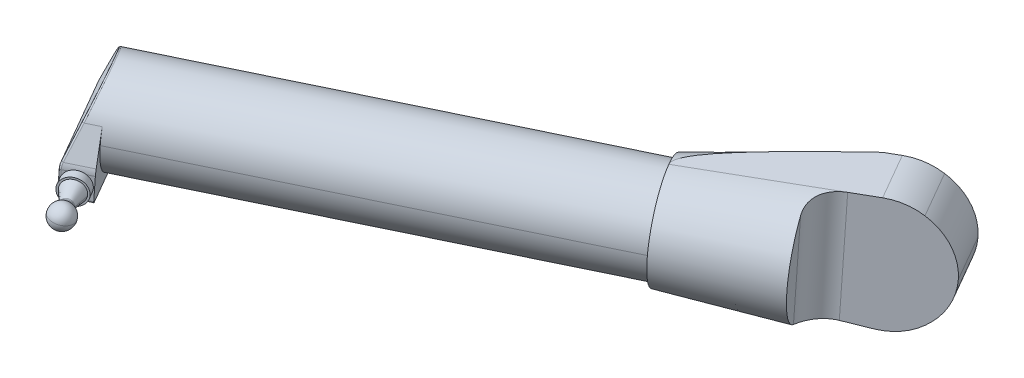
ISO-10303-21;
HEADER;
FILE_DESCRIPTION(('STEP AP214'),'2;1');
FILE_NAME('part.step','',(''),(''),'','','');
FILE_SCHEMA(('AUTOMOTIVE_DESIGN { 1 0 10303 214 1 1 1 1 }'));
ENDSEC;
DATA;
#1=APPLICATION_CONTEXT('core data for automotive mechanical design processes');
#2=APPLICATION_PROTOCOL_DEFINITION('international standard','automotive_design',2000,#1);
#3=PRODUCT_CONTEXT('',#1,'mechanical');
#4=PRODUCT('Part','Part','',(#3));
#5=PRODUCT_RELATED_PRODUCT_CATEGORY('part','',(#4));
#6=PRODUCT_DEFINITION_FORMATION('','',#4);
#7=PRODUCT_DEFINITION_CONTEXT('part definition',#1,'design');
#8=PRODUCT_DEFINITION('design','',#6,#7);
#9=PRODUCT_DEFINITION_SHAPE('','',#8);
#10=(LENGTH_UNIT() NAMED_UNIT(*) SI_UNIT(.MILLI.,.METRE.));
#11=(NAMED_UNIT(*) PLANE_ANGLE_UNIT() SI_UNIT($,.RADIAN.));
#12=(NAMED_UNIT(*) SI_UNIT($,.STERADIAN.) SOLID_ANGLE_UNIT());
#13=UNCERTAINTY_MEASURE_WITH_UNIT(LENGTH_MEASURE(1.E-05),#10,'distance_accuracy_value','');
#14=(GEOMETRIC_REPRESENTATION_CONTEXT(3) GLOBAL_UNCERTAINTY_ASSIGNED_CONTEXT((#13)) GLOBAL_UNIT_ASSIGNED_CONTEXT((#10,
#11,#12)) REPRESENTATION_CONTEXT('',''));
#15=CARTESIAN_POINT('',(0.,0.,0.));
#16=DIRECTION('',(0.,0.,1.));
#17=DIRECTION('',(1.,0.,0.));
#18=AXIS2_PLACEMENT_3D('',#15,#16,#17);
#19=CARTESIAN_POINT('',(-435.330180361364,-90.0000000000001,285.982511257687));
#20=DIRECTION('',(-0.5,0.,-0.866025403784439));
#21=DIRECTION('',(-0.848637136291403,0.199382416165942,0.489960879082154));
#22=AXIS2_PLACEMENT_3D('',#19,#20,#21);
#23=CYLINDRICAL_SURFACE('',#22,7.);
#24=CARTESIAN_POINT('',(-432.830180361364,-90.0000000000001,290.312638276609));
#25=DIRECTION('',(-0.5,0.,-0.866025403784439));
#26=DIRECTION('',(-0.848637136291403,0.199382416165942,0.489960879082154));
#27=AXIS2_PLACEMENT_3D('',#24,#25,#26);
#28=CIRCLE('',#27,7.);
#29=CARTESIAN_POINT('',(-438.770640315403,-88.6043230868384,293.742364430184));
#30=VERTEX_POINT('',#29);
#31=CARTESIAN_POINT('',(-426.889720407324,-91.3956769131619,286.882912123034));
#32=VERTEX_POINT('',#31);
#33=EDGE_CURVE('E9',#30,#32,#28,.T.);
#34=ORIENTED_EDGE('',*,*,#33,.T.);
#35=DIRECTION('',(-0.5,0.,-0.866025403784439));
#36=VECTOR('',#35,1.);
#37=CARTESIAN_POINT('',(-429.389720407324,-91.3956769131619,282.552785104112));
#38=LINE('',#37,#36);
#39=CARTESIAN_POINT('',(-429.389720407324,-91.3956769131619,282.552785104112));
#40=VERTEX_POINT('',#39);
#41=EDGE_CURVE('E26',#32,#40,#38,.T.);
#42=ORIENTED_EDGE('',*,*,#41,.T.);
#43=CARTESIAN_POINT('',(-435.330180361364,-90.0000000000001,285.982511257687));
#44=DIRECTION('',(-0.5,0.,-0.866025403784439));
#45=DIRECTION('',(-0.848637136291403,0.199382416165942,0.489960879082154));
#46=AXIS2_PLACEMENT_3D('',#43,#44,#45);
#47=CIRCLE('',#46,7.);
#48=CARTESIAN_POINT('',(-431.663114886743,-84.4259373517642,283.865330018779));
#49=VERTEX_POINT('',#48);
#50=EDGE_CURVE('E540',#49,#40,#47,.T.);
#51=ORIENTED_EDGE('',*,*,#50,.F.);
#52=CARTESIAN_POINT('',(-435.330180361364,-90.0000000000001,285.982511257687));
#53=DIRECTION('',(-0.5,0.,-0.866025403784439));
#54=DIRECTION('',(-0.848637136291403,0.199382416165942,0.489960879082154));
#55=AXIS2_PLACEMENT_3D('',#52,#53,#54);
#56=CIRCLE('',#55,7.);
#57=CARTESIAN_POINT('',(-438.448117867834,-83.9968379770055,287.782653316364));
#58=VERTEX_POINT('',#57);
#59=EDGE_CURVE('E736',#58,#49,#56,.T.);
#60=ORIENTED_EDGE('',*,*,#59,.F.);
#61=CARTESIAN_POINT('',(-435.330180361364,-90.0000000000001,285.982511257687));
#62=DIRECTION('',(-0.5,0.,-0.866025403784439));
#63=DIRECTION('',(-0.848637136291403,0.199382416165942,0.489960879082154));
#64=AXIS2_PLACEMENT_3D('',#61,#62,#63);
#65=CIRCLE('',#64,7.);
#66=CARTESIAN_POINT('',(-440.827874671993,-87.0503430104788,289.156606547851));
#67=VERTEX_POINT('',#66);
#68=EDGE_CURVE('E708',#67,#58,#65,.T.);
#69=ORIENTED_EDGE('',*,*,#68,.F.);
#70=CARTESIAN_POINT('',(-435.330180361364,-90.0000000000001,285.982511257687));
#71=DIRECTION('',(-0.5,0.,-0.866025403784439));
#72=DIRECTION('',(-0.848637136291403,0.199382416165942,0.489960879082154));
#73=AXIS2_PLACEMENT_3D('',#70,#71,#72);
#74=CIRCLE('',#73,7.);
#75=CARTESIAN_POINT('',(-441.270640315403,-88.6043230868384,289.412237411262));
#76=VERTEX_POINT('',#75);
#77=EDGE_CURVE('E484',#76,#67,#74,.T.);
#78=ORIENTED_EDGE('',*,*,#77,.F.);
#79=DIRECTION('',(-0.5,0.,-0.866025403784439));
#80=VECTOR('',#79,1.);
#81=CARTESIAN_POINT('',(-441.270640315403,-88.6043230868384,289.412237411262));
#82=LINE('',#81,#80);
#83=EDGE_CURVE('E574',#30,#76,#82,.T.);
#84=ORIENTED_EDGE('',*,*,#83,.F.);
#85=EDGE_LOOP('',(#34,#42,#51,#60,#69,#78,#84));
#86=FACE_BOUND('',#85,.T.);
#87=ADVANCED_FACE('F14',(#86),#23,.T.);
#88=CARTESIAN_POINT('',(-428.218405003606,-90.0000000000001,298.30046750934));
#89=DIRECTION('',(-0.5,0.,-0.866025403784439));
#90=DIRECTION('',(-0.848637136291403,0.199382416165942,0.489960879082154));
#91=AXIS2_PLACEMENT_3D('',#88,#89,#90);
#92=CONICAL_SURFACE('',#91,3.09252464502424,0.305363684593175);
#93=CARTESIAN_POINT('',(-428.218405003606,-90.0000000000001,298.30046750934));
#94=DIRECTION('',(-0.5,0.,-0.866025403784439));
#95=DIRECTION('',(-0.848637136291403,0.199382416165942,0.489960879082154));
#96=AXIS2_PLACEMENT_3D('',#93,#94,#95);
#97=CIRCLE('',#96,3.09252464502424);
#98=CARTESIAN_POINT('',(-430.842836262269,-89.3834049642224,299.815683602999));
#99=VERTEX_POINT('',#98);
#100=CARTESIAN_POINT('',(-425.593973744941,-90.6165950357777,296.78525141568));
#101=VERTEX_POINT('',#100);
#102=EDGE_CURVE('E618',#99,#101,#97,.T.);
#103=ORIENTED_EDGE('',*,*,#102,.T.);
#104=DIRECTION('',(-0.22173452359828,-0.0599423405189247,-0.973262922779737));
#105=VECTOR('',#104,1.);
#106=CARTESIAN_POINT('',(-425.593973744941,-90.6165950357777,296.78525141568));
#107=LINE('',#106,#105);
#108=CARTESIAN_POINT('',(-427.738357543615,-91.1962944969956,287.372873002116));
#109=VERTEX_POINT('',#108);
#110=EDGE_CURVE('E623',#101,#109,#107,.T.);
#111=ORIENTED_EDGE('',*,*,#110,.T.);
#112=CARTESIAN_POINT('',(-432.830180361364,-90.0000000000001,290.312638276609));
#113=DIRECTION('',(-0.5,0.,-0.866025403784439));
#114=DIRECTION('',(-0.848637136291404,0.199382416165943,0.489960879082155));
#115=AXIS2_PLACEMENT_3D('',#112,#113,#114);
#116=CIRCLE('',#115,6.);
#117=CARTESIAN_POINT('',(-437.922003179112,-88.8037055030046,293.252403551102));
#118=VERTEX_POINT('',#117);
#119=EDGE_CURVE('E544',#118,#109,#116,.T.);
#120=ORIENTED_EDGE('',*,*,#119,.F.);
#121=DIRECTION('',(-0.732003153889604,0.0599423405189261,-0.67865919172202));
#122=VECTOR('',#121,1.);
#123=CARTESIAN_POINT('',(-430.842836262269,-89.3834049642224,299.815683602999));
#124=LINE('',#123,#122);
#125=EDGE_CURVE('E547',#99,#118,#124,.T.);
#126=ORIENTED_EDGE('',*,*,#125,.F.);
#127=EDGE_LOOP('',(#103,#111,#120,#126));
#128=FACE_BOUND('',#127,.T.);
#129=ADVANCED_FACE('F1822',(#128),#92,.T.);
#130=CARTESIAN_POINT('',(-427.917764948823,-90.0000000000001,298.821191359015));
#131=DIRECTION('',(-0.5,0.,-0.866025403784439));
#132=DIRECTION('',(-0.848637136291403,0.199382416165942,0.489960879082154));
#133=AXIS2_PLACEMENT_3D('',#130,#131,#132);
#134=TOROIDAL_SURFACE('',#133,5.,2.);
#135=CARTESIAN_POINT('',(-428.218405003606,-90.0000000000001,298.30046750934));
#136=DIRECTION('',(-0.5,0.,-0.866025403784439));
#137=DIRECTION('',(-0.848637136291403,0.199382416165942,0.489960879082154));
#138=AXIS2_PLACEMENT_3D('',#135,#136,#137);
#139=CIRCLE('',#138,3.09252464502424);
#140=EDGE_CURVE('E554',#101,#99,#139,.T.);
#141=ORIENTED_EDGE('',*,*,#140,.F.);
#142=CARTESIAN_POINT('',(-423.674579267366,-90.9969120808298,296.371386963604));
#143=DIRECTION('',(0.172670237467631,0.979921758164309,-0.0996912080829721));
#144=DIRECTION('',(0.848637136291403,-0.199382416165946,-0.489960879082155));
#145=AXIS2_PLACEMENT_3D('',#142,#143,#144);
#146=CIRCLE('',#145,2.);
#147=CARTESIAN_POINT('',(-425.371853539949,-90.5981472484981,297.351308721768));
#148=VERTEX_POINT('',#147);
#149=EDGE_CURVE('E627',#101,#148,#146,.T.);
#150=ORIENTED_EDGE('',*,*,#149,.T.);
#151=CARTESIAN_POINT('',(-427.917764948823,-90.0000000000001,298.821191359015));
#152=DIRECTION('',(-0.5,0.,-0.866025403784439));
#153=DIRECTION('',(-0.848637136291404,0.199382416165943,0.489960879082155));
#154=AXIS2_PLACEMENT_3D('',#151,#152,#153);
#155=CIRCLE('',#154,3.);
#156=CARTESIAN_POINT('',(-430.463676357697,-89.4018527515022,300.291073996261));
#157=VERTEX_POINT('',#156);
#158=EDGE_CURVE('E726',#148,#157,#155,.T.);
#159=ORIENTED_EDGE('',*,*,#158,.T.);
#160=CARTESIAN_POINT('',(-432.16095063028,-89.0030879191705,301.270995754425));
#161=DIRECTION('',(-0.172670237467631,-0.979921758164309,0.0996912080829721));
#162=DIRECTION('',(-0.848637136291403,0.199382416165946,0.489960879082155));
#163=AXIS2_PLACEMENT_3D('',#160,#161,#162);
#164=CIRCLE('',#163,2.);
#165=EDGE_CURVE('E553',#99,#157,#164,.T.);
#166=ORIENTED_EDGE('',*,*,#165,.F.);
#167=EDGE_LOOP('',(#141,#150,#159,#166));
#168=FACE_BOUND('',#167,.T.);
#169=ADVANCED_FACE('F865',(#168),#134,.F.);
#170=CARTESIAN_POINT('',(-435.330180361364,-90.0000000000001,285.982511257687));
#171=DIRECTION('',(-0.5,0.,-0.866025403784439));
#172=DIRECTION('',(-0.848637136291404,0.199382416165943,0.489960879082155));
#173=AXIS2_PLACEMENT_3D('',#170,#171,#172);
#174=CYLINDRICAL_SURFACE('',#173,3.);
#175=CARTESIAN_POINT('',(-427.611281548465,-90.0000000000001,299.35203618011));
#176=DIRECTION('',(-0.5,0.,-0.866025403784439));
#177=DIRECTION('',(-0.848637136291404,0.199382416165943,0.489960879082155));
#178=AXIS2_PLACEMENT_3D('',#175,#176,#177);
#179=CIRCLE('',#178,3.);
#180=CARTESIAN_POINT('',(-430.157192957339,-89.4018527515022,300.821918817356));
#181=VERTEX_POINT('',#180);
#182=CARTESIAN_POINT('',(-425.065370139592,-90.5981472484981,297.882153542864));
#183=VERTEX_POINT('',#182);
#184=EDGE_CURVE('E587',#181,#183,#179,.T.);
#185=ORIENTED_EDGE('',*,*,#184,.T.);
#186=DIRECTION('',(-0.5,0.,-0.866025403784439));
#187=VECTOR('',#186,1.);
#188=CARTESIAN_POINT('',(-432.78426895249,-90.5981472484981,284.512628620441));
#189=LINE('',#188,#187);
#190=EDGE_CURVE('E584',#183,#148,#189,.T.);
#191=ORIENTED_EDGE('',*,*,#190,.T.);
#192=CARTESIAN_POINT('',(-427.917764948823,-90.0000000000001,298.821191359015));
#193=DIRECTION('',(-0.5,0.,-0.866025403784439));
#194=DIRECTION('',(-0.848637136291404,0.199382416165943,0.489960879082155));
#195=AXIS2_PLACEMENT_3D('',#192,#193,#194);
#196=CIRCLE('',#195,3.);
#197=EDGE_CURVE('E549',#157,#148,#196,.T.);
#198=ORIENTED_EDGE('',*,*,#197,.F.);
#199=DIRECTION('',(-0.5,0.,-0.866025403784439));
#200=VECTOR('',#199,1.);
#201=CARTESIAN_POINT('',(-437.876091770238,-89.4018527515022,287.452393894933));
#202=LINE('',#201,#200);
#203=EDGE_CURVE('E1213',#181,#157,#202,.T.);
#204=ORIENTED_EDGE('',*,*,#203,.F.);
#205=EDGE_LOOP('',(#185,#191,#198,#204));
#206=FACE_BOUND('',#205,.T.);
#207=ADVANCED_FACE('F1114',(#206),#174,.T.);
#208=CARTESIAN_POINT('',(-427.611281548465,-90.0000000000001,299.35203618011));
#209=DIRECTION('',(-0.5,0.,-0.866025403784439));
#210=DIRECTION('',(-0.848637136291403,0.199382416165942,0.489960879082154));
#211=AXIS2_PLACEMENT_3D('',#208,#209,#210);
#212=TOROIDAL_SURFACE('',#211,5.,2.);
#213=CARTESIAN_POINT('',(-427.611281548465,-90.0000000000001,299.35203618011));
#214=DIRECTION('',(-0.5,0.,-0.866025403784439));
#215=DIRECTION('',(-0.848637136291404,0.199382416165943,0.489960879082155));
#216=AXIS2_PLACEMENT_3D('',#213,#214,#215);
#217=CIRCLE('',#216,3.);
#218=EDGE_CURVE('E1208',#183,#181,#217,.T.);
#219=ORIENTED_EDGE('',*,*,#218,.F.);
#220=CARTESIAN_POINT('',(-423.368095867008,-90.9969120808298,296.902231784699));
#221=DIRECTION('',(0.172670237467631,0.979921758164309,-0.0996912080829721));
#222=DIRECTION('',(0.848637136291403,-0.199382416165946,-0.489960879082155));
#223=AXIS2_PLACEMENT_3D('',#220,#221,#222);
#224=CIRCLE('',#223,2.);
#225=CARTESIAN_POINT('',(-423.6013284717,-90.7552364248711,298.87382896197));
#226=VERTEX_POINT('',#225);
#227=EDGE_CURVE('E497',#183,#226,#224,.T.);
#228=ORIENTED_EDGE('',*,*,#227,.T.);
#229=CARTESIAN_POINT('',(-426.815863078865,-90.0000000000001,300.729741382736));
#230=DIRECTION('',(-0.5,0.,-0.866025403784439));
#231=DIRECTION('',(-0.848637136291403,0.199382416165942,0.489960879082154));
#232=AXIS2_PLACEMENT_3D('',#229,#230,#231);
#233=CIRCLE('',#232,3.78787878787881);
#234=CARTESIAN_POINT('',(-430.03039768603,-89.2447635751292,302.585653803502));
#235=VERTEX_POINT('',#234);
#236=EDGE_CURVE('E493',#226,#235,#233,.T.);
#237=ORIENTED_EDGE('',*,*,#236,.T.);
#238=CARTESIAN_POINT('',(-431.854467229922,-89.0030879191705,301.801840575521));
#239=DIRECTION('',(-0.172670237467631,-0.979921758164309,0.0996912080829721));
#240=DIRECTION('',(-0.848637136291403,0.199382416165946,0.489960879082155));
#241=AXIS2_PLACEMENT_3D('',#238,#239,#240);
#242=CIRCLE('',#241,2.);
#243=EDGE_CURVE('E1426',#181,#235,#242,.T.);
#244=ORIENTED_EDGE('',*,*,#243,.F.);
#245=EDGE_LOOP('',(#219,#228,#237,#244));
#246=FACE_BOUND('',#245,.T.);
#247=ADVANCED_FACE('F1900',(#246),#212,.F.);
#248=CARTESIAN_POINT('',(-424.330180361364,-90.0000000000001,305.035070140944));
#249=DIRECTION('',(-0.172670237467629,-0.97992175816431,0.099691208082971));
#250=DIRECTION('',(0.848637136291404,-0.199382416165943,-0.489960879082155));
#251=AXIS2_PLACEMENT_3D('',#248,#249,#250);
#252=SPHERICAL_SURFACE('',#251,6.25);
#253=CARTESIAN_POINT('',(-424.330180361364,-90.0000000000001,305.035070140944));
#254=DIRECTION('',(0.172670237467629,0.97992175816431,-0.099691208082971));
#255=DIRECTION('',(0.848637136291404,-0.199382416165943,-0.489960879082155));
#256=AXIS2_PLACEMENT_3D('',#253,#254,#255);
#257=CIRCLE('',#256,6.25);
#258=CARTESIAN_POINT('',(-421.205180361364,-90.0000000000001,310.447728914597));
#259=VERTEX_POINT('',#258);
#260=EDGE_CURVE('E1290',#259,#226,#257,.T.);
#261=ORIENTED_EDGE('',*,*,#260,.F.);
#262=CARTESIAN_POINT('',(-424.330180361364,-90.0000000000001,305.035070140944));
#263=DIRECTION('',(-0.172670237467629,-0.97992175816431,0.099691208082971));
#264=DIRECTION('',(-0.848637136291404,0.199382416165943,0.489960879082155));
#265=AXIS2_PLACEMENT_3D('',#262,#263,#264);
#266=CIRCLE('',#265,6.25);
#267=EDGE_CURVE('E498',#259,#235,#266,.T.);
#268=ORIENTED_EDGE('',*,*,#267,.T.);
#269=ORIENTED_EDGE('',*,*,#236,.F.);
#270=EDGE_LOOP('',(#261,#268,#269));
#271=FACE_BOUND('',#270,.T.);
#272=ADVANCED_FACE('F1733',(#271),#252,.T.);
#273=CARTESIAN_POINT('',(-465.330180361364,-90.,234.02098703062));
#274=DIRECTION('',(0.5,0.,0.866025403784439));
#275=DIRECTION('',(-0.865915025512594,0.0159653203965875,0.499936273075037));
#276=AXIS2_PLACEMENT_3D('',#273,#274,#275);
#277=CYLINDRICAL_SURFACE('',#276,7.);
#278=CARTESIAN_POINT('',(-467.830180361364,-90.,229.690860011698));
#279=DIRECTION('',(0.5,0.,0.866025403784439));
#280=DIRECTION('',(-0.865915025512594,0.0159653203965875,0.499936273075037));
#281=AXIS2_PLACEMENT_3D('',#278,#279,#280);
#282=CIRCLE('',#281,7.);
#283=CARTESIAN_POINT('',(-473.891585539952,-89.8882427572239,233.190413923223));
#284=VERTEX_POINT('',#283);
#285=CARTESIAN_POINT('',(-461.768775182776,-90.1117572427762,226.191306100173));
#286=VERTEX_POINT('',#285);
#287=EDGE_CURVE('E713',#284,#286,#282,.T.);
#288=ORIENTED_EDGE('',*,*,#287,.T.);
#289=DIRECTION('',(0.5,0.,0.866025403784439));
#290=VECTOR('',#289,1.);
#291=CARTESIAN_POINT('',(-459.268775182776,-90.1117572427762,230.521433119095));
#292=LINE('',#291,#290);
#293=CARTESIAN_POINT('',(-459.268775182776,-90.1117572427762,230.521433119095));
#294=VERTEX_POINT('',#293);
#295=EDGE_CURVE('E709',#286,#294,#292,.T.);
#296=ORIENTED_EDGE('',*,*,#295,.T.);
#297=CARTESIAN_POINT('',(-465.330180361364,-90.,234.02098703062));
#298=DIRECTION('',(0.5,0.,0.866025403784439));
#299=DIRECTION('',(-0.865915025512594,0.0159653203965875,0.499936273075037));
#300=AXIS2_PLACEMENT_3D('',#297,#298,#299);
#301=CIRCLE('',#300,7.);
#302=CARTESIAN_POINT('',(-463.391392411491,-96.632355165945,232.90162728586));
#303=VERTEX_POINT('',#302);
#304=EDGE_CURVE('E642',#303,#294,#301,.T.);
#305=ORIENTED_EDGE('',*,*,#304,.F.);
#306=CARTESIAN_POINT('',(-465.330180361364,-90.,234.02098703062));
#307=DIRECTION('',(0.5,0.,0.866025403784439));
#308=DIRECTION('',(-0.865915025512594,0.0159653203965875,0.499936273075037));
#309=AXIS2_PLACEMENT_3D('',#306,#307,#308);
#310=CIRCLE('',#309,7.);
#311=CARTESIAN_POINT('',(-467.88465824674,-96.3481905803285,235.495815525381));
#312=VERTEX_POINT('',#311);
#313=EDGE_CURVE('E630',#312,#303,#310,.T.);
#314=ORIENTED_EDGE('',*,*,#313,.F.);
#315=CARTESIAN_POINT('',(-465.330180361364,-90.,234.02098703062));
#316=DIRECTION('',(0.5,0.,0.866025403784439));
#317=DIRECTION('',(-0.865915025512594,0.0159653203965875,0.499936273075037));
#318=AXIS2_PLACEMENT_3D('',#315,#316,#317);
#319=CIRCLE('',#318,7.);
#320=CARTESIAN_POINT('',(-471.073968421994,-92.2387194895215,237.337164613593));
#321=VERTEX_POINT('',#320);
#322=EDGE_CURVE('E509',#321,#312,#319,.T.);
#323=ORIENTED_EDGE('',*,*,#322,.F.);
#324=CARTESIAN_POINT('',(-465.330180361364,-90.,234.02098703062));
#325=DIRECTION('',(0.5,0.,0.866025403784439));
#326=DIRECTION('',(-0.865915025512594,0.0159653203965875,0.499936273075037));
#327=AXIS2_PLACEMENT_3D('',#324,#325,#326);
#328=CIRCLE('',#327,7.);
#329=CARTESIAN_POINT('',(-471.391585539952,-89.8882427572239,237.520540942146));
#330=VERTEX_POINT('',#329);
#331=EDGE_CURVE('E604',#330,#321,#328,.T.);
#332=ORIENTED_EDGE('',*,*,#331,.F.);
#333=DIRECTION('',(0.5,0.,0.866025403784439));
#334=VECTOR('',#333,1.);
#335=CARTESIAN_POINT('',(-471.391585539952,-89.8882427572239,237.520540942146));
#336=LINE('',#335,#334);
#337=EDGE_CURVE('E472',#284,#330,#336,.T.);
#338=ORIENTED_EDGE('',*,*,#337,.F.);
#339=EDGE_LOOP('',(#288,#296,#305,#314,#323,#332,#338));
#340=FACE_BOUND('',#339,.T.);
#341=ADVANCED_FACE('F1730',(#340),#277,.T.);
#342=CARTESIAN_POINT('',(-472.441955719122,-90.,221.703030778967));
#343=DIRECTION('',(0.5,0.,0.866025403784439));
#344=DIRECTION('',(-0.865915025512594,0.0159653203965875,0.499936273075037));
#345=AXIS2_PLACEMENT_3D('',#342,#343,#344);
#346=CONICAL_SURFACE('',#345,3.09252464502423,0.305363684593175);
#347=CARTESIAN_POINT('',(-472.441955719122,-90.,221.703030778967));
#348=DIRECTION('',(0.5,0.,0.866025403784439));
#349=DIRECTION('',(-0.865915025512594,0.0159653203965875,0.499936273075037));
#350=AXIS2_PLACEMENT_3D('',#347,#348,#349);
#351=CIRCLE('',#350,3.09252464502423);
#352=CARTESIAN_POINT('',(-475.119819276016,-89.950626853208,223.249096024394));
#353=VERTEX_POINT('',#352);
#354=CARTESIAN_POINT('',(-469.764092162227,-90.0493731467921,220.156965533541));
#355=VERTEX_POINT('',#354);
#356=EDGE_CURVE('E714',#353,#355,#351,.T.);
#357=ORIENTED_EDGE('',*,*,#356,.T.);
#358=DIRECTION('',(0.7371975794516,-0.00479981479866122,0.675660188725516));
#359=VECTOR('',#358,1.);
#360=CARTESIAN_POINT('',(-469.764092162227,-90.0493731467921,220.156965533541));
#361=LINE('',#360,#359);
#362=CARTESIAN_POINT('',(-462.634690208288,-90.0957919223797,226.691242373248));
#363=VERTEX_POINT('',#362);
#364=EDGE_CURVE('E449',#355,#363,#361,.T.);
#365=ORIENTED_EDGE('',*,*,#364,.T.);
#366=CARTESIAN_POINT('',(-467.830180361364,-90.,229.690860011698));
#367=DIRECTION('',(0.5,0.,0.866025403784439));
#368=DIRECTION('',(-0.865915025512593,0.0159653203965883,0.499936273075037));
#369=AXIS2_PLACEMENT_3D('',#366,#367,#368);
#370=CIRCLE('',#369,6.);
#371=CARTESIAN_POINT('',(-473.025670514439,-89.9042080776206,232.690477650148));
#372=VERTEX_POINT('',#371);
#373=EDGE_CURVE('E442',#372,#363,#370,.T.);
#374=ORIENTED_EDGE('',*,*,#373,.F.);
#375=DIRECTION('',(0.216540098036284,0.00479981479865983,0.976261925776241));
#376=VECTOR('',#375,1.);
#377=CARTESIAN_POINT('',(-475.119819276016,-89.950626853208,223.249096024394));
#378=LINE('',#377,#376);
#379=EDGE_CURVE('E446',#353,#372,#378,.T.);
#380=ORIENTED_EDGE('',*,*,#379,.F.);
#381=EDGE_LOOP('',(#357,#365,#374,#380));
#382=FACE_BOUND('',#381,.T.);
#383=ADVANCED_FACE('F445',(#382),#346,.T.);
#384=CARTESIAN_POINT('',(-472.742595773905,-90.,221.182306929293));
#385=DIRECTION('',(0.5,0.,0.866025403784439));
#386=DIRECTION('',(-0.865915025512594,0.0159653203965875,0.499936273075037));
#387=AXIS2_PLACEMENT_3D('',#384,#385,#386);
#388=TOROIDAL_SURFACE('',#387,5.,2.);
#389=CARTESIAN_POINT('',(-472.441955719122,-90.,221.703030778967));
#390=DIRECTION('',(0.5,0.,0.866025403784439));
#391=DIRECTION('',(-0.865915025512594,0.0159653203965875,0.499936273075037));
#392=AXIS2_PLACEMENT_3D('',#389,#390,#391);
#393=CIRCLE('',#392,3.09252464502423);
#394=EDGE_CURVE('E458',#355,#353,#393,.T.);
#395=ORIENTED_EDGE('',*,*,#394,.F.);
#396=CARTESIAN_POINT('',(-468.413020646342,-90.0798266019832,218.682625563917));
#397=DIRECTION('',(-0.013826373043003,-0.999872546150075,0.00798266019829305));
#398=DIRECTION('',(-0.865915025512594,0.0159653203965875,0.499936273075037));
#399=AXIS2_PLACEMENT_3D('',#396,#397,#398);
#400=CIRCLE('',#399,2.);
#401=CARTESIAN_POINT('',(-470.144850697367,-90.0478959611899,219.682498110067));
#402=VERTEX_POINT('',#401);
#403=EDGE_CURVE('E720',#355,#402,#400,.T.);
#404=ORIENTED_EDGE('',*,*,#403,.T.);
#405=CARTESIAN_POINT('',(-472.742595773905,-90.,221.182306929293));
#406=DIRECTION('',(0.5,0.,0.866025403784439));
#407=DIRECTION('',(-0.865915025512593,0.0159653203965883,0.499936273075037));
#408=AXIS2_PLACEMENT_3D('',#405,#406,#407);
#409=CIRCLE('',#408,3.);
#410=CARTESIAN_POINT('',(-475.340340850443,-89.9521040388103,222.682115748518));
#411=VERTEX_POINT('',#410);
#412=EDGE_CURVE('E694',#402,#411,#409,.T.);
#413=ORIENTED_EDGE('',*,*,#412,.T.);
#414=CARTESIAN_POINT('',(-477.072170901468,-89.9201733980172,223.681988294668));
#415=DIRECTION('',(0.013826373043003,0.999872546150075,-0.00798266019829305));
#416=DIRECTION('',(0.865915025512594,-0.0159653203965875,-0.499936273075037));
#417=AXIS2_PLACEMENT_3D('',#414,#415,#416);
#418=CIRCLE('',#417,2.);
#419=EDGE_CURVE('E699',#353,#411,#418,.T.);
#420=ORIENTED_EDGE('',*,*,#419,.F.);
#421=EDGE_LOOP('',(#395,#404,#413,#420));
#422=FACE_BOUND('',#421,.T.);
#423=ADVANCED_FACE('F1935',(#422),#388,.F.);
#424=CARTESIAN_POINT('',(-465.330180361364,-90.,234.02098703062));
#425=DIRECTION('',(0.5,0.,0.866025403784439));
#426=DIRECTION('',(-0.865915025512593,0.0159653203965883,0.499936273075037));
#427=AXIS2_PLACEMENT_3D('',#424,#425,#426);
#428=CYLINDRICAL_SURFACE('',#427,3.);
#429=CARTESIAN_POINT('',(-473.049079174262,-90.,220.651462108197));
#430=DIRECTION('',(0.5,0.,0.866025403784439));
#431=DIRECTION('',(-0.865915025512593,0.0159653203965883,0.499936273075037));
#432=AXIS2_PLACEMENT_3D('',#429,#430,#431);
#433=CIRCLE('',#432,3.);
#434=CARTESIAN_POINT('',(-475.6468242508,-89.9521040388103,222.151270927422));
#435=VERTEX_POINT('',#434);
#436=CARTESIAN_POINT('',(-470.451334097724,-90.0478959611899,219.151653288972));
#437=VERTEX_POINT('',#436);
#438=EDGE_CURVE('E690',#435,#437,#433,.T.);
#439=ORIENTED_EDGE('',*,*,#438,.T.);
#440=DIRECTION('',(0.5,0.,0.866025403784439));
#441=VECTOR('',#440,1.);
#442=CARTESIAN_POINT('',(-462.732435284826,-90.0478959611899,232.521178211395));
#443=LINE('',#442,#441);
#444=EDGE_CURVE('E695',#437,#402,#443,.T.);
#445=ORIENTED_EDGE('',*,*,#444,.T.);
#446=CARTESIAN_POINT('',(-472.742595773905,-90.,221.182306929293));
#447=DIRECTION('',(0.5,0.,0.866025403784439));
#448=DIRECTION('',(-0.865915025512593,0.0159653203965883,0.499936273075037));
#449=AXIS2_PLACEMENT_3D('',#446,#447,#448);
#450=CIRCLE('',#449,3.);
#451=EDGE_CURVE('E703',#411,#402,#450,.T.);
#452=ORIENTED_EDGE('',*,*,#451,.F.);
#453=DIRECTION('',(0.5,0.,0.866025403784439));
#454=VECTOR('',#453,1.);
#455=CARTESIAN_POINT('',(-467.927925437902,-89.9521040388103,235.520795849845));
#456=LINE('',#455,#454);
#457=EDGE_CURVE('E653',#435,#411,#456,.T.);
#458=ORIENTED_EDGE('',*,*,#457,.F.);
#459=EDGE_LOOP('',(#439,#445,#452,#458));
#460=FACE_BOUND('',#459,.T.);
#461=ADVANCED_FACE('F2678',(#460),#428,.T.);
#462=CARTESIAN_POINT('',(-473.049079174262,-90.,220.651462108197));
#463=DIRECTION('',(0.5,0.,0.866025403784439));
#464=DIRECTION('',(-0.865915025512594,0.0159653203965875,0.499936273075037));
#465=AXIS2_PLACEMENT_3D('',#462,#463,#464);
#466=TOROIDAL_SURFACE('',#465,5.,2.);
#467=CARTESIAN_POINT('',(-473.049079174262,-90.,220.651462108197));
#468=DIRECTION('',(0.5,0.,0.866025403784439));
#469=DIRECTION('',(-0.865915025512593,0.0159653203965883,0.499936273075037));
#470=AXIS2_PLACEMENT_3D('',#467,#468,#469);
#471=CIRCLE('',#470,3.);
#472=EDGE_CURVE('E648',#437,#435,#471,.T.);
#473=ORIENTED_EDGE('',*,*,#472,.F.);
#474=CARTESIAN_POINT('',(-468.719504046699,-90.0798266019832,218.151780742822));
#475=DIRECTION('',(-0.013826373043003,-0.999872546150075,0.00798266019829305));
#476=DIRECTION('',(-0.865915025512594,0.0159653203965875,0.499936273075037));
#477=AXIS2_PLACEMENT_3D('',#474,#475,#476);
#478=CIRCLE('',#477,2.);
#479=CARTESIAN_POINT('',(-470.564516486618,-90.0604746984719,217.380058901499));
#480=VERTEX_POINT('',#479);
#481=EDGE_CURVE('E609',#437,#480,#478,.T.);
#482=ORIENTED_EDGE('',*,*,#481,.T.);
#483=CARTESIAN_POINT('',(-473.844497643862,-90.,219.273756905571));
#484=DIRECTION('',(0.5,0.,0.866025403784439));
#485=DIRECTION('',(-0.865915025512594,0.0159653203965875,0.499936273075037));
#486=AXIS2_PLACEMENT_3D('',#483,#484,#485);
#487=CIRCLE('',#486,3.78787878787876);
#488=CARTESIAN_POINT('',(-477.124478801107,-89.9395253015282,221.167454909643));
#489=VERTEX_POINT('',#488);
#490=EDGE_CURVE('E605',#480,#489,#487,.T.);
#491=ORIENTED_EDGE('',*,*,#490,.T.);
#492=CARTESIAN_POINT('',(-477.378654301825,-89.9201733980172,223.151143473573));
#493=DIRECTION('',(0.013826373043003,0.999872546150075,-0.00798266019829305));
#494=DIRECTION('',(0.865915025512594,-0.0159653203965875,-0.499936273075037));
#495=AXIS2_PLACEMENT_3D('',#492,#493,#494);
#496=CIRCLE('',#495,2.);
#497=EDGE_CURVE('E476',#435,#489,#496,.T.);
#498=ORIENTED_EDGE('',*,*,#497,.F.);
#499=EDGE_LOOP('',(#473,#482,#491,#498));
#500=FACE_BOUND('',#499,.T.);
#501=ADVANCED_FACE('F2665',(#500),#466,.F.);
#502=CARTESIAN_POINT('',(-476.330180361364,-90.,214.968428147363));
#503=DIRECTION('',(0.013826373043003,0.999872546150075,-0.00798266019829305));
#504=DIRECTION('',(0.865915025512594,-0.0159653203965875,-0.499936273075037));
#505=AXIS2_PLACEMENT_3D('',#502,#503,#504);
#506=SPHERICAL_SURFACE('',#505,6.25);
#507=CARTESIAN_POINT('',(-476.330180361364,-90.,214.968428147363));
#508=DIRECTION('',(-0.013826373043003,-0.999872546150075,0.00798266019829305));
#509=DIRECTION('',(-0.865915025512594,0.0159653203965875,0.499936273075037));
#510=AXIS2_PLACEMENT_3D('',#507,#508,#509);
#511=CIRCLE('',#510,6.25);
#512=CARTESIAN_POINT('',(-479.455180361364,-90.,209.55576937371));
#513=VERTEX_POINT('',#512);
#514=EDGE_CURVE('E489',#513,#480,#511,.T.);
#515=ORIENTED_EDGE('',*,*,#514,.F.);
#516=CARTESIAN_POINT('',(-476.330180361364,-90.,214.968428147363));
#517=DIRECTION('',(0.0138263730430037,0.999872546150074,-0.00798266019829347));
#518=DIRECTION('',(0.865915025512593,-0.0159653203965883,-0.499936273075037));
#519=AXIS2_PLACEMENT_3D('',#516,#517,#518);
#520=CIRCLE('',#519,6.25);
#521=EDGE_CURVE('E521',#513,#489,#520,.T.);
#522=ORIENTED_EDGE('',*,*,#521,.T.);
#523=ORIENTED_EDGE('',*,*,#490,.F.);
#524=EDGE_LOOP('',(#515,#522,#523));
#525=FACE_BOUND('',#524,.T.);
#526=ADVANCED_FACE('F2653',(#525),#506,.T.);
#527=CARTESIAN_POINT('',(-190.202051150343,-90.000000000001,70.5568854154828));
#528=DIRECTION('',(0.5,0.,0.866025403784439));
#529=DIRECTION('',(0.0473607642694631,0.998503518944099,-0.0273437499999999));
#530=AXIS2_PLACEMENT_3D('',#527,#528,#529);
#531=CYLINDRICAL_SURFACE('',#530,15.75);
#532=CARTESIAN_POINT('',(-188.202051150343,-90.000000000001,74.0209870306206));
#533=DIRECTION('',(-0.5,0.,-0.866025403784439));
#534=DIRECTION('',(0.047360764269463,0.998503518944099,-0.0273437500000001));
#535=AXIS2_PLACEMENT_3D('',#532,#533,#534);
#536=CIRCLE('',#535,15.75);
#537=CARTESIAN_POINT('',(-187.456119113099,-74.2735695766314,73.5903229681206));
#538=VERTEX_POINT('',#537);
#539=EDGE_CURVE('E517',#538,#538,#536,.T.);
#540=ORIENTED_EDGE('',*,*,#539,.T.);
#541=EDGE_LOOP('',(#540));
#542=FACE_BOUND('',#541,.T.);
#543=CARTESIAN_POINT('',(-193.202051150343,-90.000000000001,65.3607329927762));
#544=DIRECTION('',(-0.5,0.,-0.866025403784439));
#545=DIRECTION('',(-0.301014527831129,0.937649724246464,0.173790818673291));
#546=AXIS2_PLACEMENT_3D('',#543,#544,#545);
#547=CIRCLE('',#546,15.75);
#548=CARTESIAN_POINT('',(-197.943029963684,-75.2320168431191,68.0979383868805));
#549=VERTEX_POINT('',#548);
#550=EDGE_CURVE('E1609',#549,#549,#547,.T.);
#551=ORIENTED_EDGE('',*,*,#550,.F.);
#552=EDGE_LOOP('',(#551));
#553=FACE_BOUND('',#552,.T.);
#554=ADVANCED_FACE('F1050',(#542,#553),#531,.T.);
#555=CARTESIAN_POINT('',(-156.952051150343,-90.000000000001,128.147574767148));
#556=DIRECTION('',(-0.5,0.,-0.866025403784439));
#557=DIRECTION('',(0.864729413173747,-0.0546875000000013,-0.499251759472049));
#558=AXIS2_PLACEMENT_3D('',#555,#556,#557);
#559=CYLINDRICAL_SURFACE('',#558,32.5);
#560=CARTESIAN_POINT('',(-173.202051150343,-90.000000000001,100.001749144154));
#561=DIRECTION('',(0.5,0.,0.866025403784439));
#562=DIRECTION('',(0.864729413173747,-0.0546875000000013,-0.499251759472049));
#563=AXIS2_PLACEMENT_3D('',#560,#561,#562);
#564=CIRCLE('',#563,32.5);
#565=CARTESIAN_POINT('',(-145.098345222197,-91.7773437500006,83.7760669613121));
#566=VERTEX_POINT('',#565);
#567=CARTESIAN_POINT('',(-156.905402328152,-63.5020318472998,90.5928745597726));
#568=VERTEX_POINT('',#567);
#569=EDGE_CURVE('E1465',#566,#568,#564,.T.);
#570=ORIENTED_EDGE('',*,*,#569,.F.);
#571=DIRECTION('',(-0.5,0.,-0.866025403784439));
#572=VECTOR('',#571,1.);
#573=CARTESIAN_POINT('',(-128.848345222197,-91.7773437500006,111.921892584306));
#574=LINE('',#573,#572);
#575=CARTESIAN_POINT('',(-160.098345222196,-91.7773437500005,57.7953048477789));
#576=VERTEX_POINT('',#575);
#577=EDGE_CURVE('E522',#566,#576,#574,.T.);
#578=ORIENTED_EDGE('',*,*,#577,.T.);
#579=CARTESIAN_POINT('',(-188.202051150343,-90.000000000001,74.0209870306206));
#580=DIRECTION('',(0.5,0.,0.866025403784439));
#581=DIRECTION('',(0.864729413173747,-0.0546875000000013,-0.499251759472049));
#582=AXIS2_PLACEMENT_3D('',#579,#580,#581);
#583=CIRCLE('',#582,32.5);
#584=CARTESIAN_POINT('',(-171.905402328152,-63.5020318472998,64.6121124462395));
#585=VERTEX_POINT('',#584);
#586=EDGE_CURVE('E583',#576,#585,#583,.T.);
#587=ORIENTED_EDGE('',*,*,#586,.T.);
#588=DIRECTION('',(0.5,0.,0.866025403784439));
#589=VECTOR('',#588,1.);
#590=CARTESIAN_POINT('',(-140.655402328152,-63.5020318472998,118.738700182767));
#591=LINE('',#590,#589);
#592=EDGE_CURVE('E588',#585,#568,#591,.T.);
#593=ORIENTED_EDGE('',*,*,#592,.T.);
#594=EDGE_LOOP('',(#570,#578,#587,#593));
#595=FACE_BOUND('',#594,.T.);
#596=ADVANCED_FACE('F1938',(#595),#559,.T.);
#597=CARTESIAN_POINT('',(-432509.804932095,27251.9726562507,249709.655802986));
#598=DIRECTION('',(0.864729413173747,-0.0546875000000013,-0.499251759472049));
#599=DIRECTION('',(0.5,0.,0.866025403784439));
#600=AXIS2_PLACEMENT_3D('',#597,#598,#599);
#601=CYLINDRICAL_SURFACE('',#600,25.);
#602=CARTESIAN_POINT('',(-443.015896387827,-72.9363446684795,255.778845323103));
#603=DIRECTION('',(-0.864729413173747,0.0546875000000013,0.499251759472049));
#604=DIRECTION('',(-0.5,0.,-0.866025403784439));
#605=AXIS2_PLACEMENT_3D('',#602,#603,#604);
#606=CIRCLE('',#605,25.);
#607=CARTESIAN_POINT('',(-455.515896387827,-72.9363446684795,234.128210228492));
#608=VERTEX_POINT('',#607);
#609=CARTESIAN_POINT('',(-444.199915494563,-97.8989326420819,256.462439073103));
#610=VERTEX_POINT('',#609);
#611=EDGE_CURVE('E638',#608,#610,#606,.T.);
#612=ORIENTED_EDGE('',*,*,#611,.F.);
#613=DIRECTION('',(0.864729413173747,-0.0546875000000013,-0.499251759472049));
#614=VECTOR('',#613,1.);
#615=CARTESIAN_POINT('',(-432522.304932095,27251.9726562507,249688.005167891));
#616=LINE('',#615,#614);
#617=CARTESIAN_POINT('',(-261.365874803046,-85.2148437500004,122.035643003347));
#618=VERTEX_POINT('',#617);
#619=EDGE_CURVE('E592',#608,#618,#616,.T.);
#620=ORIENTED_EDGE('',*,*,#619,.T.);
#621=CARTESIAN_POINT('',(-248.865874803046,-85.2148437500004,143.686278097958));
#622=DIRECTION('',(-0.864729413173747,0.0546875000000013,0.499251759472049));
#623=DIRECTION('',(-0.5,0.,-0.866025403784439));
#624=AXIS2_PLACEMENT_3D('',#621,#622,#623);
#625=CIRCLE('',#624,25.);
#626=CARTESIAN_POINT('',(-236.365874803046,-85.2148437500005,165.336913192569));
#627=VERTEX_POINT('',#626);
#628=EDGE_CURVE('E634',#618,#627,#625,.T.);
#629=ORIENTED_EDGE('',*,*,#628,.T.);
#630=DIRECTION('',(0.864729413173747,-0.0546875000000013,-0.499251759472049));
#631=VECTOR('',#630,1.);
#632=CARTESIAN_POINT('',(-432497.304932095,27251.9726562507,249731.30643808));
#633=LINE('',#632,#631);
#634=CARTESIAN_POINT('',(-430.515896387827,-72.9363446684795,277.429480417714));
#635=VERTEX_POINT('',#634);
#636=EDGE_CURVE('E747',#635,#627,#633,.T.);
#637=ORIENTED_EDGE('',*,*,#636,.F.);
#638=CARTESIAN_POINT('',(-443.015896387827,-72.9363446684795,255.778845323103));
#639=DIRECTION('',(-0.864729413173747,0.0546875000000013,0.499251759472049));
#640=DIRECTION('',(-0.5,0.,-0.866025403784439));
#641=AXIS2_PLACEMENT_3D('',#638,#639,#640);
#642=CIRCLE('',#641,25.);
#643=EDGE_CURVE('E1418',#610,#635,#642,.T.);
#644=ORIENTED_EDGE('',*,*,#643,.F.);
#645=EDGE_LOOP('',(#612,#620,#629,#637,#644));
#646=FACE_BOUND('',#645,.T.);
#647=ADVANCED_FACE('F790',(#646),#601,.T.);
#648=CARTESIAN_POINT('',(-432509.804932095,27251.9726562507,249709.655802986));
#649=DIRECTION('',(0.864729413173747,-0.0546875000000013,-0.499251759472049));
#650=DIRECTION('',(0.5,0.,0.866025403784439));
#651=AXIS2_PLACEMENT_3D('',#648,#649,#650);
#652=CYLINDRICAL_SURFACE('',#651,25.);
#653=ORIENTED_EDGE('',*,*,#619,.F.);
#654=CARTESIAN_POINT('',(-443.015896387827,-72.9363446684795,255.778845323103));
#655=DIRECTION('',(-0.864729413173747,0.0546875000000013,0.499251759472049));
#656=DIRECTION('',(-0.5,0.,-0.866025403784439));
#657=AXIS2_PLACEMENT_3D('',#654,#655,#656);
#658=CIRCLE('',#657,25.);
#659=CARTESIAN_POINT('',(-454.419662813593,-64.6750385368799,235.122007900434));
#660=VERTEX_POINT('',#659);
#661=EDGE_CURVE('E644',#660,#608,#658,.T.);
#662=ORIENTED_EDGE('',*,*,#661,.F.);
#663=DIRECTION('',(-0.864729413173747,0.0546875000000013,0.499251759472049));
#664=VECTOR('',#663,1.);
#665=CARTESIAN_POINT('',(-454.419662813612,-64.6750385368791,235.122007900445));
#666=LINE('',#665,#664);
#667=CARTESIAN_POINT('',(-460.823156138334,-64.2700667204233,238.819066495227));
#668=VERTEX_POINT('',#667);
#669=EDGE_CURVE('E1323',#660,#668,#666,.T.);
#670=ORIENTED_EDGE('',*,*,#669,.T.);
#671=CARTESIAN_POINT('',(-437.231926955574,-64.2700667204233,279.680274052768));
#672=CARTESIAN_POINT('',(-436.809579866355,-61.8948726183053,278.454324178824));
#673=CARTESIAN_POINT('',(-436.621972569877,-59.6498706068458,276.929088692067));
#674=CARTESIAN_POINT('',(-436.733616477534,-55.629550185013,273.422435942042));
#675=CARTESIAN_POINT('',(-437.032886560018,-53.8550353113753,271.441648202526));
#676=CARTESIAN_POINT('',(-438.090264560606,-50.943667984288,267.210861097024));
#677=CARTESIAN_POINT('',(-438.848213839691,-49.8072523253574,264.961496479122));
#678=CARTESIAN_POINT('',(-440.751570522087,-48.2795030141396,260.405716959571));
#679=CARTESIAN_POINT('',(-441.896692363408,-47.888398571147,258.09998556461));
#680=CARTESIAN_POINT('',(-444.466460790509,-47.888398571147,253.649016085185));
#681=CARTESIAN_POINT('',(-445.890721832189,-48.2795030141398,251.504445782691));
#682=CARTESIAN_POINT('',(-448.884464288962,-49.8072523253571,247.578200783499));
#683=CARTESIAN_POINT('',(-450.453496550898,-50.9436679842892,245.797115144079));
#684=CARTESIAN_POINT('',(-453.58877666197,-53.8550353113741,242.766005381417));
#685=CARTESIAN_POINT('',(-455.154554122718,-55.6295501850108,241.51643601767));
#686=CARTESIAN_POINT('',(-458.135582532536,-59.6498706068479,239.666423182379));
#687=CARTESIAN_POINT('',(-459.550278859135,-61.8948726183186,239.066278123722));
#688=CARTESIAN_POINT('',(-460.823156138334,-64.2700667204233,238.819066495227));
#689=(BOUNDED_CURVE() B_SPLINE_CURVE(3,(#671,#672,#673,#674,#675,#676,#677,#678,#679,#680,#681,
#682,#683,#684,#685,#686,#687,#688),.UNSPECIFIED.,.F.,.F.) B_SPLINE_CURVE_WITH_KNOTS((4,2,2,2,2,
2,2,2,4),(1.90810380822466,2.21647601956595,2.52484823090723,2.83322044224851,3.14159265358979,
3.44996486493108,3.75833707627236,4.06670928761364,4.37508149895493),
.UNSPECIFIED.) CURVE() GEOMETRIC_REPRESENTATION_ITEM() RATIONAL_B_SPLINE_CURVE((1.,1.,1.,1.,1.,
1.,1.,1.,1.,1.,1.,1.,1.,1.,1.,1.,1.,1.)) REPRESENTATION_ITEM(''));
#690=CARTESIAN_POINT('',(-437.231926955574,-64.2700667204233,279.680274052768));
#691=VERTEX_POINT('',#690);
#692=EDGE_CURVE('E750',#668,#691,#689,.F.);
#693=ORIENTED_EDGE('',*,*,#692,.T.);
#694=DIRECTION('',(-0.864729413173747,0.0546875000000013,0.499251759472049));
#695=VECTOR('',#694,1.);
#696=CARTESIAN_POINT('',(-430.828433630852,-64.6750385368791,275.983215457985));
#697=LINE('',#696,#695);
#698=CARTESIAN_POINT('',(-430.828433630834,-64.67503853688,275.983215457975));
#699=VERTEX_POINT('',#698);
#700=EDGE_CURVE('E671',#699,#691,#697,.T.);
#701=ORIENTED_EDGE('',*,*,#700,.F.);
#702=CARTESIAN_POINT('',(-443.015896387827,-72.9363446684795,255.778845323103));
#703=DIRECTION('',(-0.864729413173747,0.0546875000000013,0.499251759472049));
#704=DIRECTION('',(-0.5,0.,-0.866025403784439));
#705=AXIS2_PLACEMENT_3D('',#702,#703,#704);
#706=CIRCLE('',#705,25.);
#707=EDGE_CURVE('E1304',#635,#699,#706,.T.);
#708=ORIENTED_EDGE('',*,*,#707,.F.);
#709=ORIENTED_EDGE('',*,*,#636,.T.);
#710=CARTESIAN_POINT('',(-248.865874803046,-85.2148437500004,143.686278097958));
#711=DIRECTION('',(-0.864729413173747,0.0546875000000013,0.499251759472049));
#712=DIRECTION('',(-0.5,0.,-0.866025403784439));
#713=AXIS2_PLACEMENT_3D('',#710,#711,#712);
#714=CIRCLE('',#713,25.);
#715=EDGE_CURVE('E751',#627,#618,#714,.T.);
#716=ORIENTED_EDGE('',*,*,#715,.T.);
#717=EDGE_LOOP('',(#653,#662,#670,#693,#701,#708,#709,#716));
#718=FACE_BOUND('',#717,.T.);
#719=ADVANCED_FACE('F779',(#718),#652,.T.);
#720=CARTESIAN_POINT('',(-248.865874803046,-85.2148437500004,143.686278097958));
#721=DIRECTION('',(-0.864729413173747,0.0546875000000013,0.499251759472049));
#722=DIRECTION('',(-0.5,0.,-0.866025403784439));
#723=AXIS2_PLACEMENT_3D('',#720,#721,#722);
#724=PLANE('',#723);
#725=CARTESIAN_POINT('',(-248.865874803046,-85.2148437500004,143.686278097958));
#726=DIRECTION('',(0.864729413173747,-0.0546875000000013,-0.499251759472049));
#727=DIRECTION('',(0.5,0.,0.866025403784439));
#728=AXIS2_PLACEMENT_3D('',#725,#726,#727);
#729=CIRCLE('',#728,27.5);
#730=CARTESIAN_POINT('',(-250.168295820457,-112.673690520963,144.438231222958));
#731=VERTEX_POINT('',#730);
#732=CARTESIAN_POINT('',(-247.563453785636,-57.7559969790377,142.934324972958));
#733=VERTEX_POINT('',#732);
#734=EDGE_CURVE('E1353',#731,#733,#729,.T.);
#735=ORIENTED_EDGE('',*,*,#734,.F.);
#736=CARTESIAN_POINT('',(-248.865874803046,-85.2148437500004,143.686278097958));
#737=DIRECTION('',(0.864729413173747,-0.0546875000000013,-0.499251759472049));
#738=DIRECTION('',(0.5,0.,0.866025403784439));
#739=AXIS2_PLACEMENT_3D('',#736,#737,#738);
#740=CIRCLE('',#739,27.5);
#741=EDGE_CURVE('E893',#733,#731,#740,.T.);
#742=ORIENTED_EDGE('',*,*,#741,.F.);
#743=EDGE_LOOP('',(#735,#742));
#744=FACE_BOUND('',#743,.T.);
#745=ORIENTED_EDGE('',*,*,#715,.F.);
#746=ORIENTED_EDGE('',*,*,#628,.F.);
#747=EDGE_LOOP('',(#745,#746));
#748=FACE_BOUND('',#747,.T.);
#749=ADVANCED_FACE('F789',(#744,#748),#724,.T.);
#750=CARTESIAN_POINT('',(-189.672344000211,-55.9353543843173,126.831385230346));
#751=DIRECTION('',(-0.864729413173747,0.0546875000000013,0.499251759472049));
#752=DIRECTION('',(-0.499999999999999,0.,-0.866025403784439));
#753=AXIS2_PLACEMENT_3D('',#750,#751,#752);
#754=PLANE('',#753);
#755=DIRECTION('',(-0.0473607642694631,-0.998503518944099,0.0273437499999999));
#756=VECTOR('',#755,1.);
#757=CARTESIAN_POINT('',(-189.672344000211,-55.9353543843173,126.831385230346));
#758=LINE('',#757,#756);
#759=CARTESIAN_POINT('',(-189.951674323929,-61.8244551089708,126.992656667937));
#760=VERTEX_POINT('',#759);
#761=CARTESIAN_POINT('',(-192.471463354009,-114.94898239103,128.447457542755));
#762=VERTEX_POINT('',#761);
#763=EDGE_CURVE('E896',#760,#762,#758,.T.);
#764=ORIENTED_EDGE('',*,*,#763,.F.);
#765=CARTESIAN_POINT('',(-198.711568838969,-88.3867187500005,114.729676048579));
#766=DIRECTION('',(0.864729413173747,-0.0546875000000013,-0.499251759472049));
#767=DIRECTION('',(-0.499999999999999,0.,-0.866025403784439));
#768=AXIS2_PLACEMENT_3D('',#765,#766,#767);
#769=CIRCLE('',#768,30.5396511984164);
#770=EDGE_CURVE('E901',#760,#762,#769,.T.);
#771=ORIENTED_EDGE('',*,*,#770,.T.);
#772=EDGE_LOOP('',(#764,#771));
#773=FACE_BOUND('',#772,.T.);
#774=ADVANCED_FACE('F1768',(#773),#754,.F.);
#775=CARTESIAN_POINT('',(-265.405099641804,-117.666208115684,118.594187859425));
#776=DIRECTION('',(0.5,0.,0.866025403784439));
#777=DIRECTION('',(-0.047360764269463,-0.998503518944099,0.0273437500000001));
#778=AXIS2_PLACEMENT_3D('',#775,#776,#777);
#779=PLANE('',#778);
#780=DIRECTION('',(0.866023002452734,-0.00235491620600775,-0.499998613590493));
#781=VECTOR('',#780,1.);
#782=CARTESIAN_POINT('',(-265.282902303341,-57.7486021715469,118.523637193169));
#783=LINE('',#782,#781);
#784=CARTESIAN_POINT('',(-193.902184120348,-57.9427028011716,77.3119603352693));
#785=VERTEX_POINT('',#784);
#786=CARTESIAN_POINT('',(-186.88728026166,-57.9617779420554,73.2619037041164));
#787=VERTEX_POINT('',#786);
#788=EDGE_CURVE('E904',#785,#787,#783,.T.);
#789=ORIENTED_EDGE('',*,*,#788,.T.);
#790=CARTESIAN_POINT('',(-186.948462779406,-87.9616947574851,73.2972274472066));
#791=DIRECTION('',(-0.5,0.,-0.866025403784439));
#792=DIRECTION('',(0.047360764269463,0.998503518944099,-0.0273437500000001));
#793=AXIS2_PLACEMENT_3D('',#790,#791,#792);
#794=CIRCLE('',#793,30.);
#795=EDGE_CURVE('E914',#787,#585,#794,.T.);
#796=ORIENTED_EDGE('',*,*,#795,.T.);
#797=ORIENTED_EDGE('',*,*,#586,.F.);
#798=CARTESIAN_POINT('',(-188.202051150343,-90.000000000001,74.0209870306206));
#799=DIRECTION('',(0.5,0.,0.866025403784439));
#800=DIRECTION('',(0.864729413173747,-0.0546875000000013,-0.499251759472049));
#801=AXIS2_PLACEMENT_3D('',#798,#799,#800);
#802=CIRCLE('',#801,32.5);
#803=CARTESIAN_POINT('',(-174.509051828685,-118.394583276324,66.1153301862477));
#804=VERTEX_POINT('',#803);
#805=EDGE_CURVE('E892',#804,#576,#802,.T.);
#806=ORIENTED_EDGE('',*,*,#805,.F.);
#807=CARTESIAN_POINT('',(-187.148743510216,-92.1841987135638,73.4128595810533));
#808=DIRECTION('',(-0.5,0.,-0.866025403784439));
#809=DIRECTION('',(0.0473607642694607,0.998503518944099,-0.0273437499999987));
#810=AXIS2_PLACEMENT_3D('',#807,#808,#809);
#811=CIRCLE('',#810,30.);
#812=CARTESIAN_POINT('',(-189.925312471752,-122.012388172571,75.0159124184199));
#813=VERTEX_POINT('',#812);
#814=EDGE_CURVE('E923',#804,#813,#811,.T.);
#815=ORIENTED_EDGE('',*,*,#814,.T.);
#816=DIRECTION('',(-0.861065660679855,0.106870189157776,0.497136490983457));
#817=VECTOR('',#816,1.);
#818=CARTESIAN_POINT('',(-264.942972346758,-112.70165628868,118.32737854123));
#819=LINE('',#818,#817);
#820=CARTESIAN_POINT('',(-196.900061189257,-121.146725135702,79.0427854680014));
#821=VERTEX_POINT('',#820);
#822=EDGE_CURVE('E932',#813,#821,#819,.T.);
#823=ORIENTED_EDGE('',*,*,#822,.T.);
#824=CARTESIAN_POINT('',(-193.902184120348,-57.9427028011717,77.311960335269));
#825=CARTESIAN_POINT('',(-194.78279538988,-58.1685986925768,77.8203808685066));
#826=CARTESIAN_POINT('',(-195.663090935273,-58.3961549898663,78.3286128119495));
#827=CARTESIAN_POINT('',(-197.403038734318,-58.8496797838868,79.3331547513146));
#828=CARTESIAN_POINT('',(-198.262706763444,-59.0755674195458,79.8294739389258));
#829=CARTESIAN_POINT('',(-199.961398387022,-59.525784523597,80.8101981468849));
#830=CARTESIAN_POINT('',(-200.800438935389,-59.750028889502,81.2946128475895));
#831=CARTESIAN_POINT('',(-202.457874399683,-60.1970021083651,82.2515303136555));
#832=CARTESIAN_POINT('',(-203.276287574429,-60.4196410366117,82.7240434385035));
#833=CARTESIAN_POINT('',(-204.892469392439,-60.863447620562,83.657157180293));
#834=CARTESIAN_POINT('',(-205.690257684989,-61.0845201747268,84.1177689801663));
#835=CARTESIAN_POINT('',(-207.265193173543,-61.5252426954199,85.0270767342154));
#836=CARTESIAN_POINT('',(-208.042361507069,-61.7447919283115,85.4757848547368));
#837=CARTESIAN_POINT('',(-209.200031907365,-62.0752003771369,86.1441748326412));
#838=CARTESIAN_POINT('',(-209.58087942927,-62.1844412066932,86.3640591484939));
#839=CARTESIAN_POINT('',(-210.412248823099,-62.4241506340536,86.8440508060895));
#840=CARTESIAN_POINT('',(-210.862724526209,-62.5548341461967,87.1041307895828));
#841=CARTESIAN_POINT('',(-212.19337582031,-62.9433357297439,87.8723719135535));
#842=CARTESIAN_POINT('',(-213.07306678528,-63.2033798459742,88.3802494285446));
#843=CARTESIAN_POINT('',(-214.804025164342,-63.7220784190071,89.3795963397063));
#844=CARTESIAN_POINT('',(-215.655337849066,-63.9805314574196,89.8710918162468));
#845=CARTESIAN_POINT('',(-217.329537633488,-64.4961553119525,90.8376799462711));
#846=CARTESIAN_POINT('',(-218.15247478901,-64.7531096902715,91.3128012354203));
#847=CARTESIAN_POINT('',(-219.769922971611,-65.2658536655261,92.2466407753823));
#848=CARTESIAN_POINT('',(-220.564489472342,-65.5214102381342,92.7053907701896));
#849=CARTESIAN_POINT('',(-222.125198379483,-66.0314840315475,93.6064860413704));
#850=CARTESIAN_POINT('',(-222.891402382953,-66.2857499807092,94.0488666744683));
#851=CARTESIAN_POINT('',(-224.395387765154,-66.7933897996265,94.9172100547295));
#852=CARTESIAN_POINT('',(-225.13323780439,-67.0464918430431,95.3432127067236));
#853=CARTESIAN_POINT('',(-226.801207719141,-67.6289942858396,96.306226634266));
#854=CARTESIAN_POINT('',(-227.730673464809,-67.9609006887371,96.8428603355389));
#855=CARTESIAN_POINT('',(-229.54071720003,-68.6240542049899,97.8879179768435));
#856=CARTESIAN_POINT('',(-230.421497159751,-68.9545658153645,98.3964577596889));
#857=CARTESIAN_POINT('',(-232.134163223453,-69.6153656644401,99.3853029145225));
#858=CARTESIAN_POINT('',(-232.966285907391,-69.9448336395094,99.8657450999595));
#859=CARTESIAN_POINT('',(-234.581624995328,-70.6040114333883,100.798378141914));
#860=CARTESIAN_POINT('',(-235.365120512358,-70.9328050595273,101.250730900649));
#861=CARTESIAN_POINT('',(-236.883176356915,-71.5911496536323,102.127164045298));
#862=CARTESIAN_POINT('',(-237.618068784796,-71.9196750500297,102.551437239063));
#863=CARTESIAN_POINT('',(-239.038898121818,-72.5780409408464,103.371710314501));
#864=CARTESIAN_POINT('',(-239.72523172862,-72.9067323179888,103.767939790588));
#865=CARTESIAN_POINT('',(-240.733172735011,-73.4088181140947,104.3498491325));
#866=CARTESIAN_POINT('',(-241.057992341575,-73.5736290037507,104.537377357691));
#867=CARTESIAN_POINT('',(-241.823575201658,-73.9700199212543,104.979390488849));
#868=CARTESIAN_POINT('',(-242.263393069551,-74.2040178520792,105.233336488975));
#869=CARTESIAN_POINT('',(-243.513864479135,-74.8901151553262,105.955360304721));
#870=CARTESIAN_POINT('',(-244.318612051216,-75.3569390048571,106.420041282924));
#871=CARTESIAN_POINT('',(-245.476809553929,-76.0807078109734,107.08874587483));
#872=CARTESIAN_POINT('',(-245.840539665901,-76.3157385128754,107.298741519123));
#873=CARTESIAN_POINT('',(-246.542312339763,-76.7873345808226,107.703882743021));
#874=CARTESIAN_POINT('',(-246.880709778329,-77.0231903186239,107.899234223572));
#875=CARTESIAN_POINT('',(-247.45422088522,-77.4403054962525,108.230306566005));
#876=CARTESIAN_POINT('',(-247.691291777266,-77.6179743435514,108.367159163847));
#877=CARTESIAN_POINT('',(-248.150982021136,-77.9743381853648,108.632530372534));
#878=CARTESIAN_POINT('',(-248.373796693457,-78.1526966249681,108.7611613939));
#879=CARTESIAN_POINT('',(-248.833172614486,-78.5339854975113,109.026380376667));
#880=CARTESIAN_POINT('',(-249.06924476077,-78.7377040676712,109.162687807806));
#881=CARTESIAN_POINT('',(-249.521766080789,-79.1463082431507,109.423973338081));
#882=CARTESIAN_POINT('',(-249.738604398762,-79.3506165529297,109.549176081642));
#883=CARTESIAN_POINT('',(-250.152616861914,-79.7605877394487,109.788218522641));
#884=CARTESIAN_POINT('',(-250.350230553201,-79.9656563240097,109.902312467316));
#885=CARTESIAN_POINT('',(-250.725777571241,-80.3773707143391,110.119125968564));
#886=CARTESIAN_POINT('',(-250.904200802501,-80.5834147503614,110.222128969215));
#887=CARTESIAN_POINT('',(-251.127133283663,-80.857094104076,110.350824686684));
#888=CARTESIAN_POINT('',(-251.17680328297,-80.9191650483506,110.379498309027));
#889=CARTESIAN_POINT('',(-251.274397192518,-81.0434289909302,110.43583772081));
#890=CARTESIAN_POINT('',(-251.322336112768,-81.1056062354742,110.463512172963));
#891=CARTESIAN_POINT('',(-251.416467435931,-81.230085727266,110.517853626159));
#892=CARTESIAN_POINT('',(-251.462675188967,-81.2923724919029,110.544529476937));
#893=CARTESIAN_POINT('',(-251.553341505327,-81.4170753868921,110.596872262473));
#894=CARTESIAN_POINT('',(-251.597815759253,-81.4794763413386,110.622548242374));
#895=CARTESIAN_POINT('',(-251.73648193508,-81.6781363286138,110.702608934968));
#896=CARTESIAN_POINT('',(-251.828647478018,-81.8162972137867,110.755830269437));
#897=CARTESIAN_POINT('',(-252.00410282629,-82.0930437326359,110.857159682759));
#898=CARTESIAN_POINT('',(-252.087584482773,-82.2314671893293,110.90537815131));
#899=CARTESIAN_POINT('',(-252.245680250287,-82.5088052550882,110.996696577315));
#900=CARTESIAN_POINT('',(-252.320489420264,-82.6475706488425,111.039909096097));
#901=CARTESIAN_POINT('',(-252.426803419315,-82.8575945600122,111.101318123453));
#902=CARTESIAN_POINT('',(-252.460901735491,-82.9271127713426,111.121013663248));
#903=CARTESIAN_POINT('',(-252.526906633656,-83.0662654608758,111.159137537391));
#904=CARTESIAN_POINT('',(-252.558837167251,-83.1358847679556,111.177579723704));
#905=CARTESIAN_POINT('',(-252.638699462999,-83.3163572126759,111.223703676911));
#906=CARTESIAN_POINT('',(-252.685321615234,-83.4279894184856,111.250627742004));
#907=CARTESIAN_POINT('',(-252.772923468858,-83.6516102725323,111.301211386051));
#908=CARTESIAN_POINT('',(-252.813993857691,-83.7635514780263,111.324923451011));
#909=CARTESIAN_POINT('',(-252.890501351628,-83.9878136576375,111.369088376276));
#910=CARTESIAN_POINT('',(-252.926021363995,-84.1000967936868,111.389589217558));
#911=CARTESIAN_POINT('',(-252.991437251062,-84.3250613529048,111.427337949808));
#912=CARTESIAN_POINT('',(-253.021405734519,-84.4377145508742,111.444627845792));
#913=CARTESIAN_POINT('',(-253.075730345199,-84.6634390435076,111.475963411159));
#914=CARTESIAN_POINT('',(-253.100146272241,-84.7764911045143,111.490043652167));
#915=CARTESIAN_POINT('',(-253.14337986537,-85.0030342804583,111.51497107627));
#916=CARTESIAN_POINT('',(-253.162242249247,-85.1165139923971,111.525844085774));
#917=CARTESIAN_POINT('',(-253.194383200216,-85.3439324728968,111.544368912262));
#918=CARTESIAN_POINT('',(-253.207689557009,-85.4578660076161,111.552036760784));
#919=CARTESIAN_POINT('',(-253.228739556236,-85.6862228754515,111.564169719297));
#920=CARTESIAN_POINT('',(-253.236492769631,-85.8006450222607,111.568640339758));
#921=CARTESIAN_POINT('',(-253.244328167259,-85.9813235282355,111.573162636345));
#922=CARTESIAN_POINT('',(-253.246267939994,-86.0474797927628,111.574283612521));
#923=CARTESIAN_POINT('',(-253.248286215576,-86.1798888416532,111.57545052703));
#924=CARTESIAN_POINT('',(-253.248363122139,-86.2461416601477,111.575495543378));
#925=CARTESIAN_POINT('',(-253.246660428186,-86.3787469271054,111.574513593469));
#926=CARTESIAN_POINT('',(-253.244877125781,-86.4450993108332,111.573484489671));
#927=CARTESIAN_POINT('',(-253.239455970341,-86.5779102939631,111.570354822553));
#928=CARTESIAN_POINT('',(-253.235812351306,-86.6443685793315,111.56825092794));
#929=CARTESIAN_POINT('',(-253.226673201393,-86.7773972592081,111.562973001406));
#930=CARTESIAN_POINT('',(-253.221169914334,-86.8439669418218,111.559794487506));
#931=CARTESIAN_POINT('',(-253.208313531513,-86.9772245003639,111.55236829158));
#932=CARTESIAN_POINT('',(-253.200950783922,-87.0439111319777,111.548115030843));
#933=CARTESIAN_POINT('',(-253.184378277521,-87.177409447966,111.538541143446));
#934=CARTESIAN_POINT('',(-253.175157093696,-87.244219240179,111.533213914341));
#935=CARTESIAN_POINT('',(-253.15486733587,-87.377968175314,111.521491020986));
#936=CARTESIAN_POINT('',(-253.143785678,-87.4449046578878,111.515087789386));
#937=CARTESIAN_POINT('',(-253.113393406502,-87.6146162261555,111.497529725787));
#938=CARTESIAN_POINT('',(-253.092882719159,-87.7171074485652,111.485683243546));
#939=CARTESIAN_POINT('',(-253.047635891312,-87.9223122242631,111.459556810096));
#940=CARTESIAN_POINT('',(-253.022846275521,-88.0250099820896,111.445246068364));
#941=CARTESIAN_POINT('',(-252.969045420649,-88.230655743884,111.414189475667));
#942=CARTESIAN_POINT('',(-252.939974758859,-88.3335830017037,111.397409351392));
#943=CARTESIAN_POINT('',(-252.877621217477,-88.5397095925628,111.361417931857));
#944=CARTESIAN_POINT('',(-252.844274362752,-88.642883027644,111.342169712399));
#945=CARTESIAN_POINT('',(-252.760185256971,-88.887963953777,111.293630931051));
#946=CARTESIAN_POINT('',(-252.70776774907,-89.0291073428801,111.26337279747));
#947=CARTESIAN_POINT('',(-252.595166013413,-89.3120256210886,111.198369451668));
#948=CARTESIAN_POINT('',(-252.534804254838,-89.4537057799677,111.163521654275));
#949=CARTESIAN_POINT('',(-252.406320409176,-89.7377680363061,111.089343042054));
#950=CARTESIAN_POINT('',(-252.338018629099,-89.8800413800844,111.049908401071));
#951=CARTESIAN_POINT('',(-252.193653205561,-90.1653557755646,110.966556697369));
#952=CARTESIAN_POINT('',(-252.11741142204,-90.3082764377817,110.922536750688));
#953=CARTESIAN_POINT('',(-252.000459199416,-90.517500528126,110.855015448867));
#954=CARTESIAN_POINT('',(-251.961715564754,-90.5852830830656,110.832647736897));
#955=CARTESIAN_POINT('',(-251.882506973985,-90.7209684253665,110.786920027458));
#956=CARTESIAN_POINT('',(-251.842024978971,-90.7888579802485,110.763550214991));
#957=CARTESIAN_POINT('',(-251.759340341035,-90.9247608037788,110.715817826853));
#958=CARTESIAN_POINT('',(-251.717120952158,-90.9927604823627,110.691445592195));
#959=CARTESIAN_POINT('',(-251.630962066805,-91.128887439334,110.64170828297));
#960=CARTESIAN_POINT('',(-251.587006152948,-91.1970008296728,110.616333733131));
#961=CARTESIAN_POINT('',(-251.389267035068,-91.4978362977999,110.502183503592));
#962=CARTESIAN_POINT('',(-251.229844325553,-91.725652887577,110.410150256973));
#963=CARTESIAN_POINT('',(-250.8923095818,-92.1832896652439,110.215282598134));
#964=CARTESIAN_POINT('',(-250.713654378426,-92.4125703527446,110.112133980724));
#965=CARTESIAN_POINT('',(-250.33758944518,-92.8733516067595,109.894999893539));
#966=CARTESIAN_POINT('',(-250.139687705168,-93.1043146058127,109.780729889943));
#967=CARTESIAN_POINT('',(-249.725084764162,-93.5686204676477,109.541336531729));
#968=CARTESIAN_POINT('',(-249.507943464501,-93.8014370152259,109.415959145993));
#969=CARTESIAN_POINT('',(-249.084862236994,-94.2385621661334,109.171695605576));
#970=CARTESIAN_POINT('',(-248.879505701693,-94.4436259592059,109.053144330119));
#971=CARTESIAN_POINT('',(-248.454842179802,-94.8551726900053,108.807995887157));
#972=CARTESIAN_POINT('',(-248.235312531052,-95.0613487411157,108.68127050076));
#973=CARTESIAN_POINT('',(-247.703168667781,-95.5475088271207,108.37408089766));
#974=CARTESIAN_POINT('',(-247.388295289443,-95.8241937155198,108.19231058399));
#975=CARTESIAN_POINT('',(-246.733815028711,-96.3805904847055,107.814472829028));
#976=CARTESIAN_POINT('',(-246.393794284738,-96.6596487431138,107.618165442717));
#977=CARTESIAN_POINT('',(-245.309117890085,-97.5236940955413,106.991907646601));
#978=CARTESIAN_POINT('',(-244.552298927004,-98.0883411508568,106.554898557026));
#979=CARTESIAN_POINT('',(-243.37285987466,-98.92678520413,105.873886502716));
#980=CARTESIAN_POINT('',(-242.957443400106,-99.2143932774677,105.634029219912));
#981=CARTESIAN_POINT('',(-242.233238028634,-99.7042931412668,105.215906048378));
#982=CARTESIAN_POINT('',(-241.925606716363,-99.9088536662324,105.038301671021));
#983=CARTESIAN_POINT('',(-240.970240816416,-100.534321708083,104.486746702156));
#984=CARTESIAN_POINT('',(-240.31853216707,-100.947146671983,104.110507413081));
#985=CARTESIAN_POINT('',(-238.967479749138,-101.77983440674,103.330518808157));
#986=CARTESIAN_POINT('',(-238.267637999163,-102.198613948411,102.926481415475));
#987=CARTESIAN_POINT('',(-236.820241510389,-103.043531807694,102.090842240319));
#988=CARTESIAN_POINT('',(-236.072263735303,-103.468700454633,101.658995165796));
#989=CARTESIAN_POINT('',(-234.528547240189,-104.326699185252,100.767712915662));
#990=CARTESIAN_POINT('',(-233.732447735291,-104.758660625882,100.308068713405));
#991=CARTESIAN_POINT('',(-232.092441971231,-105.630523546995,99.3611744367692));
#992=CARTESIAN_POINT('',(-231.248225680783,-106.069645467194,98.8737451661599));
#993=CARTESIAN_POINT('',(-229.511949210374,-106.9560995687,97.8712785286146));
#994=CARTESIAN_POINT('',(-228.61962094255,-107.402731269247,97.3560871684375));
#995=CARTESIAN_POINT('',(-227.017980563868,-108.190799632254,96.4313701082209));
#996=CARTESIAN_POINT('',(-226.309554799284,-108.53464451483,96.0223561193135));
#997=CARTESIAN_POINT('',(-224.864863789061,-109.227307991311,95.1882469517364));
#998=CARTESIAN_POINT('',(-224.128505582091,-109.575867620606,94.7630978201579));
#999=CARTESIAN_POINT('',(-222.627944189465,-110.278066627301,93.8967285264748));
#1000=CARTESIAN_POINT('',(-221.863656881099,-110.6314663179,93.4554599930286));
#1001=CARTESIAN_POINT('',(-220.307231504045,-111.343434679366,92.5568513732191));
#1002=CARTESIAN_POINT('',(-219.515017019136,-111.701780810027,92.0994674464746));
#1003=CARTESIAN_POINT('',(-217.902734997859,-112.423726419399,91.1686268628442));
#1004=CARTESIAN_POINT('',(-217.082597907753,-112.787118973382,90.695130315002));
#1005=CARTESIAN_POINT('',(-215.41447047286,-113.519234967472,89.7320585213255));
#1006=CARTESIAN_POINT('',(-214.566416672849,-113.887765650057,89.2424467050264));
#1007=CARTESIAN_POINT('',(-213.283196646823,-114.44041246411,88.5015904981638));
#1008=CARTESIAN_POINT('',(-212.848718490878,-114.626667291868,88.2507469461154));
#1009=CARTESIAN_POINT('',(-212.046752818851,-114.968945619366,87.787732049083));
#1010=CARTESIAN_POINT('',(-211.679331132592,-115.125175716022,87.575599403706));
#1011=CARTESIAN_POINT('',(-210.562357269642,-115.598420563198,86.9307062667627));
#1012=CARTESIAN_POINT('',(-209.81231173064,-115.913879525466,86.4976578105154));
#1013=CARTESIAN_POINT('',(-208.292001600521,-116.548989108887,85.6198884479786));
#1014=CARTESIAN_POINT('',(-207.521706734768,-116.868543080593,85.1751500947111));
#1015=CARTESIAN_POINT('',(-205.960895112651,-117.511880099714,84.2740043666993));
#1016=CARTESIAN_POINT('',(-205.170350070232,-117.835571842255,83.8175808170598));
#1017=CARTESIAN_POINT('',(-203.56903741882,-118.487218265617,82.8930655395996));
#1018=CARTESIAN_POINT('',(-202.758243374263,-118.815086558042,82.4249587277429));
#1019=CARTESIAN_POINT('',(-201.116434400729,-119.475118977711,81.4770752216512));
#1020=CARTESIAN_POINT('',(-200.285394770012,-119.807201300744,80.9972843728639));
#1021=CARTESIAN_POINT('',(-198.603095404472,-120.475683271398,80.0260253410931));
#1022=CARTESIAN_POINT('',(-197.751812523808,-120.812005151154,79.534543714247));
#1023=CARTESIAN_POINT('',(-196.900061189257,-121.146725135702,79.0427854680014));
#1024=B_SPLINE_CURVE_WITH_KNOTS('',3,(#824,#825,#826,#827,#828,#829,#830,#831,#832,#833,#834,
#835,#836,#837,#838,#839,#840,#841,#842,#843,#844,#845,#846,#847,#848,#849,#850,#851,#852,#853,
#854,#855,#856,#857,#858,#859,#860,#861,#862,#863,#864,#865,#866,#867,#868,#869,#870,#871,#872,
#873,#874,#875,#876,#877,#878,#879,#880,#881,#882,#883,#884,#885,#886,#887,#888,#889,#890,#891,
#892,#893,#894,#895,#896,#897,#898,#899,#900,#901,#902,#903,#904,#905,#906,#907,#908,#909,#910,
#911,#912,#913,#914,#915,#916,#917,#918,#919,#920,#921,#922,#923,#924,#925,#926,#927,#928,#929,
#930,#931,#932,#933,#934,#935,#936,#937,#938,#939,#940,#941,#942,#943,#944,#945,#946,#947,#948,
#949,#950,#951,#952,#953,#954,#955,#956,#957,#958,#959,#960,#961,#962,#963,#964,#965,#966,#967,
#968,#969,#970,#971,#972,#973,#974,#975,#976,#977,#978,#979,#980,#981,#982,#983,#984,#985,#986,
#987,#988,#989,#990,#991,#992,#993,#994,#995,#996,#997,#998,#999,#1000,#1001,#1002,#1003,#1004,
#1005,#1006,#1007,#1008,#1009,#1010,#1011,#1012,#1013,#1014,#1015,#1016,#1017,#1018,#1019,#1020,
#1021,#1022,#1023),.UNSPECIFIED.,.F.,.F.,(4,2,2,2,2,2,2,2,2,2,2,2,2,2,2,2,2,2,2,2,2,2,2,2,2,2,2,
2,2,2,2,2,2,2,2,2,2,2,2,2,2,2,2,2,2,2,2,2,2,2,2,2,2,2,2,2,2,2,2,2,2,2,2,2,2,2,2,2,2,2,2,2,2,2,2,
2,2,2,2,2,2,2,2,2,2,2,2,2,2,2,2,2,2,2,2,2,2,2,2,4),(0.,3.12489534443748,6.17898198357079,
9.1623267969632,12.0750034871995,14.9170932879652,17.6886857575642,19.0480769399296,
20.6570602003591,23.8026333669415,26.8518552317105,29.8049498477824,32.6621693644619,
35.423797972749,38.0901565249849,41.4602738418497,44.6683625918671,47.7155441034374,
50.6031514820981,53.3327780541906,55.9063393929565,57.1353326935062,58.8128144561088,
61.930906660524,63.3745652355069,64.7434708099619,65.722355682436,66.6613693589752,
67.6820235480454,68.651189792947,69.5711998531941,70.4447847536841,70.6983070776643,
70.948032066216,71.1940594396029,71.4364935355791,71.9594890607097,72.4653520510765,
72.9554795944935,73.1951403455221,73.4314554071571,73.8031169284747,74.1676869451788,
74.5261441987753,74.8795184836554,75.2288848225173,75.5753558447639,75.9200725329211,
76.264193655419,76.4627460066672,76.6614684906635,76.860587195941,77.0603268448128,
77.2609100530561,77.4625566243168,77.6654828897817,77.8699011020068,78.1853631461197,
78.5050985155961,78.8297845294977,79.1600678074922,79.6205531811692,80.0940428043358,
80.5818759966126,81.0852769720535,81.3289096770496,81.5761693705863,81.8271599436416,
82.0819806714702,82.9601256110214,83.8850398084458,84.8594399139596,85.8856448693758,
86.8259677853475,87.8060662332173,89.1764132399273,90.6212808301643,93.7409953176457,
95.4188462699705,96.6485287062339,99.2231686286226,101.953452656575,104.84127630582,
107.888216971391,111.095595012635,114.464521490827,117.126534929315,119.883350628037,
122.735285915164,125.682621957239,128.725608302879,131.864466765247,133.469912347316,
134.826252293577,137.591476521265,140.426842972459,143.332440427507,146.308349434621,
149.354643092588,152.471387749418),.UNSPECIFIED.);
#1025=EDGE_CURVE('E1351',#785,#821,#1024,.T.);
#1026=ORIENTED_EDGE('',*,*,#1025,.F.);
#1027=EDGE_LOOP('',(#789,#796,#797,#806,#815,#823,#1026));
#1028=FACE_BOUND('',#1027,.T.);
#1029=ORIENTED_EDGE('',*,*,#539,.F.);
#1030=EDGE_LOOP('',(#1029));
#1031=FACE_BOUND('',#1030,.T.);
#1032=ADVANCED_FACE('F1930',(#1028,#1031),#779,.F.);
#1033=CARTESIAN_POINT('',(-143.559120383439,-59.3259793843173,82.887395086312));
#1034=DIRECTION('',(-0.5,0.,-0.866025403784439));
#1035=DIRECTION('',(0.864729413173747,-0.0546875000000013,-0.499251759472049));
#1036=AXIS2_PLACEMENT_3D('',#1033,#1034,#1035);
#1037=PLANE('',#1036);
#1038=CARTESIAN_POINT('',(-173.202051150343,-90.000000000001,100.001749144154));
#1039=DIRECTION('',(0.5,0.,0.866025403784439));
#1040=DIRECTION('',(0.864729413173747,-0.0546875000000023,-0.499251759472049));
#1041=AXIS2_PLACEMENT_3D('',#1038,#1039,#1040);
#1042=CIRCLE('',#1041,32.5);
#1043=CARTESIAN_POINT('',(-159.509051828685,-118.394583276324,92.0960922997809));
#1044=VERTEX_POINT('',#1043);
#1045=EDGE_CURVE('E936',#1044,#566,#1042,.T.);
#1046=ORIENTED_EDGE('',*,*,#1045,.T.);
#1047=ORIENTED_EDGE('',*,*,#569,.T.);
#1048=CARTESIAN_POINT('',(-171.948462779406,-87.9616947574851,99.2779895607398));
#1049=DIRECTION('',(0.5,0.,0.866025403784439));
#1050=DIRECTION('',(0.864729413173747,-0.0546875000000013,-0.499251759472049));
#1051=AXIS2_PLACEMENT_3D('',#1048,#1049,#1050);
#1052=CIRCLE('',#1051,30.);
#1053=CARTESIAN_POINT('',(-171.88728026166,-57.9617779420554,99.2426658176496));
#1054=VERTEX_POINT('',#1053);
#1055=EDGE_CURVE('E885',#568,#1054,#1052,.T.);
#1056=ORIENTED_EDGE('',*,*,#1055,.T.);
#1057=DIRECTION('',(-0.866023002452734,0.00235491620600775,0.499998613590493));
#1058=VECTOR('',#1057,1.);
#1059=CARTESIAN_POINT('',(-247.563453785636,-57.7559969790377,142.934324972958));
#1060=LINE('',#1059,#1058);
#1061=CARTESIAN_POINT('',(-184.257015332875,-57.9281417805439,106.38433569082));
#1062=VERTEX_POINT('',#1061);
#1063=EDGE_CURVE('E880',#1054,#1062,#1060,.T.);
#1064=ORIENTED_EDGE('',*,*,#1063,.T.);
#1065=DIRECTION('',(-0.0473607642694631,-0.998503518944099,0.0273437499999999));
#1066=VECTOR('',#1065,1.);
#1067=CARTESIAN_POINT('',(-184.201402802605,-56.7556668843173,106.352227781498));
#1068=LINE('',#1067,#1066);
#1069=CARTESIAN_POINT('',(-187.22423994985,-120.485920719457,108.097463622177));
#1070=VERTEX_POINT('',#1069);
#1071=EDGE_CURVE('E762',#1062,#1070,#1068,.T.);
#1072=ORIENTED_EDGE('',*,*,#1071,.T.);
#1073=DIRECTION('',(-0.861065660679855,0.106870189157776,0.497136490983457));
#1074=VECTOR('',#1073,1.);
#1075=CARTESIAN_POINT('',(-250.168295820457,-112.673690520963,144.438231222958));
#1076=LINE('',#1075,#1074);
#1077=CARTESIAN_POINT('',(-174.925312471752,-122.012388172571,100.996674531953));
#1078=VERTEX_POINT('',#1077);
#1079=EDGE_CURVE('E504',#1078,#1070,#1076,.T.);
#1080=ORIENTED_EDGE('',*,*,#1079,.F.);
#1081=CARTESIAN_POINT('',(-172.148743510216,-92.1841987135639,99.3936216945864));
#1082=DIRECTION('',(0.5,0.,0.866025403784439));
#1083=DIRECTION('',(0.864729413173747,-0.0546875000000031,-0.499251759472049));
#1084=AXIS2_PLACEMENT_3D('',#1081,#1082,#1083);
#1085=CIRCLE('',#1084,30.);
#1086=EDGE_CURVE('E759',#1078,#1044,#1085,.T.);
#1087=ORIENTED_EDGE('',*,*,#1086,.T.);
#1088=EDGE_LOOP('',(#1046,#1047,#1056,#1064,#1072,#1080,#1087));
#1089=FACE_BOUND('',#1088,.T.);
#1090=ADVANCED_FACE('F818',(#1089),#1037,.F.);
#1091=CARTESIAN_POINT('',(-176.701402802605,-56.7556668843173,119.342608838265));
#1092=DIRECTION('',(-0.0473607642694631,-0.998503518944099,0.0273437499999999));
#1093=DIRECTION('',(-0.864729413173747,0.0546875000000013,0.499251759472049));
#1094=AXIS2_PLACEMENT_3D('',#1091,#1092,#1093);
#1095=CYLINDRICAL_SURFACE('',#1094,15.);
#1096=ORIENTED_EDGE('',*,*,#1071,.F.);
#1097=CARTESIAN_POINT('',(-184.257015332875,-57.9281417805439,106.38433569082));
#1098=CARTESIAN_POINT('',(-184.433091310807,-57.9276631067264,106.485990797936));
#1099=CARTESIAN_POINT('',(-184.60710178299,-57.9271861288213,106.591218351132));
#1100=CARTESIAN_POINT('',(-184.93213053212,-57.926306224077,106.796879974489));
#1101=CARTESIAN_POINT('',(-185.083599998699,-57.9259008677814,106.89660153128));
#1102=CARTESIAN_POINT('',(-185.364687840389,-57.9251706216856,107.08903355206));
#1103=CARTESIAN_POINT('',(-185.494728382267,-57.9248419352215,107.18112754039));
#1104=CARTESIAN_POINT('',(-185.734071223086,-57.9242648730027,107.356403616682));
#1105=CARTESIAN_POINT('',(-185.843758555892,-57.9240116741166,107.439061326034));
#1106=CARTESIAN_POINT('',(-186.117227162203,-57.923417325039,107.651075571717));
#1107=CARTESIAN_POINT('',(-186.279506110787,-57.9230988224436,107.782383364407));
#1108=CARTESIAN_POINT('',(-186.531219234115,-57.9227103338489,107.994872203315));
#1109=CARTESIAN_POINT('',(-186.622526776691,-57.9225921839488,108.073853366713));
#1110=CARTESIAN_POINT('',(-186.93647778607,-57.9223963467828,108.352098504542));
#1111=CARTESIAN_POINT('',(-187.154214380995,-57.9226353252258,108.556965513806));
#1112=CARTESIAN_POINT('',(-187.555681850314,-57.9238638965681,108.957896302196));
#1113=CARTESIAN_POINT('',(-187.740624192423,-57.9247750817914,109.152752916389));
#1114=CARTESIAN_POINT('',(-188.079604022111,-57.9273650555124,109.529591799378));
#1115=CARTESIAN_POINT('',(-188.234776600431,-57.9289458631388,109.710553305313));
#1116=CARTESIAN_POINT('',(-188.517222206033,-57.9328452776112,110.05619610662));
#1117=CARTESIAN_POINT('',(-188.645537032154,-57.9350448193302,110.220029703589));
#1118=CARTESIAN_POINT('',(-188.936227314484,-57.9413966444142,110.607427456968));
#1119=CARTESIAN_POINT('',(-189.095977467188,-57.945952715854,110.832964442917));
#1120=CARTESIAN_POINT('',(-189.393870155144,-57.9568636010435,111.278970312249));
#1121=CARTESIAN_POINT('',(-189.532729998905,-57.9630976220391,111.498964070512));
#1122=CARTESIAN_POINT('',(-189.790639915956,-57.9773618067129,111.931889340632));
#1123=CARTESIAN_POINT('',(-189.910384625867,-57.9852564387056,112.144411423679));
#1124=CARTESIAN_POINT('',(-190.131871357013,-58.0028210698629,112.560660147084));
#1125=CARTESIAN_POINT('',(-190.234280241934,-58.012339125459,112.764038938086));
#1126=CARTESIAN_POINT('',(-190.447243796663,-58.0357756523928,113.211724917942));
#1127=CARTESIAN_POINT('',(-190.555997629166,-58.0501760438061,113.456866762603));
#1128=CARTESIAN_POINT('',(-190.756512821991,-58.0821616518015,113.943047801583));
#1129=CARTESIAN_POINT('',(-190.848757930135,-58.0996074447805,114.183896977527));
#1130=CARTESIAN_POINT('',(-191.01751977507,-58.1376748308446,114.660265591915));
#1131=CARTESIAN_POINT('',(-191.094507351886,-58.1581472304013,114.895630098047));
#1132=CARTESIAN_POINT('',(-191.234037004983,-58.2022488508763,115.359949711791));
#1133=CARTESIAN_POINT('',(-191.297034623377,-58.2257185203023,115.588783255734));
#1134=CARTESIAN_POINT('',(-191.417848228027,-58.2793054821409,116.070937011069));
#1135=CARTESIAN_POINT('',(-191.474573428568,-58.3098462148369,116.324484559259));
#1136=CARTESIAN_POINT('',(-191.573877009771,-58.3754950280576,116.827601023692));
#1137=CARTESIAN_POINT('',(-191.616750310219,-58.4104821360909,117.077127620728));
#1138=CARTESIAN_POINT('',(-191.689255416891,-58.4850121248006,117.571392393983));
#1139=CARTESIAN_POINT('',(-191.719170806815,-58.5244307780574,117.816107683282));
#1140=CARTESIAN_POINT('',(-191.766682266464,-58.6078044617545,118.300030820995));
#1141=CARTESIAN_POINT('',(-191.784549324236,-58.6516322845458,118.539234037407));
#1142=CARTESIAN_POINT('',(-191.809853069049,-58.7474100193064,119.030082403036));
#1143=CARTESIAN_POINT('',(-191.816671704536,-58.7996714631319,119.281698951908));
#1144=CARTESIAN_POINT('',(-191.818162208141,-58.9099470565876,119.780712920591));
#1145=CARTESIAN_POINT('',(-191.812970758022,-58.9678893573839,120.028125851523));
#1146=CARTESIAN_POINT('',(-191.79109712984,-59.089513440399,120.518153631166));
#1147=CARTESIAN_POINT('',(-191.774540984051,-59.1531256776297,120.760791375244));
#1148=CARTESIAN_POINT('',(-191.730608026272,-59.2860708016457,121.240748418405));
#1149=CARTESIAN_POINT('',(-191.703346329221,-59.3553368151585,121.478096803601));
#1150=CARTESIAN_POINT('',(-191.637665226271,-59.5018249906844,121.954386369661));
#1151=CARTESIAN_POINT('',(-191.599020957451,-59.5791849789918,122.193254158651));
#1152=CARTESIAN_POINT('',(-191.511288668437,-59.7404606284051,122.666475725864));
#1153=CARTESIAN_POINT('',(-191.46221372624,-59.8243679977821,122.90083475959));
#1154=CARTESIAN_POINT('',(-191.354086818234,-59.9987267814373,123.364593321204));
#1155=CARTESIAN_POINT('',(-191.295040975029,-60.0891741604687,123.593995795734));
#1156=CARTESIAN_POINT('',(-191.167451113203,-60.2765982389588,124.0474332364));
#1157=CARTESIAN_POINT('',(-191.098906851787,-60.3735751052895,124.27146806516));
#1158=CARTESIAN_POINT('',(-190.953658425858,-60.5728707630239,124.711227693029));
#1159=CARTESIAN_POINT('',(-190.877052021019,-60.6751192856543,124.927016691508));
#1160=CARTESIAN_POINT('',(-190.715017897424,-60.8864710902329,125.353956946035));
#1161=CARTESIAN_POINT('',(-190.629531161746,-60.9956180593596,125.565064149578));
#1162=CARTESIAN_POINT('',(-190.450052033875,-61.2207606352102,125.982270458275));
#1163=CARTESIAN_POINT('',(-190.355999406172,-61.3368023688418,126.188318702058));
#1164=CARTESIAN_POINT('',(-190.159716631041,-61.5757254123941,126.59507217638));
#1165=CARTESIAN_POINT('',(-190.057425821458,-61.6986549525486,126.795719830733));
#1166=CARTESIAN_POINT('',(-189.951674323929,-61.8244551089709,126.992656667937));
#1167=B_SPLINE_CURVE_WITH_KNOTS('',3,(#1097,#1098,#1099,#1100,#1101,#1102,#1103,#1104,#1105,
#1106,#1107,#1108,#1109,#1110,#1111,#1112,#1113,#1114,#1115,#1116,#1117,#1118,#1119,#1120,#1121,
#1122,#1123,#1124,#1125,#1126,#1127,#1128,#1129,#1130,#1131,#1132,#1133,#1134,#1135,#1136,#1137,
#1138,#1139,#1140,#1141,#1142,#1143,#1144,#1145,#1146,#1147,#1148,#1149,#1150,#1151,#1152,#1153,
#1154,#1155,#1156,#1157,#1158,#1159,#1160,#1161,#1162,#1163,#1164,#1165,#1166),.UNSPECIFIED.,
.F.,.F.,(4,2,2,2,2,2,2,2,2,2,2,2,2,2,2,2,2,2,2,2,2,2,2,2,2,2,2,2,2,2,2,2,2,2,4),(0.,
0.60989483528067,1.15382470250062,1.63178698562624,2.04377938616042,2.66981341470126,
3.03197545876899,3.92826455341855,4.73385142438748,5.44873248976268,6.07290663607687,
6.90171729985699,7.68205166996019,8.41394236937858,9.09742952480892,9.90272367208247,
10.6778679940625,11.4229865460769,12.1382191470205,12.9226410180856,13.689051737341,
14.4377186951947,15.168928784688,15.9397845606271,16.7019107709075,17.4557188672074,
18.2016340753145,18.9634053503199,19.7242270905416,20.4845833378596,21.2449590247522,
21.9969936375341,22.7543917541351,23.5176018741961,24.2870623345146),.UNSPECIFIED.);
#1168=EDGE_CURVE('E763',#1062,#760,#1167,.T.);
#1169=ORIENTED_EDGE('',*,*,#1168,.T.);
#1170=ORIENTED_EDGE('',*,*,#763,.T.);
#1171=CARTESIAN_POINT('',(-192.471463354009,-114.94898239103,128.447457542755));
#1172=CARTESIAN_POINT('',(-192.588752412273,-115.074358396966,128.258050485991));
#1173=CARTESIAN_POINT('',(-192.702359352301,-115.19742647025,128.064816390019));
#1174=CARTESIAN_POINT('',(-192.92073200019,-115.437791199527,127.672577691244));
#1175=CARTESIAN_POINT('',(-193.025561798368,-115.555126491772,127.473632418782));
#1176=CARTESIAN_POINT('',(-193.226056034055,-115.784032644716,127.070316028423));
#1177=CARTESIAN_POINT('',(-193.321783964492,-115.895640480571,126.865997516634));
#1178=CARTESIAN_POINT('',(-193.503764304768,-116.113099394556,126.452314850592));
#1179=CARTESIAN_POINT('',(-193.59007880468,-116.218985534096,126.242996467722));
#1180=CARTESIAN_POINT('',(-193.754575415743,-116.427073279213,125.81544818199));
#1181=CARTESIAN_POINT('',(-193.832631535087,-116.529205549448,125.597135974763));
#1182=CARTESIAN_POINT('',(-193.978708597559,-116.728180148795,125.154822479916));
#1183=CARTESIAN_POINT('',(-194.046729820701,-116.825022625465,124.930821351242));
#1184=CARTESIAN_POINT('',(-194.172272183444,-117.013433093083,124.477542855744));
#1185=CARTESIAN_POINT('',(-194.229786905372,-117.104997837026,124.248262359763));
#1186=CARTESIAN_POINT('',(-194.333864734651,-117.282868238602,123.784873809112));
#1187=CARTESIAN_POINT('',(-194.380414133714,-117.369167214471,123.550760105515));
#1188=CARTESIAN_POINT('',(-194.461082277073,-117.534371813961,123.084219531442));
#1189=CARTESIAN_POINT('',(-194.495469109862,-117.613404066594,122.851883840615));
#1190=CARTESIAN_POINT('',(-194.553276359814,-117.767231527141,122.381719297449));
#1191=CARTESIAN_POINT('',(-194.576577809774,-117.841973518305,122.143858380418));
#1192=CARTESIAN_POINT('',(-194.611574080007,-117.987240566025,121.663144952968));
#1193=CARTESIAN_POINT('',(-194.623138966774,-118.057710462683,121.420266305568));
#1194=CARTESIAN_POINT('',(-194.634035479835,-118.194454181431,120.930074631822));
#1195=CARTESIAN_POINT('',(-194.633226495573,-118.260671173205,120.682742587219));
#1196=CARTESIAN_POINT('',(-194.619167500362,-118.385344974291,120.198105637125));
#1197=CARTESIAN_POINT('',(-194.60646758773,-118.444015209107,119.960839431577));
#1198=CARTESIAN_POINT('',(-194.568874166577,-118.558485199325,119.480545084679));
#1199=CARTESIAN_POINT('',(-194.543696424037,-118.614182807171,119.237514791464));
#1200=CARTESIAN_POINT('',(-194.480240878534,-118.722730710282,118.746380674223));
#1201=CARTESIAN_POINT('',(-194.441666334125,-118.775482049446,118.498293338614));
#1202=CARTESIAN_POINT('',(-194.350525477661,-118.878161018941,117.997823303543));
#1203=CARTESIAN_POINT('',(-194.297651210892,-118.927992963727,117.745476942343));
#1204=CARTESIAN_POINT('',(-194.184039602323,-119.019207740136,117.266839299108));
#1205=CARTESIAN_POINT('',(-194.124508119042,-119.060944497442,117.040328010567));
#1206=CARTESIAN_POINT('',(-193.991804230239,-119.143238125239,116.58058608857));
#1207=CARTESIAN_POINT('',(-193.918167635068,-119.183673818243,116.347467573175));
#1208=CARTESIAN_POINT('',(-193.756012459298,-119.263388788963,115.875513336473));
#1209=CARTESIAN_POINT('',(-193.667015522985,-119.302556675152,115.636823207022));
#1210=CARTESIAN_POINT('',(-193.472913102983,-119.379761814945,115.154870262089));
#1211=CARTESIAN_POINT('',(-193.367317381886,-119.41769659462,114.9117881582));
#1212=CARTESIAN_POINT('',(-193.159400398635,-119.485685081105,114.466426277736));
#1213=CARTESIAN_POINT('',(-193.058850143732,-119.516081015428,114.263368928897));
#1214=CARTESIAN_POINT('',(-192.840966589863,-119.577499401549,113.847691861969));
#1215=CARTESIAN_POINT('',(-192.722948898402,-119.608413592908,113.635414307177));
#1216=CARTESIAN_POINT('',(-192.468363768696,-119.67089346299,113.20291625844));
#1217=CARTESIAN_POINT('',(-192.331085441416,-119.702366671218,112.98310093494));
#1218=CARTESIAN_POINT('',(-192.036212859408,-119.76599684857,112.537402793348));
#1219=CARTESIAN_POINT('',(-191.877886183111,-119.798074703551,112.311992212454));
#1220=CARTESIAN_POINT('',(-191.589745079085,-119.853192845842,111.925131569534));
#1221=CARTESIAN_POINT('',(-191.462621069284,-119.876498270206,111.761705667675));
#1222=CARTESIAN_POINT('',(-191.182691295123,-119.926029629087,111.416963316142));
#1223=CARTESIAN_POINT('',(-191.028834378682,-119.952189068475,111.236488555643));
#1224=CARTESIAN_POINT('',(-190.692617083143,-120.007456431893,110.860705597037));
#1225=CARTESIAN_POINT('',(-190.509114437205,-120.036518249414,110.66641300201));
#1226=CARTESIAN_POINT('',(-190.110658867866,-120.097645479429,110.266691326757));
#1227=CARTESIAN_POINT('',(-189.894489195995,-120.129681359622,110.062464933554));
#1228=CARTESIAN_POINT('',(-189.582240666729,-120.17446063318,109.784704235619));
#1229=CARTESIAN_POINT('',(-189.491090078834,-120.187361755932,109.705588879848));
#1230=CARTESIAN_POINT('',(-189.240049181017,-120.22253757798,109.492997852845));
#1231=CARTESIAN_POINT('',(-189.078271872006,-120.244821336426,109.361732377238));
#1232=CARTESIAN_POINT('',(-188.80566099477,-120.281799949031,109.149876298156));
#1233=CARTESIAN_POINT('',(-188.696343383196,-120.29648168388,109.067319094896));
#1234=CARTESIAN_POINT('',(-188.457814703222,-120.32821053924,108.892303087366));
#1235=CARTESIAN_POINT('',(-188.328216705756,-120.345260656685,108.800370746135));
#1236=CARTESIAN_POINT('',(-188.048084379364,-120.381728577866,108.608328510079));
#1237=CARTESIAN_POINT('',(-187.897125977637,-120.401148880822,108.508837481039));
#1238=CARTESIAN_POINT('',(-187.5731857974,-120.442352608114,108.303711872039));
#1239=CARTESIAN_POINT('',(-187.399750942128,-120.464137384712,108.198792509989));
#1240=CARTESIAN_POINT('',(-187.22423994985,-120.485920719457,108.097463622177));
#1241=B_SPLINE_CURVE_WITH_KNOTS('',3,(#1171,#1172,#1173,#1174,#1175,#1176,#1177,#1178,#1179,
#1180,#1181,#1182,#1183,#1184,#1185,#1186,#1187,#1188,#1189,#1190,#1191,#1192,#1193,#1194,#1195,
#1196,#1197,#1198,#1199,#1200,#1201,#1202,#1203,#1204,#1205,#1206,#1207,#1208,#1209,#1210,#1211,
#1212,#1213,#1214,#1215,#1216,#1217,#1218,#1219,#1220,#1221,#1222,#1223,#1224,#1225,#1226,#1227,
#1228,#1229,#1230,#1231,#1232,#1233,#1234,#1235,#1236,#1237,#1238,#1239,#1240),.UNSPECIFIED.,
.F.,.F.,(4,2,2,2,2,2,2,2,2,2,2,2,2,2,2,2,2,2,2,2,2,2,2,2,2,2,2,2,2,2,2,2,2,2,4),(0.,
0.766870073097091,1.52753615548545,2.28243210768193,3.03200180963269,3.79172462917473,
4.55142624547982,5.31159036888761,6.07269982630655,6.81579865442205,7.56670184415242,
8.32583033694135,9.09359153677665,9.82750209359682,10.5789570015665,11.3482474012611,
12.1356446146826,12.8490471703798,13.5921067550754,14.364962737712,15.1677388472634,
15.8533620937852,16.5875747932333,17.3704178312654,18.2019244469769,18.8268234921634,
19.5423284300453,20.3484382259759,21.2451493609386,21.60928117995,22.2376280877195,
22.650905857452,23.1302393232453,23.6756261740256,24.2870637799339),.UNSPECIFIED.);
#1242=EDGE_CURVE('E845',#762,#1070,#1241,.T.);
#1243=ORIENTED_EDGE('',*,*,#1242,.T.);
#1244=EDGE_LOOP('',(#1096,#1169,#1170,#1243));
#1245=FACE_BOUND('',#1244,.T.);
#1246=ADVANCED_FACE('F813',(#1245),#1095,.F.);
#1247=CARTESIAN_POINT('',(-85.5254211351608,-95.544874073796,49.3816232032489));
#1248=DIRECTION('',(0.864729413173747,-0.0546875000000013,-0.499251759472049));
#1249=DIRECTION('',(0.5,0.,0.866025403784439));
#1250=AXIS2_PLACEMENT_3D('',#1247,#1248,#1249);
#1251=CONICAL_SURFACE('',#1250,65.9305082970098,0.200712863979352);
#1252=CARTESIAN_POINT('',(-193.902184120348,-57.9427028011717,77.3119603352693));
#1253=CARTESIAN_POINT('',(-202.477555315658,-57.9156313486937,85.4503538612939));
#1254=CARTESIAN_POINT('',(-209.479151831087,-57.8932607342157,92.3222550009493));
#1255=CARTESIAN_POINT('',(-218.163051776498,-57.8655150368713,100.845297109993));
#1256=CARTESIAN_POINT('',(-224.693842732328,-57.8441432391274,107.684377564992));
#1257=CARTESIAN_POINT('',(-228.749767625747,-57.830870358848,111.931764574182));
#1258=CARTESIAN_POINT('',(-232.051253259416,-57.8198084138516,115.608165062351));
#1259=CARTESIAN_POINT('',(-236.09932312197,-57.8062449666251,120.115931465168));
#1260=CARTESIAN_POINT('',(-239.085042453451,-57.7957635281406,123.846239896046));
#1261=CARTESIAN_POINT('',(-243.14871099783,-57.7814979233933,128.923320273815));
#1262=CARTESIAN_POINT('',(-245.367722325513,-57.7725028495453,132.719259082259));
#1263=CARTESIAN_POINT('',(-246.984312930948,-57.7659497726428,135.484670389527));
#1264=CARTESIAN_POINT('',(-247.664071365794,-57.7620270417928,137.638809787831));
#1265=CARTESIAN_POINT('',(-248.126919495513,-57.7593560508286,139.105565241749));
#1266=CARTESIAN_POINT('',(-248.161351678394,-57.7578715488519,140.306691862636));
#1267=CARTESIAN_POINT('',(-248.204831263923,-57.7559969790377,141.823426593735));
#1268=CARTESIAN_POINT('',(-247.563453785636,-57.7559969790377,142.934324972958));
#1269=B_SPLINE_CURVE_WITH_KNOTS('',2,(#1252,#1253,#1254,#1255,#1256,#1257,#1258,#1259,#1260,
#1261,#1262,#1263,#1264,#1265,#1266,#1267,#1268),.UNSPECIFIED.,.F.,.F.,(3,2,2,2,2,2,2,2,3),(0.,
0.25,0.5,0.625,0.75,0.875,0.9375,0.96875,1.),.UNSPECIFIED.);
#1270=EDGE_CURVE('E503',#785,#733,#1269,.T.);
#1271=ORIENTED_EDGE('',*,*,#1270,.F.);
#1272=ORIENTED_EDGE('',*,*,#1025,.T.);
#1273=CARTESIAN_POINT('',(-250.168295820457,-112.673690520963,144.438231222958));
#1274=CARTESIAN_POINT('',(-250.812368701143,-112.673690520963,143.322664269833));
#1275=CARTESIAN_POINT('',(-250.769765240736,-112.759541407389,141.799018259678));
#1276=CARTESIAN_POINT('',(-250.736111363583,-112.827357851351,140.595440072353));
#1277=CARTESIAN_POINT('',(-250.273371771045,-112.949523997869,139.123768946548));
#1278=CARTESIAN_POINT('',(-249.59713840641,-113.128053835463,136.973114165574));
#1279=CARTESIAN_POINT('',(-247.989642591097,-113.426032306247,134.212858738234));
#1280=CARTESIAN_POINT('',(-247.258208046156,-113.561616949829,132.95690139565));
#1281=CARTESIAN_POINT('',(-246.356879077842,-113.718121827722,131.605944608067));
#1282=CARTESIAN_POINT('',(-245.561288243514,-113.856266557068,130.413473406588));
#1283=CARTESIAN_POINT('',(-244.594289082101,-114.017604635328,129.086328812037));
#1284=CARTESIAN_POINT('',(-243.333007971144,-114.228041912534,127.355301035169));
#1285=CARTESIAN_POINT('',(-241.787772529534,-114.47609029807,125.416262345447));
#1286=CARTESIAN_POINT('',(-238.825191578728,-114.951657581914,121.698667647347));
#1287=CARTESIAN_POINT('',(-234.804027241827,-115.567481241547,117.204826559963));
#1288=CARTESIAN_POINT('',(-231.525989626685,-116.069498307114,113.541464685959));
#1289=CARTESIAN_POINT('',(-227.495875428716,-116.672181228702,109.307636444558));
#1290=CARTESIAN_POINT('',(-221.009174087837,-117.64223416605,102.49304559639));
#1291=CARTESIAN_POINT('',(-212.379163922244,-118.902050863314,93.9991067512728));
#1292=CARTESIAN_POINT('',(-205.422681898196,-119.917564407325,87.1523091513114));
#1293=CARTESIAN_POINT('',(-196.900061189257,-121.146725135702,79.0427854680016));
#1294=B_SPLINE_CURVE_WITH_KNOTS('',2,(#1273,#1274,#1275,#1276,#1277,#1278,#1279,#1280,#1281,
#1282,#1283,#1284,#1285,#1286,#1287,#1288,#1289,#1290,#1291,#1292,#1293),.UNSPECIFIED.,.F.,.F.,
(3,2,2,2,2,2,2,2,2,2,3),(0.,0.03125,0.0625,0.125,0.160714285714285,0.196428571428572,0.25,0.375,
0.5,0.75,1.),.UNSPECIFIED.);
#1295=EDGE_CURVE('E1243',#731,#821,#1294,.T.);
#1296=ORIENTED_EDGE('',*,*,#1295,.F.);
#1297=ORIENTED_EDGE('',*,*,#734,.T.);
#1298=EDGE_LOOP('',(#1271,#1272,#1296,#1297));
#1299=FACE_BOUND('',#1298,.T.);
#1300=ADVANCED_FACE('F817',(#1299),#1251,.T.);
#1301=CARTESIAN_POINT('',(-156.952051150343,-90.000000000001,128.147574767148));
#1302=DIRECTION('',(-0.5,0.,-0.866025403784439));
#1303=DIRECTION('',(0.864729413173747,-0.0546875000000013,-0.499251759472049));
#1304=AXIS2_PLACEMENT_3D('',#1301,#1302,#1303);
#1305=CYLINDRICAL_SURFACE('',#1304,32.5);
#1306=ORIENTED_EDGE('',*,*,#577,.F.);
#1307=ORIENTED_EDGE('',*,*,#1045,.F.);
#1308=DIRECTION('',(-0.5,0.,-0.866025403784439));
#1309=VECTOR('',#1308,1.);
#1310=CARTESIAN_POINT('',(-143.259051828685,-118.394583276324,120.241917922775));
#1311=LINE('',#1310,#1309);
#1312=EDGE_CURVE('E1601',#1044,#804,#1311,.T.);
#1313=ORIENTED_EDGE('',*,*,#1312,.T.);
#1314=ORIENTED_EDGE('',*,*,#805,.T.);
#1315=EDGE_LOOP('',(#1306,#1307,#1313,#1314));
#1316=FACE_BOUND('',#1315,.T.);
#1317=ADVANCED_FACE('F862',(#1316),#1305,.T.);
#1318=CARTESIAN_POINT('',(-248.865874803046,-85.2148437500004,143.686278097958));
#1319=DIRECTION('',(0.864729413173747,-0.0546875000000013,-0.499251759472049));
#1320=DIRECTION('',(-0.5,0.,-0.866025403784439));
#1321=AXIS2_PLACEMENT_3D('',#1318,#1319,#1320);
#1322=CONICAL_SURFACE('',#1321,27.5,0.0523598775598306);
#1323=DIRECTION('',(-0.866023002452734,0.00235491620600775,0.499998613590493));
#1324=VECTOR('',#1323,1.);
#1325=CARTESIAN_POINT('',(-247.563453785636,-57.7559969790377,142.934324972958));
#1326=LINE('',#1325,#1324);
#1327=EDGE_CURVE('E888',#1062,#733,#1326,.T.);
#1328=ORIENTED_EDGE('',*,*,#1327,.T.);
#1329=ORIENTED_EDGE('',*,*,#741,.T.);
#1330=DIRECTION('',(-0.861065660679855,0.106870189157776,0.497136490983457));
#1331=VECTOR('',#1330,1.);
#1332=CARTESIAN_POINT('',(-250.168295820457,-112.673690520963,144.438231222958));
#1333=LINE('',#1332,#1331);
#1334=EDGE_CURVE('E1239',#1070,#731,#1333,.T.);
#1335=ORIENTED_EDGE('',*,*,#1334,.F.);
#1336=ORIENTED_EDGE('',*,*,#1242,.F.);
#1337=ORIENTED_EDGE('',*,*,#770,.F.);
#1338=ORIENTED_EDGE('',*,*,#1168,.F.);
#1339=EDGE_LOOP('',(#1328,#1329,#1335,#1336,#1337,#1338));
#1340=FACE_BOUND('',#1339,.T.);
#1341=ADVANCED_FACE('F851',(#1340),#1322,.T.);
#1342=CARTESIAN_POINT('',(-265.361878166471,-57.7559969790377,112.106549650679));
#1343=DIRECTION('',(-0.00203941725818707,-0.999997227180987,0.00117745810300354));
#1344=DIRECTION('',(0.499999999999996,0.,0.866025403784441));
#1345=AXIS2_PLACEMENT_3D('',#1342,#1343,#1344);
#1346=PLANE('',#1345);
#1347=ORIENTED_EDGE('',*,*,#1063,.F.);
#1348=DIRECTION('',(-0.5,0.,-0.866025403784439));
#1349=VECTOR('',#1348,1.);
#1350=CARTESIAN_POINT('',(-189.685704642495,-57.9617779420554,68.4148904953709));
#1351=LINE('',#1350,#1349);
#1352=EDGE_CURVE('E1317',#1054,#787,#1351,.T.);
#1353=ORIENTED_EDGE('',*,*,#1352,.T.);
#1354=ORIENTED_EDGE('',*,*,#788,.F.);
#1355=ORIENTED_EDGE('',*,*,#1270,.T.);
#1356=ORIENTED_EDGE('',*,*,#1327,.F.);
#1357=EDGE_LOOP('',(#1347,#1353,#1354,#1355,#1356));
#1358=FACE_BOUND('',#1357,.T.);
#1359=ADVANCED_FACE('F861',(#1358),#1346,.F.);
#1360=CARTESIAN_POINT('',(-267.966720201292,-112.673690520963,113.610455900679));
#1361=DIRECTION('',(0.0925522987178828,0.994272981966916,-0.053435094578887));
#1362=DIRECTION('',(0.861065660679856,-0.106870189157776,-0.497136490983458));
#1363=AXIS2_PLACEMENT_3D('',#1360,#1361,#1362);
#1364=PLANE('',#1363);
#1365=ORIENTED_EDGE('',*,*,#822,.F.);
#1366=DIRECTION('',(0.5,0.,0.866025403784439));
#1367=VECTOR('',#1366,1.);
#1368=CARTESIAN_POINT('',(-192.723736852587,-122.012388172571,70.1688992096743));
#1369=LINE('',#1368,#1367);
#1370=EDGE_CURVE('E499',#813,#1078,#1369,.T.);
#1371=ORIENTED_EDGE('',*,*,#1370,.T.);
#1372=ORIENTED_EDGE('',*,*,#1079,.T.);
#1373=ORIENTED_EDGE('',*,*,#1334,.T.);
#1374=ORIENTED_EDGE('',*,*,#1295,.T.);
#1375=EDGE_LOOP('',(#1365,#1371,#1372,#1373,#1374));
#1376=FACE_BOUND('',#1375,.T.);
#1377=ADVANCED_FACE('F958',(#1376),#1364,.F.);
#1378=CARTESIAN_POINT('',(-155.698462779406,-87.9616947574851,127.423815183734));
#1379=DIRECTION('',(-0.5,0.,-0.866025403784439));
#1380=DIRECTION('',(0.864729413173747,-0.0546875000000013,-0.499251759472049));
#1381=AXIS2_PLACEMENT_3D('',#1378,#1379,#1380);
#1382=CYLINDRICAL_SURFACE('',#1381,30.);
#1383=ORIENTED_EDGE('',*,*,#795,.F.);
#1384=ORIENTED_EDGE('',*,*,#1352,.F.);
#1385=ORIENTED_EDGE('',*,*,#1055,.F.);
#1386=ORIENTED_EDGE('',*,*,#592,.F.);
#1387=EDGE_LOOP('',(#1383,#1384,#1385,#1386));
#1388=FACE_BOUND('',#1387,.T.);
#1389=ADVANCED_FACE('F970',(#1388),#1382,.T.);
#1390=CARTESIAN_POINT('',(-155.898743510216,-92.1841987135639,127.539447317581));
#1391=DIRECTION('',(-0.5,0.,-0.866025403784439));
#1392=DIRECTION('',(0.864729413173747,-0.0546875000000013,-0.499251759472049));
#1393=AXIS2_PLACEMENT_3D('',#1390,#1391,#1392);
#1394=CYLINDRICAL_SURFACE('',#1393,30.);
#1395=ORIENTED_EDGE('',*,*,#1086,.F.);
#1396=ORIENTED_EDGE('',*,*,#1370,.F.);
#1397=ORIENTED_EDGE('',*,*,#814,.F.);
#1398=ORIENTED_EDGE('',*,*,#1312,.F.);
#1399=EDGE_LOOP('',(#1395,#1396,#1397,#1398));
#1400=FACE_BOUND('',#1399,.T.);
#1401=ADVANCED_FACE('F1774',(#1400),#1394,.T.);
#1402=CARTESIAN_POINT('',(-443.015896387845,-72.9363446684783,255.778845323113));
#1403=DIRECTION('',(-0.864729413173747,0.0546875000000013,0.499251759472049));
#1404=DIRECTION('',(-0.5,0.,-0.866025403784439));
#1405=AXIS2_PLACEMENT_3D('',#1402,#1403,#1404);
#1406=PLANE('',#1405);
#1407=DIRECTION('',(-0.5,0.,-0.866025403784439));
#1408=VECTOR('',#1407,1.);
#1409=CARTESIAN_POINT('',(-429.199915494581,-97.8989326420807,282.443201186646));
#1410=LINE('',#1409,#1408);
#1411=CARTESIAN_POINT('',(-429.699915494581,-97.8989326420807,281.577175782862));
#1412=VERTEX_POINT('',#1411);
#1413=EDGE_CURVE('E1250',#1412,#610,#1410,.T.);
#1414=ORIENTED_EDGE('',*,*,#1413,.T.);
#1415=ORIENTED_EDGE('',*,*,#643,.T.);
#1416=ORIENTED_EDGE('',*,*,#707,.T.);
#1417=DIRECTION('',(0.120781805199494,-0.942237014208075,0.312411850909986));
#1418=VECTOR('',#1417,1.);
#1419=CARTESIAN_POINT('',(-428.48950403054,-82.9213798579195,282.033044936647));
#1420=LINE('',#1419,#1418);
#1421=CARTESIAN_POINT('',(-428.695160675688,-81.317021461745,281.501097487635));
#1422=VERTEX_POINT('',#1421);
#1423=EDGE_CURVE('E1301',#699,#1422,#1420,.T.);
#1424=ORIENTED_EDGE('',*,*,#1423,.T.);
#1425=CARTESIAN_POINT('',(-433.570145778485,-84.6215439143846,273.419349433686));
#1426=DIRECTION('',(0.864729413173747,-0.0546875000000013,-0.499251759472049));
#1427=DIRECTION('',(0.499999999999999,0.,0.866025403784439));
#1428=AXIS2_PLACEMENT_3D('',#1425,#1426,#1427);
#1429=CIRCLE('',#1428,10.);
#1430=CARTESIAN_POINT('',(-428.570145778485,-84.6215439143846,282.079603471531));
#1431=VERTEX_POINT('',#1430);
#1432=EDGE_CURVE('E599',#1422,#1431,#1429,.T.);
#1433=ORIENTED_EDGE('',*,*,#1432,.T.);
#1434=DIRECTION('',(-0.0473607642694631,-0.998503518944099,0.0273437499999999));
#1435=VECTOR('',#1434,1.);
#1436=CARTESIAN_POINT('',(-429.199915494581,-97.8989326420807,282.443201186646));
#1437=LINE('',#1436,#1435);
#1438=CARTESIAN_POINT('',(-429.152554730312,-96.9004291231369,282.415857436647));
#1439=VERTEX_POINT('',#1438);
#1440=EDGE_CURVE('E595',#1431,#1439,#1437,.T.);
#1441=ORIENTED_EDGE('',*,*,#1440,.T.);
#1442=CARTESIAN_POINT('',(-429.652554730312,-96.9004291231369,281.549832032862));
#1443=DIRECTION('',(0.864729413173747,-0.0546875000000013,-0.499251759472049));
#1444=DIRECTION('',(0.5,0.,0.866025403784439));
#1445=AXIS2_PLACEMENT_3D('',#1442,#1443,#1444);
#1446=CIRCLE('',#1445,1.);
#1447=EDGE_CURVE('E600',#1439,#1412,#1446,.T.);
#1448=ORIENTED_EDGE('',*,*,#1447,.T.);
#1449=EDGE_LOOP('',(#1414,#1415,#1416,#1424,#1433,#1441,#1448));
#1450=FACE_BOUND('',#1449,.T.);
#1451=ADVANCED_FACE('F1810',(#1450),#1406,.F.);
#1452=CARTESIAN_POINT('',(-465.330180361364,-90.,234.02098703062));
#1453=DIRECTION('',(-0.5,0.,-0.866025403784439));
#1454=DIRECTION('',(-0.0473607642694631,-0.998503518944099,0.02734375));
#1455=AXIS2_PLACEMENT_3D('',#1452,#1453,#1454);
#1456=PLANE('',#1455);
#1457=ORIENTED_EDGE('',*,*,#313,.T.);
#1458=DIRECTION('',(-0.864729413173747,0.0546875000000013,0.499251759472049));
#1459=VECTOR('',#1458,1.);
#1460=CARTESIAN_POINT('',(-459.152554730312,-96.9004291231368,230.45433320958));
#1461=LINE('',#1460,#1459);
#1462=EDGE_CURVE('E658',#303,#312,#1461,.T.);
#1463=ORIENTED_EDGE('',*,*,#1462,.T.);
#1464=EDGE_LOOP('',(#1457,#1463));
#1465=FACE_BOUND('',#1464,.T.);
#1466=ADVANCED_FACE('F1812',(#1465),#1456,.F.);
#1467=CARTESIAN_POINT('',(-465.330180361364,-90.,234.02098703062));
#1468=DIRECTION('',(-0.5,0.,-0.866025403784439));
#1469=DIRECTION('',(-0.0473607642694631,-0.998503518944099,0.02734375));
#1470=AXIS2_PLACEMENT_3D('',#1467,#1468,#1469);
#1471=PLANE('',#1470);
#1472=CARTESIAN_POINT('',(-465.330180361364,-90.,234.02098703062));
#1473=DIRECTION('',(0.5,0.,0.866025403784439));
#1474=DIRECTION('',(-0.865915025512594,0.0159653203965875,0.499936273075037));
#1475=AXIS2_PLACEMENT_3D('',#1472,#1473,#1474);
#1476=CIRCLE('',#1475,7.);
#1477=CARTESIAN_POINT('',(-470.827874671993,-87.0503430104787,237.195082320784));
#1478=VERTEX_POINT('',#1477);
#1479=EDGE_CURVE('E654',#1478,#330,#1476,.T.);
#1480=ORIENTED_EDGE('',*,*,#1479,.T.);
#1481=ORIENTED_EDGE('',*,*,#331,.T.);
#1482=DIRECTION('',(0.0473607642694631,0.998503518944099,-0.0273437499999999));
#1483=VECTOR('',#1482,1.);
#1484=CARTESIAN_POINT('',(-470.679225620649,-83.9163859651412,237.109259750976));
#1485=LINE('',#1484,#1483);
#1486=EDGE_CURVE('E492',#321,#1478,#1485,.T.);
#1487=ORIENTED_EDGE('',*,*,#1486,.T.);
#1488=EDGE_LOOP('',(#1480,#1481,#1487));
#1489=FACE_BOUND('',#1488,.T.);
#1490=ADVANCED_FACE('F811',(#1489),#1471,.F.);
#1491=CARTESIAN_POINT('',(-476.330180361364,-90.,214.968428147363));
#1492=DIRECTION('',(0.013826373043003,0.999872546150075,-0.00798266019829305));
#1493=DIRECTION('',(0.865915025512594,-0.0159653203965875,-0.499936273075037));
#1494=AXIS2_PLACEMENT_3D('',#1491,#1492,#1493);
#1495=SPHERICAL_SURFACE('',#1494,6.25);
#1496=ORIENTED_EDGE('',*,*,#521,.F.);
#1497=ORIENTED_EDGE('',*,*,#514,.T.);
#1498=CARTESIAN_POINT('',(-473.844497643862,-90.,219.273756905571));
#1499=DIRECTION('',(0.5,0.,0.866025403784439));
#1500=DIRECTION('',(-0.865915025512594,0.0159653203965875,0.499936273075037));
#1501=AXIS2_PLACEMENT_3D('',#1498,#1499,#1500);
#1502=CIRCLE('',#1501,3.78787878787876);
#1503=EDGE_CURVE('E652',#489,#480,#1502,.T.);
#1504=ORIENTED_EDGE('',*,*,#1503,.F.);
#1505=EDGE_LOOP('',(#1496,#1497,#1504));
#1506=FACE_BOUND('',#1505,.T.);
#1507=ADVANCED_FACE('F797',(#1506),#1495,.T.);
#1508=CARTESIAN_POINT('',(-473.049079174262,-90.,220.651462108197));
#1509=DIRECTION('',(0.5,0.,0.866025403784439));
#1510=DIRECTION('',(-0.865915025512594,0.0159653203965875,0.499936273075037));
#1511=AXIS2_PLACEMENT_3D('',#1508,#1509,#1510);
#1512=TOROIDAL_SURFACE('',#1511,5.,2.);
#1513=ORIENTED_EDGE('',*,*,#481,.F.);
#1514=ORIENTED_EDGE('',*,*,#438,.F.);
#1515=ORIENTED_EDGE('',*,*,#497,.T.);
#1516=ORIENTED_EDGE('',*,*,#1503,.T.);
#1517=EDGE_LOOP('',(#1513,#1514,#1515,#1516));
#1518=FACE_BOUND('',#1517,.T.);
#1519=ADVANCED_FACE('F793',(#1518),#1512,.F.);
#1520=CARTESIAN_POINT('',(-465.330180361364,-90.,234.02098703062));
#1521=DIRECTION('',(0.5,0.,0.866025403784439));
#1522=DIRECTION('',(-0.865915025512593,0.0159653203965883,0.499936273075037));
#1523=AXIS2_PLACEMENT_3D('',#1520,#1521,#1522);
#1524=CYLINDRICAL_SURFACE('',#1523,3.);
#1525=ORIENTED_EDGE('',*,*,#444,.F.);
#1526=ORIENTED_EDGE('',*,*,#472,.T.);
#1527=ORIENTED_EDGE('',*,*,#457,.T.);
#1528=ORIENTED_EDGE('',*,*,#412,.F.);
#1529=EDGE_LOOP('',(#1525,#1526,#1527,#1528));
#1530=FACE_BOUND('',#1529,.T.);
#1531=ADVANCED_FACE('F796',(#1530),#1524,.T.);
#1532=CARTESIAN_POINT('',(-472.742595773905,-90.,221.182306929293));
#1533=DIRECTION('',(0.5,0.,0.866025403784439));
#1534=DIRECTION('',(-0.865915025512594,0.0159653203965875,0.499936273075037));
#1535=AXIS2_PLACEMENT_3D('',#1532,#1533,#1534);
#1536=TOROIDAL_SURFACE('',#1535,5.,2.);
#1537=ORIENTED_EDGE('',*,*,#403,.F.);
#1538=ORIENTED_EDGE('',*,*,#356,.F.);
#1539=ORIENTED_EDGE('',*,*,#419,.T.);
#1540=ORIENTED_EDGE('',*,*,#451,.T.);
#1541=EDGE_LOOP('',(#1537,#1538,#1539,#1540));
#1542=FACE_BOUND('',#1541,.T.);
#1543=ADVANCED_FACE('F799',(#1542),#1536,.F.);
#1544=CARTESIAN_POINT('',(-472.441955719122,-90.,221.703030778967));
#1545=DIRECTION('',(0.5,0.,0.866025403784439));
#1546=DIRECTION('',(-0.865915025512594,0.0159653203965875,0.499936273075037));
#1547=AXIS2_PLACEMENT_3D('',#1544,#1545,#1546);
#1548=CONICAL_SURFACE('',#1547,3.09252464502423,0.305363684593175);
#1549=ORIENTED_EDGE('',*,*,#364,.F.);
#1550=ORIENTED_EDGE('',*,*,#394,.T.);
#1551=ORIENTED_EDGE('',*,*,#379,.T.);
#1552=CARTESIAN_POINT('',(-467.830180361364,-90.,229.690860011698));
#1553=DIRECTION('',(0.5,0.,0.866025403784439));
#1554=DIRECTION('',(-0.865915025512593,0.0159653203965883,0.499936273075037));
#1555=AXIS2_PLACEMENT_3D('',#1552,#1553,#1554);
#1556=CIRCLE('',#1555,6.);
#1557=EDGE_CURVE('E454',#363,#372,#1556,.T.);
#1558=ORIENTED_EDGE('',*,*,#1557,.F.);
#1559=EDGE_LOOP('',(#1549,#1550,#1551,#1558));
#1560=FACE_BOUND('',#1559,.T.);
#1561=ADVANCED_FACE('F457',(#1560),#1548,.T.);
#1562=CARTESIAN_POINT('',(-461.768775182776,-90.1117572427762,226.191306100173));
#1563=DIRECTION('',(0.5,0.,0.866025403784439));
#1564=DIRECTION('',(-0.0473607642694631,-0.998503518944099,0.02734375));
#1565=AXIS2_PLACEMENT_3D('',#1562,#1563,#1564);
#1566=PLANE('',#1565);
#1567=ORIENTED_EDGE('',*,*,#287,.F.);
#1568=CARTESIAN_POINT('',(-467.830180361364,-90.,229.690860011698));
#1569=DIRECTION('',(0.5,0.,0.866025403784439));
#1570=DIRECTION('',(-0.865915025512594,0.0159653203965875,0.499936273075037));
#1571=AXIS2_PLACEMENT_3D('',#1568,#1569,#1570);
#1572=CIRCLE('',#1571,7.);
#1573=EDGE_CURVE('E464',#286,#284,#1572,.T.);
#1574=ORIENTED_EDGE('',*,*,#1573,.F.);
#1575=EDGE_LOOP('',(#1567,#1574));
#1576=FACE_BOUND('',#1575,.T.);
#1577=ORIENTED_EDGE('',*,*,#373,.T.);
#1578=ORIENTED_EDGE('',*,*,#1557,.T.);
#1579=EDGE_LOOP('',(#1577,#1578));
#1580=FACE_BOUND('',#1579,.T.);
#1581=ADVANCED_FACE('F462',(#1576,#1580),#1566,.F.);
#1582=CARTESIAN_POINT('',(-465.330180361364,-90.,234.02098703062));
#1583=DIRECTION('',(0.5,0.,0.866025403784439));
#1584=DIRECTION('',(-0.865915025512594,0.0159653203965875,0.499936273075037));
#1585=AXIS2_PLACEMENT_3D('',#1582,#1583,#1584);
#1586=CYLINDRICAL_SURFACE('',#1585,7.);
#1587=ORIENTED_EDGE('',*,*,#295,.F.);
#1588=ORIENTED_EDGE('',*,*,#1573,.T.);
#1589=ORIENTED_EDGE('',*,*,#337,.T.);
#1590=ORIENTED_EDGE('',*,*,#1479,.F.);
#1591=CARTESIAN_POINT('',(-465.330180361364,-90.,234.02098703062));
#1592=DIRECTION('',(0.5,0.,0.866025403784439));
#1593=DIRECTION('',(-0.865915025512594,0.0159653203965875,0.499936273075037));
#1594=AXIS2_PLACEMENT_3D('',#1591,#1592,#1593);
#1595=CIRCLE('',#1594,7.);
#1596=CARTESIAN_POINT('',(-468.448117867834,-83.9968379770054,235.821129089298));
#1597=VERTEX_POINT('',#1596);
#1598=EDGE_CURVE('E737',#1597,#1478,#1595,.T.);
#1599=ORIENTED_EDGE('',*,*,#1598,.F.);
#1600=CARTESIAN_POINT('',(-465.330180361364,-90.,234.02098703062));
#1601=DIRECTION('',(0.5,0.,0.866025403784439));
#1602=DIRECTION('',(-0.865915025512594,0.0159653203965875,0.499936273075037));
#1603=AXIS2_PLACEMENT_3D('',#1600,#1601,#1602);
#1604=CIRCLE('',#1603,7.);
#1605=CARTESIAN_POINT('',(-461.663114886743,-84.4259373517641,231.903805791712));
#1606=VERTEX_POINT('',#1605);
#1607=EDGE_CURVE('E527',#1606,#1597,#1604,.T.);
#1608=ORIENTED_EDGE('',*,*,#1607,.F.);
#1609=CARTESIAN_POINT('',(-465.330180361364,-90.,234.02098703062));
#1610=DIRECTION('',(0.5,0.,0.866025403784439));
#1611=DIRECTION('',(-0.865915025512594,0.0159653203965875,0.499936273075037));
#1612=AXIS2_PLACEMENT_3D('',#1609,#1610,#1611);
#1613=CIRCLE('',#1612,7.);
#1614=EDGE_CURVE('E639',#294,#1606,#1613,.T.);
#1615=ORIENTED_EDGE('',*,*,#1614,.F.);
#1616=EDGE_LOOP('',(#1587,#1588,#1589,#1590,#1599,#1608,#1615));
#1617=FACE_BOUND('',#1616,.T.);
#1618=ADVANCED_FACE('F1753',(#1617),#1586,.T.);
#1619=CARTESIAN_POINT('',(-465.330180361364,-90.,234.02098703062));
#1620=DIRECTION('',(-0.5,0.,-0.866025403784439));
#1621=DIRECTION('',(-0.0473607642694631,-0.998503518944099,0.02734375));
#1622=AXIS2_PLACEMENT_3D('',#1619,#1620,#1621);
#1623=PLANE('',#1622);
#1624=ORIENTED_EDGE('',*,*,#1607,.T.);
#1625=DIRECTION('',(0.864729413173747,-0.0546875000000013,-0.499251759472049));
#1626=VECTOR('',#1625,1.);
#1627=CARTESIAN_POINT('',(-458.570145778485,-84.6215439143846,230.118079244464));
#1628=LINE('',#1627,#1626);
#1629=EDGE_CURVE('E523',#1597,#1606,#1628,.T.);
#1630=ORIENTED_EDGE('',*,*,#1629,.T.);
#1631=EDGE_LOOP('',(#1624,#1630));
#1632=FACE_BOUND('',#1631,.T.);
#1633=ADVANCED_FACE('F1749',(#1632),#1623,.F.);
#1634=CARTESIAN_POINT('',(-459.199915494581,-97.8989326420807,230.48167695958));
#1635=DIRECTION('',(0.5,0.,0.866025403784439));
#1636=DIRECTION('',(-0.864729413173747,0.0546875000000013,0.499251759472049));
#1637=AXIS2_PLACEMENT_3D('',#1634,#1635,#1636);
#1638=PLANE('',#1637);
#1639=DIRECTION('',(0.0473607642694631,0.998503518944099,-0.0273437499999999));
#1640=VECTOR('',#1639,1.);
#1641=CARTESIAN_POINT('',(-470.679225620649,-83.9163859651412,237.109259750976));
#1642=LINE('',#1641,#1640);
#1643=CARTESIAN_POINT('',(-471.258766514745,-96.1348041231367,237.443857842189));
#1644=VERTEX_POINT('',#1643);
#1645=EDGE_CURVE('E528',#1644,#321,#1642,.T.);
#1646=ORIENTED_EDGE('',*,*,#1645,.T.);
#1647=ORIENTED_EDGE('',*,*,#322,.T.);
#1648=DIRECTION('',(-0.864729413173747,0.0546875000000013,0.499251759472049));
#1649=VECTOR('',#1648,1.);
#1650=CARTESIAN_POINT('',(-459.152554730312,-96.9004291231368,230.45433320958));
#1651=LINE('',#1650,#1649);
#1652=EDGE_CURVE('E505',#312,#1644,#1651,.T.);
#1653=ORIENTED_EDGE('',*,*,#1652,.T.);
#1654=EDGE_LOOP('',(#1646,#1647,#1653));
#1655=FACE_BOUND('',#1654,.T.);
#1656=ADVANCED_FACE('F1745',(#1655),#1638,.F.);
#1657=CARTESIAN_POINT('',(-459.199915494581,-97.8989326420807,230.48167695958));
#1658=DIRECTION('',(0.5,0.,0.866025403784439));
#1659=DIRECTION('',(-0.864729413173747,0.0546875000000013,0.499251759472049));
#1660=AXIS2_PLACEMENT_3D('',#1657,#1658,#1659);
#1661=PLANE('',#1660);
#1662=DIRECTION('',(-0.864729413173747,0.0546875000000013,0.499251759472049));
#1663=VECTOR('',#1662,1.);
#1664=CARTESIAN_POINT('',(-459.152554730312,-96.9004291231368,230.45433320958));
#1665=LINE('',#1664,#1663);
#1666=CARTESIAN_POINT('',(-459.152554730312,-96.9004291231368,230.45433320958));
#1667=VERTEX_POINT('',#1666);
#1668=EDGE_CURVE('E510',#1667,#303,#1665,.T.);
#1669=ORIENTED_EDGE('',*,*,#1668,.T.);
#1670=ORIENTED_EDGE('',*,*,#304,.T.);
#1671=ORIENTED_EDGE('',*,*,#1614,.T.);
#1672=DIRECTION('',(0.864729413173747,-0.0546875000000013,-0.499251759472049));
#1673=VECTOR('',#1672,1.);
#1674=CARTESIAN_POINT('',(-458.570145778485,-84.6215439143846,230.118079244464));
#1675=LINE('',#1674,#1673);
#1676=CARTESIAN_POINT('',(-458.570145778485,-84.6215439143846,230.118079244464));
#1677=VERTEX_POINT('',#1676);
#1678=EDGE_CURVE('E643',#1606,#1677,#1675,.T.);
#1679=ORIENTED_EDGE('',*,*,#1678,.T.);
#1680=DIRECTION('',(0.0473607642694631,0.998503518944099,-0.0273437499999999));
#1681=VECTOR('',#1680,1.);
#1682=CARTESIAN_POINT('',(-459.199915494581,-97.8989326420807,230.48167695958));
#1683=LINE('',#1682,#1681);
#1684=EDGE_CURVE('E560',#1667,#1677,#1683,.T.);
#1685=ORIENTED_EDGE('',*,*,#1684,.F.);
#1686=EDGE_LOOP('',(#1669,#1670,#1671,#1679,#1685));
#1687=FACE_BOUND('',#1686,.T.);
#1688=ADVANCED_FACE('F1748',(#1687),#1661,.F.);
#1689=CARTESIAN_POINT('',(-429.199915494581,-97.8989326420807,282.443201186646));
#1690=DIRECTION('',(-0.5,0.,-0.866025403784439));
#1691=DIRECTION('',(0.0473607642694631,0.998503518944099,-0.0273437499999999));
#1692=AXIS2_PLACEMENT_3D('',#1689,#1690,#1691);
#1693=PLANE('',#1692);
#1694=DIRECTION('',(-0.0473607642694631,-0.998503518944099,0.0273437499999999));
#1695=VECTOR('',#1694,1.);
#1696=CARTESIAN_POINT('',(-441.306127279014,-97.1333076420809,289.432725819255));
#1697=LINE('',#1696,#1695);
#1698=CARTESIAN_POINT('',(-440.679225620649,-83.9163859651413,289.070783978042));
#1699=VERTEX_POINT('',#1698);
#1700=EDGE_CURVE('E704',#1699,#67,#1697,.T.);
#1701=ORIENTED_EDGE('',*,*,#1700,.T.);
#1702=ORIENTED_EDGE('',*,*,#68,.T.);
#1703=DIRECTION('',(-0.864729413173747,0.0546875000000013,0.499251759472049));
#1704=VECTOR('',#1703,1.);
#1705=CARTESIAN_POINT('',(-428.570145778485,-84.6215439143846,282.079603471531));
#1706=LINE('',#1705,#1704);
#1707=CARTESIAN_POINT('',(-440.676181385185,-83.8559300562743,289.069026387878));
#1708=VERTEX_POINT('',#1707);
#1709=EDGE_CURVE('E767',#58,#1708,#1706,.T.);
#1710=ORIENTED_EDGE('',*,*,#1709,.T.);
#1711=CARTESIAN_POINT('',(-432.896660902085,-84.4085734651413,284.577518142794));
#1712=DIRECTION('',(0.5,0.,0.866025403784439));
#1713=DIRECTION('',(-0.864729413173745,0.0546875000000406,0.499251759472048));
#1714=AXIS2_PLACEMENT_3D('',#1711,#1712,#1713);
#1715=CIRCLE('',#1714,9.);
#1716=EDGE_CURVE('E564',#1708,#1699,#1715,.T.);
#1717=ORIENTED_EDGE('',*,*,#1716,.T.);
#1718=EDGE_LOOP('',(#1701,#1702,#1710,#1717));
#1719=FACE_BOUND('',#1718,.T.);
#1720=ADVANCED_FACE('F2362',(#1719),#1693,.F.);
#1721=CARTESIAN_POINT('',(-429.199915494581,-97.8989326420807,282.443201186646));
#1722=DIRECTION('',(-0.5,0.,-0.866025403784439));
#1723=DIRECTION('',(0.0473607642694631,0.998503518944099,-0.0273437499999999));
#1724=AXIS2_PLACEMENT_3D('',#1721,#1722,#1723);
#1725=PLANE('',#1724);
#1726=DIRECTION('',(-0.864729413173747,0.0546875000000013,0.499251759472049));
#1727=VECTOR('',#1726,1.);
#1728=CARTESIAN_POINT('',(-428.570145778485,-84.6215439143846,282.079603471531));
#1729=LINE('',#1728,#1727);
#1730=EDGE_CURVE('E543',#1431,#49,#1729,.T.);
#1731=ORIENTED_EDGE('',*,*,#1730,.T.);
#1732=ORIENTED_EDGE('',*,*,#50,.T.);
#1733=CARTESIAN_POINT('',(-435.330180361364,-90.0000000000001,285.982511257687));
#1734=DIRECTION('',(-0.5,0.,-0.866025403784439));
#1735=DIRECTION('',(-0.848637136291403,0.199382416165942,0.489960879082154));
#1736=AXIS2_PLACEMENT_3D('',#1733,#1734,#1735);
#1737=CIRCLE('',#1736,7.);
#1738=CARTESIAN_POINT('',(-433.391392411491,-96.6323551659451,284.863151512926));
#1739=VERTEX_POINT('',#1738);
#1740=EDGE_CURVE('E538',#40,#1739,#1737,.T.);
#1741=ORIENTED_EDGE('',*,*,#1740,.T.);
#1742=DIRECTION('',(0.864729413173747,-0.0546875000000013,-0.499251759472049));
#1743=VECTOR('',#1742,1.);
#1744=CARTESIAN_POINT('',(-429.152554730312,-96.9004291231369,282.415857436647));
#1745=LINE('',#1744,#1743);
#1746=EDGE_CURVE('E534',#1739,#1439,#1745,.T.);
#1747=ORIENTED_EDGE('',*,*,#1746,.T.);
#1748=ORIENTED_EDGE('',*,*,#1440,.F.);
#1749=EDGE_LOOP('',(#1731,#1732,#1741,#1747,#1748));
#1750=FACE_BOUND('',#1749,.T.);
#1751=ADVANCED_FACE('F1839',(#1750),#1725,.F.);
#1752=CARTESIAN_POINT('',(-429.199915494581,-97.8989326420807,282.443201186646));
#1753=DIRECTION('',(-0.5,0.,-0.866025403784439));
#1754=DIRECTION('',(0.0473607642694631,0.998503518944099,-0.0273437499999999));
#1755=AXIS2_PLACEMENT_3D('',#1752,#1753,#1754);
#1756=PLANE('',#1755);
#1757=DIRECTION('',(0.864729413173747,-0.0546875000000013,-0.499251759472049));
#1758=VECTOR('',#1757,1.);
#1759=CARTESIAN_POINT('',(-429.152554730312,-96.9004291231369,282.415857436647));
#1760=LINE('',#1759,#1758);
#1761=CARTESIAN_POINT('',(-441.258766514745,-96.1348041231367,289.405382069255));
#1762=VERTEX_POINT('',#1761);
#1763=CARTESIAN_POINT('',(-437.88465824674,-96.3481905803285,287.457339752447));
#1764=VERTEX_POINT('',#1763);
#1765=EDGE_CURVE('E539',#1762,#1764,#1760,.T.);
#1766=ORIENTED_EDGE('',*,*,#1765,.T.);
#1767=CARTESIAN_POINT('',(-435.330180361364,-90.0000000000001,285.982511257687));
#1768=DIRECTION('',(-0.5,0.,-0.866025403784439));
#1769=DIRECTION('',(-0.848637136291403,0.199382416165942,0.489960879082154));
#1770=AXIS2_PLACEMENT_3D('',#1767,#1768,#1769);
#1771=CIRCLE('',#1770,7.);
#1772=CARTESIAN_POINT('',(-441.073968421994,-92.2387194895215,289.298688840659));
#1773=VERTEX_POINT('',#1772);
#1774=EDGE_CURVE('E613',#1764,#1773,#1771,.T.);
#1775=ORIENTED_EDGE('',*,*,#1774,.T.);
#1776=DIRECTION('',(-0.0473607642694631,-0.998503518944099,0.0273437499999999));
#1777=VECTOR('',#1776,1.);
#1778=CARTESIAN_POINT('',(-441.306127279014,-97.1333076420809,289.432725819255));
#1779=LINE('',#1778,#1777);
#1780=EDGE_CURVE('E610',#1773,#1762,#1779,.T.);
#1781=ORIENTED_EDGE('',*,*,#1780,.T.);
#1782=EDGE_LOOP('',(#1766,#1775,#1781));
#1783=FACE_BOUND('',#1782,.T.);
#1784=ADVANCED_FACE('F1834',(#1783),#1756,.F.);
#1785=CARTESIAN_POINT('',(-443.015896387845,-72.9363446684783,255.778845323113));
#1786=DIRECTION('',(-0.864729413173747,0.0546875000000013,0.499251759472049));
#1787=DIRECTION('',(-0.5,0.,-0.866025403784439));
#1788=AXIS2_PLACEMENT_3D('',#1785,#1786,#1787);
#1789=PLANE('',#1788);
#1790=DIRECTION('',(0.210165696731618,0.942237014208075,0.2608060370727));
#1791=VECTOR('',#1790,1.);
#1792=CARTESIAN_POINT('',(-454.419662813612,-64.6750385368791,235.122007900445));
#1793=LINE('',#1792,#1791);
#1794=CARTESIAN_POINT('',(-458.131652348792,-81.3170214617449,230.515598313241));
#1795=VERTEX_POINT('',#1794);
#1796=EDGE_CURVE('E614',#1795,#660,#1793,.T.);
#1797=ORIENTED_EDGE('',*,*,#1796,.T.);
#1798=ORIENTED_EDGE('',*,*,#661,.T.);
#1799=ORIENTED_EDGE('',*,*,#611,.T.);
#1800=DIRECTION('',(-0.5,0.,-0.866025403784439));
#1801=VECTOR('',#1800,1.);
#1802=CARTESIAN_POINT('',(-429.199915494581,-97.8989326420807,282.443201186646));
#1803=LINE('',#1802,#1801);
#1804=CARTESIAN_POINT('',(-458.699915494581,-97.8989326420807,231.347702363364));
#1805=VERTEX_POINT('',#1804);
#1806=EDGE_CURVE('E559',#610,#1805,#1803,.T.);
#1807=ORIENTED_EDGE('',*,*,#1806,.T.);
#1808=CARTESIAN_POINT('',(-458.652554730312,-96.9004291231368,231.320358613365));
#1809=DIRECTION('',(0.864729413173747,-0.0546875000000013,-0.499251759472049));
#1810=DIRECTION('',(0.5,0.,0.866025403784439));
#1811=AXIS2_PLACEMENT_3D('',#1808,#1809,#1810);
#1812=CIRCLE('',#1811,1.);
#1813=EDGE_CURVE('E555',#1805,#1667,#1812,.T.);
#1814=ORIENTED_EDGE('',*,*,#1813,.T.);
#1815=ORIENTED_EDGE('',*,*,#1684,.T.);
#1816=CARTESIAN_POINT('',(-453.570145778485,-84.6215439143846,238.778333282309));
#1817=DIRECTION('',(0.864729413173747,-0.0546875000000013,-0.499251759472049));
#1818=DIRECTION('',(0.5,0.,0.866025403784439));
#1819=AXIS2_PLACEMENT_3D('',#1816,#1817,#1818);
#1820=CIRCLE('',#1819,10.);
#1821=EDGE_CURVE('E416',#1677,#1795,#1820,.T.);
#1822=ORIENTED_EDGE('',*,*,#1821,.T.);
#1823=EDGE_LOOP('',(#1797,#1798,#1799,#1807,#1814,#1815,#1822));
#1824=FACE_BOUND('',#1823,.T.);
#1825=ADVANCED_FACE('F1832',(#1824),#1789,.F.);
#1826=CARTESIAN_POINT('',(-429.199915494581,-97.8989326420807,282.443201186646));
#1827=DIRECTION('',(0.0473607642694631,0.998503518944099,-0.0273437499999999));
#1828=DIRECTION('',(0.864729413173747,-0.0546875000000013,-0.499251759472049));
#1829=AXIS2_PLACEMENT_3D('',#1826,#1827,#1828);
#1830=PLANE('',#1829);
#1831=DIRECTION('',(-0.5,0.,-0.866025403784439));
#1832=VECTOR('',#1831,1.);
#1833=CARTESIAN_POINT('',(-470.806127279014,-97.1333076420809,238.337226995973));
#1834=LINE('',#1833,#1832);
#1835=CARTESIAN_POINT('',(-441.806127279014,-97.1333076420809,288.566700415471));
#1836=VERTEX_POINT('',#1835);
#1837=CARTESIAN_POINT('',(-470.806127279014,-97.1333076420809,238.337226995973));
#1838=VERTEX_POINT('',#1837);
#1839=EDGE_CURVE('E1479',#1836,#1838,#1834,.T.);
#1840=ORIENTED_EDGE('',*,*,#1839,.T.);
#1841=DIRECTION('',(0.864729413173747,-0.0546875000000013,-0.499251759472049));
#1842=VECTOR('',#1841,1.);
#1843=CARTESIAN_POINT('',(-458.699915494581,-97.8989326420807,231.347702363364));
#1844=LINE('',#1843,#1842);
#1845=EDGE_CURVE('E1474',#1838,#1805,#1844,.T.);
#1846=ORIENTED_EDGE('',*,*,#1845,.T.);
#1847=ORIENTED_EDGE('',*,*,#1806,.F.);
#1848=ORIENTED_EDGE('',*,*,#1413,.F.);
#1849=DIRECTION('',(-0.864729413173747,0.0546875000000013,0.499251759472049));
#1850=VECTOR('',#1849,1.);
#1851=CARTESIAN_POINT('',(-429.699915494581,-97.8989326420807,281.577175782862));
#1852=LINE('',#1851,#1850);
#1853=EDGE_CURVE('E1480',#1412,#1836,#1852,.T.);
#1854=ORIENTED_EDGE('',*,*,#1853,.T.);
#1855=EDGE_LOOP('',(#1840,#1846,#1847,#1848,#1854));
#1856=FACE_BOUND('',#1855,.T.);
#1857=ADVANCED_FACE('F1673',(#1856),#1830,.F.);
#1858=CARTESIAN_POINT('',(-459.199915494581,-97.8989326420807,230.48167695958));
#1859=DIRECTION('',(0.5,0.,0.866025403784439));
#1860=DIRECTION('',(-0.864729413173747,0.0546875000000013,0.499251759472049));
#1861=AXIS2_PLACEMENT_3D('',#1858,#1859,#1860);
#1862=PLANE('',#1861);
#1863=DIRECTION('',(0.864729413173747,-0.0546875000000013,-0.499251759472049));
#1864=VECTOR('',#1863,1.);
#1865=CARTESIAN_POINT('',(-458.570145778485,-84.6215439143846,230.118079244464));
#1866=LINE('',#1865,#1864);
#1867=CARTESIAN_POINT('',(-470.676181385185,-83.8559300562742,237.107502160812));
#1868=VERTEX_POINT('',#1867);
#1869=EDGE_CURVE('E740',#1868,#1597,#1866,.T.);
#1870=ORIENTED_EDGE('',*,*,#1869,.T.);
#1871=ORIENTED_EDGE('',*,*,#1598,.T.);
#1872=DIRECTION('',(0.0473607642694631,0.998503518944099,-0.0273437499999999));
#1873=VECTOR('',#1872,1.);
#1874=CARTESIAN_POINT('',(-470.679225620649,-83.9163859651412,237.109259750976));
#1875=LINE('',#1874,#1873);
#1876=CARTESIAN_POINT('',(-470.679225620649,-83.9163859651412,237.109259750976));
#1877=VERTEX_POINT('',#1876);
#1878=EDGE_CURVE('E741',#1478,#1877,#1875,.T.);
#1879=ORIENTED_EDGE('',*,*,#1878,.T.);
#1880=CARTESIAN_POINT('',(-462.896660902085,-84.4085734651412,232.615993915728));
#1881=DIRECTION('',(-0.5,0.,-0.866025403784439));
#1882=DIRECTION('',(0.864729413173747,-0.0546875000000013,-0.499251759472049));
#1883=AXIS2_PLACEMENT_3D('',#1880,#1881,#1882);
#1884=CIRCLE('',#1883,9.);
#1885=EDGE_CURVE('E1035',#1877,#1868,#1884,.T.);
#1886=ORIENTED_EDGE('',*,*,#1885,.T.);
#1887=EDGE_LOOP('',(#1870,#1871,#1879,#1886));
#1888=FACE_BOUND('',#1887,.T.);
#1889=ADVANCED_FACE('F1619',(#1888),#1862,.F.);
#1890=CARTESIAN_POINT('',(-454.419662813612,-64.6750385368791,235.122007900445));
#1891=DIRECTION('',(0.456150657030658,-0.330452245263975,0.826273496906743));
#1892=DIRECTION('',(-0.864729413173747,0.0546875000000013,0.499251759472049));
#1893=AXIS2_PLACEMENT_3D('',#1890,#1891,#1892);
#1894=PLANE('',#1893);
#1895=DIRECTION('',(-0.864729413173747,0.0546875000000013,0.499251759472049));
#1896=VECTOR('',#1895,1.);
#1897=CARTESIAN_POINT('',(-458.131652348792,-81.3170214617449,230.515598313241));
#1898=LINE('',#1897,#1896);
#1899=CARTESIAN_POINT('',(-469.780734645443,-80.5803063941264,237.241199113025));
#1900=VERTEX_POINT('',#1899);
#1901=EDGE_CURVE('E1403',#1795,#1900,#1898,.T.);
#1902=ORIENTED_EDGE('',*,*,#1901,.T.);
#1903=CARTESIAN_POINT('',(-469.780734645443,-80.5803063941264,237.241199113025));
#1904=CARTESIAN_POINT('',(-469.773783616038,-80.5675389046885,237.242467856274));
#1905=CARTESIAN_POINT('',(-469.76680896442,-80.5547838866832,237.243718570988));
#1906=CARTESIAN_POINT('',(-469.759810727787,-80.5420414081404,237.244951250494));
#1907=(BOUNDED_CURVE() B_SPLINE_CURVE(3,(#1903,#1904,#1905,#1906),.UNSPECIFIED.,.F.,
.F.) B_SPLINE_CURVE_WITH_KNOTS((4,4),(1.9152432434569,1.91986217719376),
.UNSPECIFIED.) CURVE() GEOMETRIC_REPRESENTATION_ITEM() RATIONAL_B_SPLINE_CURVE((1.,
0.999998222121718,0.999998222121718,1.)) REPRESENTATION_ITEM(''));
#1908=CARTESIAN_POINT('',(-469.759810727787,-80.5420414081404,237.244951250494));
#1909=VERTEX_POINT('',#1908);
#1910=EDGE_CURVE('E1447',#1900,#1909,#1907,.T.);
#1911=ORIENTED_EDGE('',*,*,#1910,.T.);
#1912=DIRECTION('',(0.479662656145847,0.873375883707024,0.0844884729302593));
#1913=VECTOR('',#1912,1.);
#1914=CARTESIAN_POINT('',(-459.669344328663,-62.1691914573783,239.022300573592));
#1915=LINE('',#1914,#1913);
#1916=EDGE_CURVE('E1182',#1909,#668,#1915,.T.);
#1917=ORIENTED_EDGE('',*,*,#1916,.T.);
#1918=ORIENTED_EDGE('',*,*,#669,.F.);
#1919=ORIENTED_EDGE('',*,*,#1796,.F.);
#1920=EDGE_LOOP('',(#1902,#1911,#1917,#1918,#1919));
#1921=FACE_BOUND('',#1920,.T.);
#1922=ADVANCED_FACE('F807',(#1921),#1894,.F.);
#1923=CARTESIAN_POINT('',(-428.48950403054,-82.9213798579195,282.033044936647));
#1924=DIRECTION('',(-0.487498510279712,-0.330452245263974,-0.808174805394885));
#1925=DIRECTION('',(0.864729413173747,-0.0546875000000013,-0.499251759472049));
#1926=AXIS2_PLACEMENT_3D('',#1923,#1924,#1925);
#1927=PLANE('',#1926);
#1928=DIRECTION('',(-0.166662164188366,-0.873375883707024,0.457644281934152));
#1929=VECTOR('',#1928,1.);
#1930=CARTESIAN_POINT('',(-439.883406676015,-78.1648727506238,286.96107793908));
#1931=LINE('',#1930,#1929);
#1932=CARTESIAN_POINT('',(-440.337030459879,-80.5420414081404,288.206701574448));
#1933=VERTEX_POINT('',#1932);
#1934=EDGE_CURVE('E1159',#691,#1933,#1931,.T.);
#1935=ORIENTED_EDGE('',*,*,#1934,.T.);
#1936=CARTESIAN_POINT('',(-440.337030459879,-80.5420414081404,288.206701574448));
#1937=CARTESIAN_POINT('',(-440.339462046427,-80.5547838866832,288.213378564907));
#1938=CARTESIAN_POINT('',(-440.341866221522,-80.5675389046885,288.220044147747));
#1939=CARTESIAN_POINT('',(-440.34424297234,-80.5803063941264,288.226698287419));
#1940=(BOUNDED_CURVE() B_SPLINE_CURVE(3,(#1936,#1937,#1938,#1939),.UNSPECIFIED.,.F.,
.F.) B_SPLINE_CURVE_WITH_KNOTS((4,4),(1.22173047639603,1.22634941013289),
.UNSPECIFIED.) CURVE() GEOMETRIC_REPRESENTATION_ITEM() RATIONAL_B_SPLINE_CURVE((1.,
0.999998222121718,0.999998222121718,1.)) REPRESENTATION_ITEM(''));
#1941=CARTESIAN_POINT('',(-440.34424297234,-80.5803063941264,288.226698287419));
#1942=VERTEX_POINT('',#1941);
#1943=EDGE_CURVE('E1152',#1933,#1942,#1940,.T.);
#1944=ORIENTED_EDGE('',*,*,#1943,.T.);
#1945=DIRECTION('',(0.864729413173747,-0.0546875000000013,-0.499251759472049));
#1946=VECTOR('',#1945,1.);
#1947=CARTESIAN_POINT('',(-428.695160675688,-81.317021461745,281.501097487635));
#1948=LINE('',#1947,#1946);
#1949=EDGE_CURVE('E1160',#1942,#1422,#1948,.T.);
#1950=ORIENTED_EDGE('',*,*,#1949,.T.);
#1951=ORIENTED_EDGE('',*,*,#1423,.F.);
#1952=ORIENTED_EDGE('',*,*,#700,.T.);
#1953=EDGE_LOOP('',(#1935,#1944,#1950,#1951,#1952));
#1954=FACE_BOUND('',#1953,.T.);
#1955=ADVANCED_FACE('F803',(#1954),#1927,.F.);
#1956=CARTESIAN_POINT('',(-455.986837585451,-72.1160321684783,263.267621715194));
#1957=DIRECTION('',(-0.864729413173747,0.0546875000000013,0.499251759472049));
#1958=DIRECTION('',(-0.5,0.,-0.866025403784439));
#1959=AXIS2_PLACEMENT_3D('',#1956,#1957,#1958);
#1960=PLANE('',#1959);
#1961=DIRECTION('',(-0.0473607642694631,-0.998503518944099,0.0273437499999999));
#1962=VECTOR('',#1961,1.);
#1963=CARTESIAN_POINT('',(-471.670856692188,-97.0786201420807,238.836478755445));
#1964=LINE('',#1963,#1962);
#1965=CARTESIAN_POINT('',(-471.043955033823,-83.8616984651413,238.474536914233));
#1966=VERTEX_POINT('',#1965);
#1967=CARTESIAN_POINT('',(-471.623495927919,-96.0801166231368,238.809135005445));
#1968=VERTEX_POINT('',#1967);
#1969=EDGE_CURVE('E482',#1966,#1968,#1964,.T.);
#1970=ORIENTED_EDGE('',*,*,#1969,.T.);
#1971=DIRECTION('',(0.5,0.,0.866025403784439));
#1972=VECTOR('',#1971,1.);
#1973=CARTESIAN_POINT('',(-442.623495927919,-96.0801166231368,289.038608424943));
#1974=LINE('',#1973,#1972);
#1975=CARTESIAN_POINT('',(-442.623495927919,-96.0801166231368,289.038608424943));
#1976=VERTEX_POINT('',#1975);
#1977=EDGE_CURVE('E478',#1968,#1976,#1974,.T.);
#1978=ORIENTED_EDGE('',*,*,#1977,.T.);
#1979=DIRECTION('',(0.0473607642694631,0.998503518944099,-0.0273437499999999));
#1980=VECTOR('',#1979,1.);
#1981=CARTESIAN_POINT('',(-442.043955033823,-83.8616984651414,288.70401033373));
#1982=LINE('',#1981,#1980);
#1983=CARTESIAN_POINT('',(-442.043955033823,-83.8616984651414,288.70401033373));
#1984=VERTEX_POINT('',#1983);
#1985=EDGE_CURVE('E483',#1976,#1984,#1982,.T.);
#1986=ORIENTED_EDGE('',*,*,#1985,.T.);
#1987=DIRECTION('',(-0.5,0.,-0.866025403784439));
#1988=VECTOR('',#1987,1.);
#1989=CARTESIAN_POINT('',(-471.543955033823,-83.8616984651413,237.608511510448));
#1990=LINE('',#1989,#1988);
#1991=EDGE_CURVE('E730',#1984,#1966,#1990,.T.);
#1992=ORIENTED_EDGE('',*,*,#1991,.T.);
#1993=EDGE_LOOP('',(#1970,#1978,#1986,#1992));
#1994=FACE_BOUND('',#1993,.T.);
#1995=ADVANCED_FACE('F806',(#1994),#1960,.T.);
#1996=CARTESIAN_POINT('',(-471.460445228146,-82.1010673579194,237.560297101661));
#1997=DIRECTION('',(0.796381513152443,-0.392897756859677,-0.459791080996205));
#1998=DIRECTION('',(0.5,0.,0.866025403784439));
#1999=AXIS2_PLACEMENT_3D('',#1996,#1997,#1998);
#2000=PLANE('',#1999);
#2001=CARTESIAN_POINT('',(-438.515806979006,-64.2076212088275,279.331890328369));
#2002=CARTESIAN_POINT('',(-433.712953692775,-39.0387638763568,266.143543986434));
#2003=CARTESIAN_POINT('',(-447.340517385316,-39.0387638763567,242.539911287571));
#2004=CARTESIAN_POINT('',(-461.163386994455,-64.2076212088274,240.10513107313));
#2005=(BOUNDED_CURVE() B_SPLINE_CURVE(3,(#2001,#2002,#2003,#2004),.UNSPECIFIED.,.F.,
.F.) B_SPLINE_CURVE_WITH_KNOTS((4,4),(1.90810380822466,4.37508149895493),
.UNSPECIFIED.) CURVE() GEOMETRIC_REPRESENTATION_ITEM() RATIONAL_B_SPLINE_CURVE((1.,
0.553965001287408,0.553965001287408,1.)) REPRESENTATION_ITEM(''));
#2006=CARTESIAN_POINT('',(-438.515806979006,-64.2076212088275,279.331890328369));
#2007=VERTEX_POINT('',#2006);
#2008=CARTESIAN_POINT('',(-461.163386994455,-64.2076212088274,240.10513107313));
#2009=VERTEX_POINT('',#2008);
#2010=EDGE_CURVE('E515',#2007,#2009,#2005,.T.);
#2011=ORIENTED_EDGE('',*,*,#2010,.T.);
#2012=DIRECTION('',(-0.479662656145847,-0.873375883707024,-0.0844884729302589));
#2013=VECTOR('',#2012,1.);
#2014=CARTESIAN_POINT('',(-471.131653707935,-82.3579684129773,238.349306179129));
#2015=LINE('',#2014,#2013);
#2016=CARTESIAN_POINT('',(-470.100041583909,-80.4795958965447,238.531015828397));
#2017=VERTEX_POINT('',#2016);
#2018=EDGE_CURVE('E511',#2009,#2017,#2015,.T.);
#2019=ORIENTED_EDGE('',*,*,#2018,.T.);
#2020=DIRECTION('',(0.5,0.,0.866025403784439));
#2021=VECTOR('',#2020,1.);
#2022=CARTESIAN_POINT('',(-440.86047603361,-80.4795958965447,289.175428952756));
#2023=LINE('',#2022,#2021);
#2024=CARTESIAN_POINT('',(-441.620910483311,-80.4795958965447,287.858317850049));
#2025=VERTEX_POINT('',#2024);
#2026=EDGE_CURVE('E516',#2017,#2025,#2023,.T.);
#2027=ORIENTED_EDGE('',*,*,#2026,.T.);
#2028=DIRECTION('',(0.166662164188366,0.873375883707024,-0.457644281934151));
#2029=VECTOR('',#2028,1.);
#2030=CARTESIAN_POINT('',(-438.849431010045,-65.9559435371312,280.248001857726));
#2031=LINE('',#2030,#2029);
#2032=EDGE_CURVE('E675',#2025,#2007,#2031,.T.);
#2033=ORIENTED_EDGE('',*,*,#2032,.T.);
#2034=EDGE_LOOP('',(#2011,#2019,#2027,#2033));
#2035=FACE_BOUND('',#2034,.T.);
#2036=ADVANCED_FACE('F820',(#2035),#2000,.F.);
#2037=CARTESIAN_POINT('',(-433.570145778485,-84.6215439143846,273.419349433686));
#2038=DIRECTION('',(-0.864729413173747,0.0546875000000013,0.499251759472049));
#2039=DIRECTION('',(0.5,0.,0.866025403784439));
#2040=AXIS2_PLACEMENT_3D('',#2037,#2038,#2039);
#2041=CYLINDRICAL_SURFACE('',#2040,10.);
#2042=ORIENTED_EDGE('',*,*,#1949,.F.);
#2043=CARTESIAN_POINT('',(-440.676181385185,-83.8559300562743,289.069026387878));
#2044=CARTESIAN_POINT('',(-440.64579165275,-83.2792068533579,289.051480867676));
#2045=CARTESIAN_POINT('',(-440.60224608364,-82.7176117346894,288.968987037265));
#2046=CARTESIAN_POINT('',(-440.490778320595,-81.6224442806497,288.684716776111));
#2047=CARTESIAN_POINT('',(-440.422157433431,-81.0857313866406,288.480358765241));
#2048=CARTESIAN_POINT('',(-440.34424297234,-80.5803063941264,288.226698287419));
#2049=(BOUNDED_CURVE() B_SPLINE_CURVE(3,(#2043,#2044,#2045,#2046,#2047,#2048),.UNSPECIFIED.,.F.,
.F.) B_SPLINE_CURVE_WITH_KNOTS((4,2,4),(0.,0.00153620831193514,0.00307241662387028),
.UNSPECIFIED.) CURVE() GEOMETRIC_REPRESENTATION_ITEM() RATIONAL_B_SPLINE_CURVE((1.,1.,1.,1.,1.,1.)) REPRESENTATION_ITEM(''));
#2050=EDGE_CURVE('E681',#1942,#1708,#2049,.F.);
#2051=ORIENTED_EDGE('',*,*,#2050,.T.);
#2052=ORIENTED_EDGE('',*,*,#1709,.F.);
#2053=DIRECTION('',(-0.864729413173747,0.0546875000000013,0.499251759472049));
#2054=VECTOR('',#2053,1.);
#2055=CARTESIAN_POINT('',(-428.570145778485,-84.6215439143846,282.079603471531));
#2056=LINE('',#2055,#2054);
#2057=EDGE_CURVE('E1286',#49,#58,#2056,.T.);
#2058=ORIENTED_EDGE('',*,*,#2057,.F.);
#2059=ORIENTED_EDGE('',*,*,#1730,.F.);
#2060=ORIENTED_EDGE('',*,*,#1432,.F.);
#2061=EDGE_LOOP('',(#2042,#2051,#2052,#2058,#2059,#2060));
#2062=FACE_BOUND('',#2061,.T.);
#2063=ADVANCED_FACE('F1112',(#2062),#2041,.T.);
#2064=CARTESIAN_POINT('',(-462.896660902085,-84.4085734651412,232.615993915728));
#2065=DIRECTION('',(-0.5,0.,-0.866025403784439));
#2066=DIRECTION('',(-0.864729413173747,0.0546875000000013,0.499251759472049));
#2067=AXIS2_PLACEMENT_3D('',#2064,#2065,#2066);
#2068=CYLINDRICAL_SURFACE('',#2067,10.);
#2069=CARTESIAN_POINT('',(-471.040572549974,-83.7945252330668,238.472584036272));
#2070=CARTESIAN_POINT('',(-471.009846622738,-83.2178231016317,238.454844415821));
#2071=CARTESIAN_POINT('',(-470.914491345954,-82.6565206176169,238.451408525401));
#2072=CARTESIAN_POINT('',(-470.604951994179,-81.5624373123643,238.470618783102));
#2073=CARTESIAN_POINT('',(-470.388111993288,-81.0265269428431,238.493691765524));
#2074=CARTESIAN_POINT('',(-470.122528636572,-80.5221125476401,238.528166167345));
#2075=(BOUNDED_CURVE() B_SPLINE_CURVE(3,(#2069,#2070,#2071,#2072,#2073,#2074),.UNSPECIFIED.,.F.,
.F.) B_SPLINE_CURVE_WITH_KNOTS((4,2,4),(0.,0.00153620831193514,0.00307241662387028),
.UNSPECIFIED.) CURVE() GEOMETRIC_REPRESENTATION_ITEM() RATIONAL_B_SPLINE_CURVE((1.,1.,1.,1.,1.,1.)) REPRESENTATION_ITEM(''));
#2076=CARTESIAN_POINT('',(-470.122528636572,-80.5221125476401,238.528166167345));
#2077=VERTEX_POINT('',#2076);
#2078=CARTESIAN_POINT('',(-471.040572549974,-83.7945252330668,238.472584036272));
#2079=VERTEX_POINT('',#2078);
#2080=EDGE_CURVE('E1088',#2077,#2079,#2075,.F.);
#2081=ORIENTED_EDGE('',*,*,#2080,.T.);
#2082=CARTESIAN_POINT('',(-462.396660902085,-84.4085734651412,233.482019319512));
#2083=DIRECTION('',(0.5,0.,0.866025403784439));
#2084=DIRECTION('',(0.864729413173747,-0.0546875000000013,-0.499251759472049));
#2085=AXIS2_PLACEMENT_3D('',#2082,#2083,#2084);
#2086=CIRCLE('',#2085,10.);
#2087=EDGE_CURVE('E998',#2079,#1966,#2086,.T.);
#2088=ORIENTED_EDGE('',*,*,#2087,.T.);
#2089=ORIENTED_EDGE('',*,*,#1991,.F.);
#2090=CARTESIAN_POINT('',(-433.396660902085,-84.4085734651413,283.71149273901));
#2091=DIRECTION('',(-0.5,0.,-0.866025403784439));
#2092=DIRECTION('',(-0.864729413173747,0.0546875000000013,0.499251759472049));
#2093=AXIS2_PLACEMENT_3D('',#2090,#2091,#2092);
#2094=CIRCLE('',#2093,10.);
#2095=CARTESIAN_POINT('',(-442.040572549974,-83.7945252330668,288.70205745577));
#2096=VERTEX_POINT('',#2095);
#2097=EDGE_CURVE('E989',#1984,#2096,#2094,.T.);
#2098=ORIENTED_EDGE('',*,*,#2097,.T.);
#2099=CARTESIAN_POINT('',(-441.629686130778,-80.5221125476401,287.879217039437));
#2100=CARTESIAN_POINT('',(-441.732622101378,-81.0265269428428,288.126456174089));
#2101=CARTESIAN_POINT('',(-441.821060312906,-81.562437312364,288.325781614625));
#2102=CARTESIAN_POINT('',(-441.959193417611,-82.6565206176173,288.603455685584));
#2103=CARTESIAN_POINT('',(-442.009846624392,-83.2178231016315,288.684317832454));
#2104=CARTESIAN_POINT('',(-442.040572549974,-83.7945252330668,288.70205745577));
#2105=(BOUNDED_CURVE() B_SPLINE_CURVE(3,(#2099,#2100,#2101,#2102,#2103,#2104),.UNSPECIFIED.,.F.,
.F.) B_SPLINE_CURVE_WITH_KNOTS((4,2,4),(0.,0.00153620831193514,0.00307241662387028),
.UNSPECIFIED.) CURVE() GEOMETRIC_REPRESENTATION_ITEM() RATIONAL_B_SPLINE_CURVE((1.,1.,1.,1.,1.,1.)) REPRESENTATION_ITEM(''));
#2106=CARTESIAN_POINT('',(-441.629686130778,-80.5221125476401,287.879217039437));
#2107=VERTEX_POINT('',#2106);
#2108=EDGE_CURVE('E999',#2096,#2107,#2105,.F.);
#2109=ORIENTED_EDGE('',*,*,#2108,.T.);
#2110=CARTESIAN_POINT('',(-441.629686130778,-80.5221125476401,287.879217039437));
#2111=CARTESIAN_POINT('',(-441.626791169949,-80.5079264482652,287.872263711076));
#2112=CARTESIAN_POINT('',(-441.623865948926,-80.4937542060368,287.865297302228));
#2113=CARTESIAN_POINT('',(-441.620910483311,-80.4795958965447,287.858317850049));
#2114=(BOUNDED_CURVE() B_SPLINE_CURVE(3,(#2110,#2111,#2112,#2113),.UNSPECIFIED.,.F.,
.F.) B_SPLINE_CURVE_WITH_KNOTS((4,4),(5.05683589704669,5.06145483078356),
.UNSPECIFIED.) CURVE() GEOMETRIC_REPRESENTATION_ITEM() RATIONAL_B_SPLINE_CURVE((1.,
0.999998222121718,0.999998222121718,1.)) REPRESENTATION_ITEM(''));
#2115=EDGE_CURVE('E1002',#2107,#2025,#2114,.T.);
#2116=ORIENTED_EDGE('',*,*,#2115,.T.);
#2117=ORIENTED_EDGE('',*,*,#2026,.F.);
#2118=CARTESIAN_POINT('',(-470.100041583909,-80.4795958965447,238.531015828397));
#2119=CARTESIAN_POINT('',(-470.107563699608,-80.4937542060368,238.530085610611));
#2120=CARTESIAN_POINT('',(-470.115059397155,-80.5079264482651,238.529135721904));
#2121=CARTESIAN_POINT('',(-470.122528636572,-80.5221125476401,238.528166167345));
#2122=(BOUNDED_CURVE() B_SPLINE_CURVE(3,(#2118,#2119,#2120,#2121),.UNSPECIFIED.,.F.,
.F.) B_SPLINE_CURVE_WITH_KNOTS((4,4),(4.36332312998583,4.36794206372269),
.UNSPECIFIED.) CURVE() GEOMETRIC_REPRESENTATION_ITEM() RATIONAL_B_SPLINE_CURVE((1.,
0.999998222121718,0.999998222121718,1.)) REPRESENTATION_ITEM(''));
#2123=EDGE_CURVE('E1005',#2017,#2077,#2122,.T.);
#2124=ORIENTED_EDGE('',*,*,#2123,.T.);
#2125=EDGE_LOOP('',(#2081,#2088,#2089,#2098,#2109,#2116,#2117,#2124));
#2126=FACE_BOUND('',#2125,.T.);
#2127=ADVANCED_FACE('F1102',(#2126),#2068,.T.);
#2128=CARTESIAN_POINT('',(-453.570145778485,-84.6215439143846,238.778333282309));
#2129=DIRECTION('',(-0.864729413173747,0.0546875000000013,0.499251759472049));
#2130=DIRECTION('',(0.5,0.,0.866025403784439));
#2131=AXIS2_PLACEMENT_3D('',#2128,#2129,#2130);
#2132=CYLINDRICAL_SURFACE('',#2131,10.);
#2133=ORIENTED_EDGE('',*,*,#1869,.F.);
#2134=CARTESIAN_POINT('',(-469.780734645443,-80.5803063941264,237.241199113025));
#2135=CARTESIAN_POINT('',(-470.039368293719,-81.08573138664,237.181844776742));
#2136=CARTESIAN_POINT('',(-470.250657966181,-81.62244428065,237.13909320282));
#2137=CARTESIAN_POINT('',(-470.552577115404,-82.717611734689,237.093491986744));
#2138=CARTESIAN_POINT('',(-470.645791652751,-83.2792068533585,237.08995664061));
#2139=CARTESIAN_POINT('',(-470.676181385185,-83.8559300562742,237.107502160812));
#2140=(BOUNDED_CURVE() B_SPLINE_CURVE(3,(#2134,#2135,#2136,#2137,#2138,#2139),.UNSPECIFIED.,.F.,
.F.) B_SPLINE_CURVE_WITH_KNOTS((4,2,4),(0.,0.00153620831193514,0.00307241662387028),
.UNSPECIFIED.) CURVE() GEOMETRIC_REPRESENTATION_ITEM() RATIONAL_B_SPLINE_CURVE((1.,1.,1.,1.,1.,1.)) REPRESENTATION_ITEM(''));
#2141=EDGE_CURVE('E532',#1868,#1900,#2140,.F.);
#2142=ORIENTED_EDGE('',*,*,#2141,.T.);
#2143=ORIENTED_EDGE('',*,*,#1901,.F.);
#2144=ORIENTED_EDGE('',*,*,#1821,.F.);
#2145=ORIENTED_EDGE('',*,*,#1678,.F.);
#2146=ORIENTED_EDGE('',*,*,#1629,.F.);
#2147=EDGE_LOOP('',(#2133,#2142,#2143,#2144,#2145,#2146));
#2148=FACE_BOUND('',#2147,.T.);
#2149=ADVANCED_FACE('F16',(#2148),#2132,.T.);
#2150=CARTESIAN_POINT('',(-441.806127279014,-97.1333076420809,288.566700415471));
#2151=DIRECTION('',(0.0473607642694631,0.998503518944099,-0.0273437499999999));
#2152=DIRECTION('',(0.864729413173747,-0.0546875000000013,-0.499251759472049));
#2153=AXIS2_PLACEMENT_3D('',#2150,#2151,#2152);
#2154=CYLINDRICAL_SURFACE('',#2153,1.);
#2155=ORIENTED_EDGE('',*,*,#1985,.F.);
#2156=CARTESIAN_POINT('',(-441.758766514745,-96.1348041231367,288.539356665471));
#2157=DIRECTION('',(0.0473607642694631,0.998503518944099,-0.0273437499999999));
#2158=DIRECTION('',(0.864729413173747,-0.0546875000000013,-0.499251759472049));
#2159=AXIS2_PLACEMENT_3D('',#2156,#2157,#2158);
#2160=CIRCLE('',#2159,1.);
#2161=EDGE_CURVE('E529',#1976,#1762,#2160,.T.);
#2162=ORIENTED_EDGE('',*,*,#2161,.T.);
#2163=ORIENTED_EDGE('',*,*,#1780,.F.);
#2164=DIRECTION('',(-0.0473607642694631,-0.998503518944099,0.0273437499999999));
#2165=VECTOR('',#2164,1.);
#2166=CARTESIAN_POINT('',(-441.306127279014,-97.1333076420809,289.432725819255));
#2167=LINE('',#2166,#2165);
#2168=EDGE_CURVE('E488',#67,#1773,#2167,.T.);
#2169=ORIENTED_EDGE('',*,*,#2168,.F.);
#2170=ORIENTED_EDGE('',*,*,#1700,.F.);
#2171=CARTESIAN_POINT('',(-441.179225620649,-83.9163859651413,288.204758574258));
#2172=DIRECTION('',(0.0473607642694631,0.998503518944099,-0.0273437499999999));
#2173=DIRECTION('',(0.864729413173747,-0.0546875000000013,-0.499251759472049));
#2174=AXIS2_PLACEMENT_3D('',#2171,#2172,#2173);
#2175=CIRCLE('',#2174,1.);
#2176=EDGE_CURVE('E533',#1984,#1699,#2175,.T.);
#2177=ORIENTED_EDGE('',*,*,#2176,.F.);
#2178=EDGE_LOOP('',(#2155,#2162,#2163,#2169,#2170,#2177));
#2179=FACE_BOUND('',#2178,.T.);
#2180=ADVANCED_FACE('F1683',(#2179),#2154,.T.);
#2181=CARTESIAN_POINT('',(-433.396660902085,-84.4085734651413,283.71149273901));
#2182=DIRECTION('',(-0.5,0.,-0.866025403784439));
#2183=DIRECTION('',(-0.864729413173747,0.0546875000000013,0.499251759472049));
#2184=AXIS2_PLACEMENT_3D('',#2181,#2182,#2183);
#2185=TOROIDAL_SURFACE('',#2184,9.,1.);
#2186=ORIENTED_EDGE('',*,*,#2176,.T.);
#2187=ORIENTED_EDGE('',*,*,#1716,.F.);
#2188=CARTESIAN_POINT('',(-441.176181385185,-83.8559300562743,288.203000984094));
#2189=DIRECTION('',(0.0531781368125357,0.998112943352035,-0.0307024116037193));
#2190=DIRECTION('',(0.864391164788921,-0.06140482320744,-0.499056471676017));
#2191=AXIS2_PLACEMENT_3D('',#2188,#2189,#2190);
#2192=CIRCLE('',#2191,1.00000000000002);
#2193=EDGE_CURVE('E755',#2096,#1708,#2192,.T.);
#2194=ORIENTED_EDGE('',*,*,#2193,.F.);
#2195=ORIENTED_EDGE('',*,*,#2097,.F.);
#2196=EDGE_LOOP('',(#2186,#2187,#2194,#2195));
#2197=FACE_BOUND('',#2196,.T.);
#2198=ADVANCED_FACE('F968',(#2197),#2185,.T.);
#2199=CARTESIAN_POINT('',(-440.676181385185,-83.8559300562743,289.069026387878));
#2200=CARTESIAN_POINT('',(-441.540572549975,-83.7945252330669,289.568082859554));
#2201=CARTESIAN_POINT('',(-442.040572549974,-83.7945252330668,288.70205745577));
#2202=CARTESIAN_POINT('',(-440.64579165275,-83.2792068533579,289.051480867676));
#2203=CARTESIAN_POINT('',(-441.506966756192,-83.1601215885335,289.548231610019));
#2204=CARTESIAN_POINT('',(-442.009846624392,-83.2178231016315,288.684317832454));
#2205=CARTESIAN_POINT('',(-440.60224608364,-82.7176117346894,288.968987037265));
#2206=CARTESIAN_POINT('',(-441.45292358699,-82.5491554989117,289.448514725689));
#2207=CARTESIAN_POINT('',(-441.959193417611,-82.6565206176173,288.603455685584));
#2208=CARTESIAN_POINT('',(-440.490778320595,-81.6224442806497,288.684716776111));
#2209=CARTESIAN_POINT('',(-441.30724061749,-81.3652740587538,289.10403530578));
#2210=CARTESIAN_POINT('',(-441.821060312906,-81.562437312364,288.325781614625));
#2211=CARTESIAN_POINT('',(-440.422157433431,-81.0857313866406,288.480358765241));
#2212=CARTESIAN_POINT('',(-441.216385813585,-80.7976193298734,288.861303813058));
#2213=CARTESIAN_POINT('',(-441.732622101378,-81.0265269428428,288.126456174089));
#2214=CARTESIAN_POINT('',(-440.34424297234,-80.5803063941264,288.226698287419));
#2215=CARTESIAN_POINT('',(-441.110981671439,-80.2639438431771,288.55984559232));
#2216=CARTESIAN_POINT('',(-441.629686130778,-80.5221125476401,287.879217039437));
#2217=(BOUNDED_SURFACE() B_SPLINE_SURFACE(3,2,((#2199,#2200,#2201),(#2202,#2203,#2204),(#2205,
#2206,#2207),(#2208,#2209,#2210),(#2211,#2212,#2213),(#2214,#2215,#2216)),.UNSPECIFIED.,.F.,.F.,
.F.) B_SPLINE_SURFACE_WITH_KNOTS((4,2,4),(3,3),(0.,0.00153620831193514,0.00307241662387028),(0.,
1.),.UNSPECIFIED.) GEOMETRIC_REPRESENTATION_ITEM() RATIONAL_B_SPLINE_SURFACE(((1.,
0.707106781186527,1.),(1.,0.707238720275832,1.),(1.,0.710935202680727,1.),(1.,0.724272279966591,
1.),(1.,0.733996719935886,1.),(1.,0.745571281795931,1.))) REPRESENTATION_ITEM('') SURFACE());
#2218=CARTESIAN_POINT('',(-440.831741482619,-80.9107586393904,287.418523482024));
#2219=DIRECTION('',(0.162877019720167,0.874946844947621,-0.45600339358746));
#2220=DIRECTION('',(0.797944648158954,-0.388646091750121,-0.460693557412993));
#2221=AXIS2_PLACEMENT_3D('',#2218,#2219,#2220);
#2222=CIRCLE('',#2221,0.99999999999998);
#2223=EDGE_CURVE('E1132',#2107,#1942,#2222,.T.);
#2224=ORIENTED_EDGE('',*,*,#2193,.T.);
#2225=ORIENTED_EDGE('',*,*,#2050,.F.);
#2226=ORIENTED_EDGE('',*,*,#2223,.F.);
#2227=ORIENTED_EDGE('',*,*,#2108,.F.);
#2228=EDGE_LOOP('',(#2224,#2225,#2226,#2227));
#2229=FACE_BOUND('',#2228,.T.);
#2230=ADVANCED_FACE('F961',(#2229),#2217,.T.);
#2231=CARTESIAN_POINT('',(-440.34424297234,-80.5803063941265,288.226698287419));
#2232=CARTESIAN_POINT('',(-441.110981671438,-80.263943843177,288.55984559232));
#2233=CARTESIAN_POINT('',(-441.629686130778,-80.5221125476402,287.879217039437));
#2234=CARTESIAN_POINT('',(-440.341866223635,-80.5675389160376,288.220044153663));
#2235=CARTESIAN_POINT('',(-441.108018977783,-80.250182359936,288.552431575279));
#2236=CARTESIAN_POINT('',(-441.626791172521,-80.507926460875,287.872263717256));
#2237=CARTESIAN_POINT('',(-440.339462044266,-80.5547838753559,288.213378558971));
#2238=CARTESIAN_POINT('',(-441.105026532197,-80.2364326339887,288.545004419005));
#2239=CARTESIAN_POINT('',(-441.623865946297,-80.4937541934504,287.865297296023));
#2240=CARTESIAN_POINT('',(-440.337030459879,-80.5420414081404,288.206701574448));
#2241=CARTESIAN_POINT('',(-441.102004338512,-80.2226948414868,288.537564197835));
#2242=CARTESIAN_POINT('',(-441.620910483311,-80.4795958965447,287.858317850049));
#2243=(BOUNDED_SURFACE() B_SPLINE_SURFACE(3,2,((#2231,#2232,#2233),(#2234,#2235,#2236),(#2237,
#2238,#2239),(#2240,#2241,#2242)),.UNSPECIFIED.,.F.,.F.,.F.) B_SPLINE_SURFACE_WITH_KNOTS((4,4),
(3,3),(5.05683589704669,5.06145483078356),(0.,1.),
.UNSPECIFIED.) GEOMETRIC_REPRESENTATION_ITEM() RATIONAL_B_SPLINE_SURFACE(((1.,0.74557128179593,
1.),(1.,0.745732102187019,1.),(1.,0.745892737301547,1.),(1.,0.746053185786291,1.))) REPRESENTATION_ITEM('') SURFACE());
#2244=CARTESIAN_POINT('',(-440.824528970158,-80.8724936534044,287.398526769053));
#2245=DIRECTION('',(0.166662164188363,0.873375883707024,-0.457644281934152));
#2246=DIRECTION('',(0.796381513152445,-0.392897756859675,-0.459791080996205));
#2247=AXIS2_PLACEMENT_3D('',#2244,#2245,#2246);
#2248=CIRCLE('',#2247,1.);
#2249=EDGE_CURVE('E1147',#2025,#1933,#2248,.T.);
#2250=ORIENTED_EDGE('',*,*,#2223,.T.);
#2251=ORIENTED_EDGE('',*,*,#1943,.F.);
#2252=ORIENTED_EDGE('',*,*,#2249,.F.);
#2253=ORIENTED_EDGE('',*,*,#2115,.F.);
#2254=EDGE_LOOP('',(#2250,#2251,#2252,#2253));
#2255=FACE_BOUND('',#2254,.T.);
#2256=ADVANCED_FACE('F967',(#2255),#2243,.T.);
#2257=CARTESIAN_POINT('',(-440.370905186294,-78.4953249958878,286.152903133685));
#2258=DIRECTION('',(-0.166662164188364,-0.873375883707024,0.457644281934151));
#2259=DIRECTION('',(-0.796381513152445,0.392897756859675,0.459791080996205));
#2260=AXIS2_PLACEMENT_3D('',#2257,#2258,#2259);
#2261=CYLINDRICAL_SURFACE('',#2260,1.);
#2262=ORIENTED_EDGE('',*,*,#2249,.T.);
#2263=ORIENTED_EDGE('',*,*,#1934,.F.);
#2264=CARTESIAN_POINT('',(-437.719425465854,-64.6005189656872,278.872099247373));
#2265=DIRECTION('',(0.166662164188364,0.873375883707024,-0.457644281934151));
#2266=DIRECTION('',(0.796381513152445,-0.392897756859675,-0.459791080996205));
#2267=AXIS2_PLACEMENT_3D('',#2264,#2265,#2266);
#2268=CIRCLE('',#2267,1.);
#2269=EDGE_CURVE('E1185',#2007,#691,#2268,.T.);
#2270=ORIENTED_EDGE('',*,*,#2269,.F.);
#2271=ORIENTED_EDGE('',*,*,#2032,.F.);
#2272=EDGE_LOOP('',(#2262,#2263,#2270,#2271));
#2273=FACE_BOUND('',#2272,.T.);
#2274=ADVANCED_FACE('F1052',(#2273),#2261,.T.);
#2275=CARTESIAN_POINT('',(-461.163386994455,-64.2076212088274,240.10513107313));
#2276=CARTESIAN_POINT('',(-461.492178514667,-63.9507201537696,239.316121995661));
#2277=CARTESIAN_POINT('',(-460.823156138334,-64.2700667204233,238.819066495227));
#2278=CARTESIAN_POINT('',(-459.912113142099,-61.9292858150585,240.325532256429));
#2279=CARTESIAN_POINT('',(-460.207112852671,-61.6391886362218,239.566685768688));
#2280=CARTESIAN_POINT('',(-459.550278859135,-61.8948726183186,239.066278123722));
#2281=CARTESIAN_POINT('',(-458.526302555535,-59.7758386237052,240.885676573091));
#2282=CARTESIAN_POINT('',(-458.767094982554,-59.4166915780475,240.16171580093));
#2283=CARTESIAN_POINT('',(-458.135582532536,-59.6498706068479,239.666423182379));
#2284=CARTESIAN_POINT('',(-455.614904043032,-55.9194685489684,242.633045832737));
#2285=CARTESIAN_POINT('',(-455.752459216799,-55.4622004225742,242.004051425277));
#2286=CARTESIAN_POINT('',(-455.154554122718,-55.6295501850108,241.51643601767));
#2287=CARTESIAN_POINT('',(-454.089859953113,-54.2173191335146,243.819989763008));
#2288=CARTESIAN_POINT('',(-454.172615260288,-53.7090159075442,243.242301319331));
#2289=CARTESIAN_POINT('',(-453.58877666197,-53.8550353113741,242.766005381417));
#2290=CARTESIAN_POINT('',(-451.044064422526,-51.4246785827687,246.70911288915));
#2291=CARTESIAN_POINT('',(-451.030630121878,-50.8533849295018,246.24420355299));
#2292=CARTESIAN_POINT('',(-450.453496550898,-50.9436679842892,245.797115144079));
#2293=CARTESIAN_POINT('',(-449.523769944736,-50.3346064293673,248.410858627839));
#2294=CARTESIAN_POINT('',(-449.45799815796,-49.7319734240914,248.009820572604));
#2295=CARTESIAN_POINT('',(-448.884464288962,-49.8072523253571,247.578200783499));
#2296=CARTESIAN_POINT('',(-446.630924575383,-48.8691593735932,252.169169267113));
#2297=CARTESIAN_POINT('',(-446.478044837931,-48.235831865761,251.892777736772));
#2298=CARTESIAN_POINT('',(-445.890721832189,-48.2795030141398,251.504445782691));
#2299=CARTESIAN_POINT('',(-445.258807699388,-48.4940043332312,254.22517030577));
#2300=CARTESIAN_POINT('',(-445.058852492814,-47.8501059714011,254.021282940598));
#2301=CARTESIAN_POINT('',(-444.466460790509,-47.888398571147,253.649016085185));
#2302=CARTESIAN_POINT('',(-442.791830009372,-48.4940043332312,258.498101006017));
#2303=CARTESIAN_POINT('',(-442.515280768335,-47.8501059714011,258.42687840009));
#2304=CARTESIAN_POINT('',(-441.896692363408,-47.888398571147,258.09998556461));
#2305=CARTESIAN_POINT('',(-441.697339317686,-48.8691593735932,260.714389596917));
#2306=CARTESIAN_POINT('',(-441.381537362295,-48.2358318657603,260.72018762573));
#2307=CARTESIAN_POINT('',(-440.751570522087,-48.2795030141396,260.405716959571));
#2308=CARTESIAN_POINT('',(-439.888969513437,-50.3346064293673,265.098822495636));
#2309=CARTESIAN_POINT('',(-439.508774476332,-49.7319734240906,265.24238148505));
#2310=CARTESIAN_POINT('',(-438.848213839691,-49.8072523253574,264.961496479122));
#2311=CARTESIAN_POINT('',(-439.175361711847,-51.4246785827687,267.266309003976));
#2312=CARTESIAN_POINT('',(-438.766021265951,-50.853384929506,267.487129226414));
#2313=CARTESIAN_POINT('',(-438.090264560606,-50.943667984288,267.210861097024));
#2314=CARTESIAN_POINT('',(-438.196205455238,-54.2173191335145,271.348606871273));
#2315=CARTESIAN_POINT('',(-437.737290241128,-53.7090159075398,271.709119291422));
#2316=CARTESIAN_POINT('',(-437.032886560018,-53.8550353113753,271.441648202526));
#2317=CARTESIAN_POINT('',(-437.930803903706,-55.9194685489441,273.262805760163));
#2318=CARTESIAN_POINT('',(-437.454856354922,-55.4622004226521,273.696429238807));
#2319=CARTESIAN_POINT('',(-436.733616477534,-55.629550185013,273.422435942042));
#2320=CARTESIAN_POINT('',(-437.873236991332,-59.7758386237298,276.657835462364));
#2321=CARTESIAN_POINT('',(-437.366664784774,-59.4166915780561,277.22834820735));
#2322=CARTESIAN_POINT('',(-436.621972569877,-59.6498706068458,276.929088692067));
#2323=CARTESIAN_POINT('',(-438.081043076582,-61.9292858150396,278.138054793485));
#2324=CARTESIAN_POINT('',(-437.571362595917,-61.6391886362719,278.772955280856));
#2325=CARTESIAN_POINT('',(-436.809579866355,-61.8948726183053,278.454324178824));
#2326=CARTESIAN_POINT('',(-438.515806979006,-64.2076212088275,279.331890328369));
#2327=CARTESIAN_POINT('',(-437.996900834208,-63.9507201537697,280.011136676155));
#2328=CARTESIAN_POINT('',(-437.231926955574,-64.2700667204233,279.680274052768));
#2329=(BOUNDED_SURFACE() B_SPLINE_SURFACE(3,2,((#2275,#2276,#2277),(#2278,#2279,#2280),(#2281,
#2282,#2283),(#2284,#2285,#2286),(#2287,#2288,#2289),(#2290,#2291,#2292),(#2293,#2294,#2295),
(#2296,#2297,#2298),(#2299,#2300,#2301),(#2302,#2303,#2304),(#2305,#2306,#2307),(#2308,#2309,
#2310),(#2311,#2312,#2313),(#2314,#2315,#2316),(#2317,#2318,#2319),(#2320,#2321,#2322),(#2323,
#2324,#2325),(#2326,#2327,#2328)),.UNSPECIFIED.,.F.,.F.,.F.) B_SPLINE_SURFACE_WITH_KNOTS((4,2,2,
2,2,2,2,2,4),(3,3),(1.90810380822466,2.21647601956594,2.52484823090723,2.83322044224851,
3.1415926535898,3.44996486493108,3.75833707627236,4.06670928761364,4.37508149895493),(0.,1.),
.UNSPECIFIED.) GEOMETRIC_REPRESENTATION_ITEM() RATIONAL_B_SPLINE_SURFACE(((1.,0.746053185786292,
1.),(1.,0.75717364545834,1.),(1.,0.767428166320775,1.),(1.,0.785509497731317,1.),(1.,
0.793333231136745,1.),(1.,0.806046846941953,1.),(1.,0.810937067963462,1.),(1.,0.817489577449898,
1.),(1.,0.819152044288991,1.),(1.,0.819152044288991,1.),(1.,0.817489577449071,1.),(1.,
0.810937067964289,1.),(1.,0.806046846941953,1.),(1.,0.793333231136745,1.),(1.,0.785509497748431,
1.),(1.,0.767428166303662,1.),(1.,0.7571736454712,1.),(1.,0.746053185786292,1.))) REPRESENTATION_ITEM('') SURFACE());
#2330=CARTESIAN_POINT('',(-460.367005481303,-64.6005189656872,239.645339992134));
#2331=DIRECTION('',(-0.479662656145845,-0.873375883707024,-0.0844884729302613));
#2332=DIRECTION('',(-0.796381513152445,0.392897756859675,0.459791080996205));
#2333=AXIS2_PLACEMENT_3D('',#2330,#2331,#2332);
#2334=CIRCLE('',#2333,1.);
#2335=EDGE_CURVE('E1188',#2009,#668,#2334,.T.);
#2336=ORIENTED_EDGE('',*,*,#2269,.T.);
#2337=ORIENTED_EDGE('',*,*,#692,.F.);
#2338=ORIENTED_EDGE('',*,*,#2335,.F.);
#2339=ORIENTED_EDGE('',*,*,#2010,.F.);
#2340=EDGE_LOOP('',(#2336,#2337,#2338,#2339));
#2341=FACE_BOUND('',#2340,.T.);
#2342=ADVANCED_FACE('F1709',(#2341),#2329,.T.);
#2343=CARTESIAN_POINT('',(-459.213193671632,-62.4996437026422,239.848574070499));
#2344=DIRECTION('',(0.479662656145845,0.873375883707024,0.0844884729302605));
#2345=DIRECTION('',(0.796381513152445,-0.392897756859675,-0.459791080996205));
#2346=AXIS2_PLACEMENT_3D('',#2343,#2344,#2345);
#2347=CYLINDRICAL_SURFACE('',#2346,1.);
#2348=ORIENTED_EDGE('',*,*,#2335,.T.);
#2349=ORIENTED_EDGE('',*,*,#1916,.F.);
#2350=CARTESIAN_POINT('',(-469.303660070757,-80.8724936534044,238.071224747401));
#2351=DIRECTION('',(-0.479662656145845,-0.873375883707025,-0.0844884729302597));
#2352=DIRECTION('',(-0.796381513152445,0.392897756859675,0.459791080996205));
#2353=AXIS2_PLACEMENT_3D('',#2350,#2351,#2352);
#2354=CIRCLE('',#2353,1.);
#2355=EDGE_CURVE('E1220',#2017,#1909,#2354,.T.);
#2356=ORIENTED_EDGE('',*,*,#2355,.F.);
#2357=ORIENTED_EDGE('',*,*,#2018,.F.);
#2358=EDGE_LOOP('',(#2348,#2349,#2356,#2357));
#2359=FACE_BOUND('',#2358,.T.);
#2360=ADVANCED_FACE('F1699',(#2359),#2347,.T.);
#2361=CARTESIAN_POINT('',(-469.759810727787,-80.5420414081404,237.244951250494));
#2362=CARTESIAN_POINT('',(-470.428833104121,-80.2226948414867,237.742006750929));
#2363=CARTESIAN_POINT('',(-470.100041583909,-80.4795958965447,238.531015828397));
#2364=CARTESIAN_POINT('',(-469.766808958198,-80.5547838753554,237.243718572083));
#2365=CARTESIAN_POINT('',(-470.436787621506,-80.2364326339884,237.74090393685));
#2366=CARTESIAN_POINT('',(-470.10756369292,-80.4937541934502,238.530085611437));
#2367=CARTESIAN_POINT('',(-469.773783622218,-80.5675389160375,237.242467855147));
#2368=CARTESIAN_POINT('',(-470.444715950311,-80.2501823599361,237.73978189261));
#2369=CARTESIAN_POINT('',(-470.115059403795,-80.5079264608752,238.529135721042));
#2370=CARTESIAN_POINT('',(-469.780734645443,-80.5803063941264,237.241199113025));
#2371=CARTESIAN_POINT('',(-470.452618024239,-80.2639438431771,237.738640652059));
#2372=CARTESIAN_POINT('',(-470.122528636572,-80.5221125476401,238.528166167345));
#2373=(BOUNDED_SURFACE() B_SPLINE_SURFACE(3,2,((#2361,#2362,#2363),(#2364,#2365,#2366),(#2367,
#2368,#2369),(#2370,#2371,#2372)),.UNSPECIFIED.,.F.,.F.,.F.) B_SPLINE_SURFACE_WITH_KNOTS((4,4),
(3,3),(4.36332312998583,4.36794206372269),(0.,1.),
.UNSPECIFIED.) GEOMETRIC_REPRESENTATION_ITEM() RATIONAL_B_SPLINE_SURFACE(((1.,0.746053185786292,
1.),(1.,0.745892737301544,1.),(1.,0.745732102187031,1.),(1.,0.745571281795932,1.))) REPRESENTATION_ITEM('') SURFACE());
#2374=CARTESIAN_POINT('',(-469.324583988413,-80.9107586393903,238.067472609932));
#2375=DIRECTION('',(-0.476349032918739,-0.874946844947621,-0.0869460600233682));
#2376=DIRECTION('',(-0.797944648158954,0.388646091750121,0.460693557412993));
#2377=AXIS2_PLACEMENT_3D('',#2374,#2375,#2376);
#2378=CIRCLE('',#2377,0.99999999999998);
#2379=EDGE_CURVE('E569',#2077,#1900,#2378,.T.);
#2380=ORIENTED_EDGE('',*,*,#2355,.T.);
#2381=ORIENTED_EDGE('',*,*,#1910,.F.);
#2382=ORIENTED_EDGE('',*,*,#2379,.F.);
#2383=ORIENTED_EDGE('',*,*,#2123,.F.);
#2384=EDGE_LOOP('',(#2380,#2381,#2382,#2383));
#2385=FACE_BOUND('',#2384,.T.);
#2386=ADVANCED_FACE('F1627',(#2385),#2373,.T.);
#2387=CARTESIAN_POINT('',(-470.806127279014,-97.1333076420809,238.337226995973));
#2388=DIRECTION('',(-0.0473607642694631,-0.998503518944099,0.0273437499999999));
#2389=DIRECTION('',(-0.864729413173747,0.0546875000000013,0.499251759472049));
#2390=AXIS2_PLACEMENT_3D('',#2387,#2388,#2389);
#2391=CYLINDRICAL_SURFACE('',#2390,1.);
#2392=ORIENTED_EDGE('',*,*,#1645,.F.);
#2393=CARTESIAN_POINT('',(-470.758766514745,-96.1348041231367,238.309883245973));
#2394=DIRECTION('',(0.0473607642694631,0.998503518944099,-0.0273437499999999));
#2395=DIRECTION('',(-0.864729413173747,0.0546875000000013,0.499251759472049));
#2396=AXIS2_PLACEMENT_3D('',#2393,#2394,#2395);
#2397=CIRCLE('',#2396,1.);
#2398=EDGE_CURVE('E1083',#1644,#1968,#2397,.T.);
#2399=ORIENTED_EDGE('',*,*,#2398,.T.);
#2400=ORIENTED_EDGE('',*,*,#1969,.F.);
#2401=CARTESIAN_POINT('',(-470.179225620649,-83.9163859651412,237.975285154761));
#2402=DIRECTION('',(0.0473607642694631,0.998503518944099,-0.0273437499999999));
#2403=DIRECTION('',(0.864729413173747,-0.0546875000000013,-0.499251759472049));
#2404=AXIS2_PLACEMENT_3D('',#2401,#2402,#2403);
#2405=CIRCLE('',#2404,1.);
#2406=EDGE_CURVE('E565',#1877,#1966,#2405,.T.);
#2407=ORIENTED_EDGE('',*,*,#2406,.F.);
#2408=ORIENTED_EDGE('',*,*,#1878,.F.);
#2409=ORIENTED_EDGE('',*,*,#1486,.F.);
#2410=EDGE_LOOP('',(#2392,#2399,#2400,#2407,#2408,#2409));
#2411=FACE_BOUND('',#2410,.T.);
#2412=ADVANCED_FACE('F863',(#2411),#2391,.T.);
#2413=CARTESIAN_POINT('',(-471.040572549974,-83.7945252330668,238.472584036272));
#2414=CARTESIAN_POINT('',(-471.540572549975,-83.7945252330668,237.606558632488));
#2415=CARTESIAN_POINT('',(-470.676181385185,-83.8559300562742,237.107502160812));
#2416=CARTESIAN_POINT('',(-471.009846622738,-83.2178231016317,238.454844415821));
#2417=CARTESIAN_POINT('',(-471.506577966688,-83.1601215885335,237.587380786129));
#2418=CARTESIAN_POINT('',(-470.645791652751,-83.2792068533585,237.08995664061));
#2419=CARTESIAN_POINT('',(-470.914491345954,-82.6565206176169,238.451408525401));
#2420=CARTESIAN_POINT('',(-471.393199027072,-82.549155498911,237.59043647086));
#2421=CARTESIAN_POINT('',(-470.552577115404,-82.717611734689,237.093491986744));
#2422=CARTESIAN_POINT('',(-470.604951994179,-81.5624373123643,238.470618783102));
#2423=CARTESIAN_POINT('',(-471.0220296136,-81.365274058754,237.63651102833));
#2424=CARTESIAN_POINT('',(-470.250657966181,-81.62244428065,237.13909320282));
#2425=CARTESIAN_POINT('',(-470.388111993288,-81.0265269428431,238.493691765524));
#2426=CARTESIAN_POINT('',(-470.766390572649,-80.7976193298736,237.679194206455));
#2427=CARTESIAN_POINT('',(-470.039368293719,-81.08573138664,237.181844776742));
#2428=CARTESIAN_POINT('',(-470.122528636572,-80.5221125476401,238.528166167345));
#2429=CARTESIAN_POINT('',(-470.45261802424,-80.263943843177,237.738640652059));
#2430=CARTESIAN_POINT('',(-469.780734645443,-80.5803063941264,237.241199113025));
#2431=(BOUNDED_SURFACE() B_SPLINE_SURFACE(3,2,((#2413,#2414,#2415),(#2416,#2417,#2418),(#2419,
#2420,#2421),(#2422,#2423,#2424),(#2425,#2426,#2427),(#2428,#2429,#2430)),.UNSPECIFIED.,.F.,.F.,
.F.) B_SPLINE_SURFACE_WITH_KNOTS((4,2,4),(3,3),(0.,0.00153620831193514,0.00307241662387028),(0.,
1.),.UNSPECIFIED.) GEOMETRIC_REPRESENTATION_ITEM() RATIONAL_B_SPLINE_SURFACE(((1.,
0.707106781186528,1.),(1.,0.707238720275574,1.),(1.,0.71093520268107,1.),(1.,0.72427227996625,
1.),(1.,0.733996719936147,1.),(1.,0.745571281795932,1.))) REPRESENTATION_ITEM('') SURFACE());
#2432=CARTESIAN_POINT('',(-470.176181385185,-83.8559300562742,237.973527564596));
#2433=DIRECTION('',(-0.0531781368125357,-0.998112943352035,0.0307024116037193));
#2434=DIRECTION('',(-0.864391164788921,0.06140482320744,0.499056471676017));
#2435=AXIS2_PLACEMENT_3D('',#2432,#2433,#2434);
#2436=CIRCLE('',#2435,1.00000000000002);
#2437=EDGE_CURVE('E570',#2079,#1868,#2436,.T.);
#2438=ORIENTED_EDGE('',*,*,#2379,.T.);
#2439=ORIENTED_EDGE('',*,*,#2141,.F.);
#2440=ORIENTED_EDGE('',*,*,#2437,.F.);
#2441=ORIENTED_EDGE('',*,*,#2080,.F.);
#2442=EDGE_LOOP('',(#2438,#2439,#2440,#2441));
#2443=FACE_BOUND('',#2442,.T.);
#2444=ADVANCED_FACE('F1037',(#2443),#2431,.T.);
#2445=CARTESIAN_POINT('',(-462.396660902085,-84.4085734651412,233.482019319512));
#2446=DIRECTION('',(0.5,0.,0.866025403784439));
#2447=DIRECTION('',(0.864729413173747,-0.0546875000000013,-0.499251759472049));
#2448=AXIS2_PLACEMENT_3D('',#2445,#2446,#2447);
#2449=TOROIDAL_SURFACE('',#2448,9.,1.);
#2450=ORIENTED_EDGE('',*,*,#2406,.T.);
#2451=ORIENTED_EDGE('',*,*,#2087,.F.);
#2452=ORIENTED_EDGE('',*,*,#2437,.T.);
#2453=ORIENTED_EDGE('',*,*,#1885,.F.);
#2454=EDGE_LOOP('',(#2450,#2451,#2452,#2453));
#2455=FACE_BOUND('',#2454,.T.);
#2456=ADVANCED_FACE('F1049',(#2455),#2449,.T.);
#2457=CARTESIAN_POINT('',(-429.652554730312,-96.9004291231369,281.549832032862));
#2458=DIRECTION('',(-0.864729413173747,0.0546875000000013,0.499251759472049));
#2459=DIRECTION('',(0.5,0.,0.866025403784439));
#2460=AXIS2_PLACEMENT_3D('',#2457,#2458,#2459);
#2461=CYLINDRICAL_SURFACE('',#2460,1.);
#2462=ORIENTED_EDGE('',*,*,#1447,.F.);
#2463=ORIENTED_EDGE('',*,*,#1746,.F.);
#2464=DIRECTION('',(0.864729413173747,-0.0546875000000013,-0.499251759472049));
#2465=VECTOR('',#2464,1.);
#2466=CARTESIAN_POINT('',(-429.152554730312,-96.9004291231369,282.415857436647));
#2467=LINE('',#2466,#2465);
#2468=EDGE_CURVE('E579',#1764,#1739,#2467,.T.);
#2469=ORIENTED_EDGE('',*,*,#2468,.F.);
#2470=ORIENTED_EDGE('',*,*,#1765,.F.);
#2471=CARTESIAN_POINT('',(-441.758766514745,-96.1348041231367,288.539356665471));
#2472=DIRECTION('',(-0.864729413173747,0.0546875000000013,0.499251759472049));
#2473=DIRECTION('',(0.5,0.,0.866025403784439));
#2474=AXIS2_PLACEMENT_3D('',#2471,#2472,#2473);
#2475=CIRCLE('',#2474,1.);
#2476=EDGE_CURVE('E686',#1836,#1762,#2475,.T.);
#2477=ORIENTED_EDGE('',*,*,#2476,.F.);
#2478=ORIENTED_EDGE('',*,*,#1853,.F.);
#2479=EDGE_LOOP('',(#2462,#2463,#2469,#2470,#2477,#2478));
#2480=FACE_BOUND('',#2479,.T.);
#2481=ADVANCED_FACE('F1735',(#2480),#2461,.T.);
#2482=CARTESIAN_POINT('',(-441.758766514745,-96.1348041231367,288.539356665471));
#2483=DIRECTION('',(0.0473607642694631,0.998503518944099,-0.0273437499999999));
#2484=DIRECTION('',(-0.5,0.,-0.866025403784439));
#2485=AXIS2_PLACEMENT_3D('',#2482,#2483,#2484);
#2486=SPHERICAL_SURFACE('',#2485,1.);
#2487=ORIENTED_EDGE('',*,*,#2476,.T.);
#2488=ORIENTED_EDGE('',*,*,#2161,.F.);
#2489=CARTESIAN_POINT('',(-441.758766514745,-96.1348041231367,288.539356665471));
#2490=DIRECTION('',(-0.5,0.,-0.866025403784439));
#2491=DIRECTION('',(-0.864729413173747,0.0546875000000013,0.499251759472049));
#2492=AXIS2_PLACEMENT_3D('',#2489,#2490,#2491);
#2493=CIRCLE('',#2492,1.);
#2494=EDGE_CURVE('E682',#1836,#1976,#2493,.T.);
#2495=ORIENTED_EDGE('',*,*,#2494,.F.);
#2496=EDGE_LOOP('',(#2487,#2488,#2495));
#2497=FACE_BOUND('',#2496,.T.);
#2498=ADVANCED_FACE('F1678',(#2497),#2486,.T.);
#2499=CARTESIAN_POINT('',(-441.258766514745,-96.1348041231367,289.405382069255));
#2500=DIRECTION('',(0.5,0.,0.866025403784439));
#2501=DIRECTION('',(0.864729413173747,-0.0546875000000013,-0.499251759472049));
#2502=AXIS2_PLACEMENT_3D('',#2499,#2500,#2501);
#2503=CYLINDRICAL_SURFACE('',#2502,1.);
#2504=ORIENTED_EDGE('',*,*,#2494,.T.);
#2505=ORIENTED_EDGE('',*,*,#1977,.F.);
#2506=CARTESIAN_POINT('',(-470.758766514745,-96.1348041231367,238.309883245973));
#2507=DIRECTION('',(-0.5,0.,-0.866025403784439));
#2508=DIRECTION('',(-0.864729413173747,0.0546875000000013,0.499251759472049));
#2509=AXIS2_PLACEMENT_3D('',#2506,#2507,#2508);
#2510=CIRCLE('',#2509,1.);
#2511=EDGE_CURVE('E428',#1838,#1968,#2510,.T.);
#2512=ORIENTED_EDGE('',*,*,#2511,.F.);
#2513=ORIENTED_EDGE('',*,*,#1839,.F.);
#2514=EDGE_LOOP('',(#2504,#2505,#2512,#2513));
#2515=FACE_BOUND('',#2514,.T.);
#2516=ADVANCED_FACE('F1661',(#2515),#2503,.T.);
#2517=CARTESIAN_POINT('',(-470.758766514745,-96.1348041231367,238.309883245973));
#2518=DIRECTION('',(0.0473607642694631,0.998503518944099,-0.0273437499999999));
#2519=DIRECTION('',(-0.5,0.,-0.866025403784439));
#2520=AXIS2_PLACEMENT_3D('',#2517,#2518,#2519);
#2521=SPHERICAL_SURFACE('',#2520,1.);
#2522=ORIENTED_EDGE('',*,*,#2511,.T.);
#2523=ORIENTED_EDGE('',*,*,#2398,.F.);
#2524=CARTESIAN_POINT('',(-470.758766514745,-96.1348041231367,238.309883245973));
#2525=DIRECTION('',(0.864729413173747,-0.0546875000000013,-0.499251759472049));
#2526=DIRECTION('',(-0.5,0.,-0.866025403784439));
#2527=AXIS2_PLACEMENT_3D('',#2524,#2525,#2526);
#2528=CIRCLE('',#2527,1.);
#2529=EDGE_CURVE('E622',#1838,#1644,#2528,.T.);
#2530=ORIENTED_EDGE('',*,*,#2529,.F.);
#2531=EDGE_LOOP('',(#2522,#2523,#2530));
#2532=FACE_BOUND('',#2531,.T.);
#2533=ADVANCED_FACE('F1665',(#2532),#2521,.T.);
#2534=CARTESIAN_POINT('',(-458.652554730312,-96.9004291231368,231.320358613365));
#2535=DIRECTION('',(-0.864729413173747,0.0546875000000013,0.499251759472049));
#2536=DIRECTION('',(0.5,0.,0.866025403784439));
#2537=AXIS2_PLACEMENT_3D('',#2534,#2535,#2536);
#2538=CYLINDRICAL_SURFACE('',#2537,1.);
#2539=ORIENTED_EDGE('',*,*,#1813,.F.);
#2540=ORIENTED_EDGE('',*,*,#1845,.F.);
#2541=ORIENTED_EDGE('',*,*,#2529,.T.);
#2542=ORIENTED_EDGE('',*,*,#1652,.F.);
#2543=ORIENTED_EDGE('',*,*,#1462,.F.);
#2544=ORIENTED_EDGE('',*,*,#1668,.F.);
#2545=EDGE_LOOP('',(#2539,#2540,#2541,#2542,#2543,#2544));
#2546=FACE_BOUND('',#2545,.T.);
#2547=ADVANCED_FACE('F1668',(#2546),#2538,.T.);
#2548=CARTESIAN_POINT('',(-435.330180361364,-90.0000000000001,285.982511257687));
#2549=DIRECTION('',(0.5,0.,0.866025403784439));
#2550=DIRECTION('',(-0.0473607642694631,-0.998503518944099,0.02734375));
#2551=AXIS2_PLACEMENT_3D('',#2548,#2549,#2550);
#2552=PLANE('',#2551);
#2553=CARTESIAN_POINT('',(-435.330180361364,-90.0000000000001,285.982511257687));
#2554=DIRECTION('',(-0.5,0.,-0.866025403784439));
#2555=DIRECTION('',(-0.848637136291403,0.199382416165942,0.489960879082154));
#2556=AXIS2_PLACEMENT_3D('',#2553,#2554,#2555);
#2557=CIRCLE('',#2556,7.);
#2558=EDGE_CURVE('E487',#1773,#76,#2557,.T.);
#2559=ORIENTED_EDGE('',*,*,#2558,.T.);
#2560=ORIENTED_EDGE('',*,*,#77,.T.);
#2561=ORIENTED_EDGE('',*,*,#2168,.T.);
#2562=EDGE_LOOP('',(#2559,#2560,#2561));
#2563=FACE_BOUND('',#2562,.T.);
#2564=ADVANCED_FACE('F1916',(#2563),#2552,.F.);
#2565=CARTESIAN_POINT('',(-435.330180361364,-90.0000000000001,285.982511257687));
#2566=DIRECTION('',(0.5,0.,0.866025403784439));
#2567=DIRECTION('',(-0.0473607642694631,-0.998503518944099,0.02734375));
#2568=AXIS2_PLACEMENT_3D('',#2565,#2566,#2567);
#2569=PLANE('',#2568);
#2570=CARTESIAN_POINT('',(-435.330180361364,-90.0000000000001,285.982511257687));
#2571=DIRECTION('',(-0.5,0.,-0.866025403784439));
#2572=DIRECTION('',(-0.848637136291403,0.199382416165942,0.489960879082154));
#2573=AXIS2_PLACEMENT_3D('',#2570,#2571,#2572);
#2574=CIRCLE('',#2573,7.);
#2575=EDGE_CURVE('E575',#1739,#1764,#2574,.T.);
#2576=ORIENTED_EDGE('',*,*,#2575,.T.);
#2577=ORIENTED_EDGE('',*,*,#2468,.T.);
#2578=EDGE_LOOP('',(#2576,#2577));
#2579=FACE_BOUND('',#2578,.T.);
#2580=ADVANCED_FACE('F1911',(#2579),#2569,.F.);
#2581=CARTESIAN_POINT('',(-435.330180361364,-90.0000000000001,285.982511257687));
#2582=DIRECTION('',(0.5,0.,0.866025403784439));
#2583=DIRECTION('',(-0.0473607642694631,-0.998503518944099,0.02734375));
#2584=AXIS2_PLACEMENT_3D('',#2581,#2582,#2583);
#2585=PLANE('',#2584);
#2586=ORIENTED_EDGE('',*,*,#59,.T.);
#2587=ORIENTED_EDGE('',*,*,#2057,.T.);
#2588=EDGE_LOOP('',(#2586,#2587));
#2589=FACE_BOUND('',#2588,.T.);
#2590=ADVANCED_FACE('F1906',(#2589),#2585,.F.);
#2591=CARTESIAN_POINT('',(-424.330180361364,-90.0000000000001,305.035070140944));
#2592=DIRECTION('',(-0.172670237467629,-0.97992175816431,0.099691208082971));
#2593=DIRECTION('',(0.848637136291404,-0.199382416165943,-0.489960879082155));
#2594=AXIS2_PLACEMENT_3D('',#2591,#2592,#2593);
#2595=SPHERICAL_SURFACE('',#2594,6.25);
#2596=ORIENTED_EDGE('',*,*,#267,.F.);
#2597=ORIENTED_EDGE('',*,*,#260,.T.);
#2598=CARTESIAN_POINT('',(-426.815863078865,-90.0000000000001,300.729741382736));
#2599=DIRECTION('',(-0.5,0.,-0.866025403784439));
#2600=DIRECTION('',(-0.848637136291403,0.199382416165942,0.489960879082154));
#2601=AXIS2_PLACEMENT_3D('',#2598,#2599,#2600);
#2602=CIRCLE('',#2601,3.78787878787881);
#2603=EDGE_CURVE('E1212',#235,#226,#2602,.T.);
#2604=ORIENTED_EDGE('',*,*,#2603,.F.);
#2605=EDGE_LOOP('',(#2596,#2597,#2604));
#2606=FACE_BOUND('',#2605,.T.);
#2607=ADVANCED_FACE('F1830',(#2606),#2595,.T.);
#2608=CARTESIAN_POINT('',(-427.611281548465,-90.0000000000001,299.35203618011));
#2609=DIRECTION('',(-0.5,0.,-0.866025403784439));
#2610=DIRECTION('',(-0.848637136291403,0.199382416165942,0.489960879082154));
#2611=AXIS2_PLACEMENT_3D('',#2608,#2609,#2610);
#2612=TOROIDAL_SURFACE('',#2611,5.,2.);
#2613=ORIENTED_EDGE('',*,*,#227,.F.);
#2614=ORIENTED_EDGE('',*,*,#184,.F.);
#2615=ORIENTED_EDGE('',*,*,#243,.T.);
#2616=ORIENTED_EDGE('',*,*,#2603,.T.);
#2617=EDGE_LOOP('',(#2613,#2614,#2615,#2616));
#2618=FACE_BOUND('',#2617,.T.);
#2619=ADVANCED_FACE('F1743',(#2618),#2612,.F.);
#2620=CARTESIAN_POINT('',(-435.330180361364,-90.0000000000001,285.982511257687));
#2621=DIRECTION('',(-0.5,0.,-0.866025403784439));
#2622=DIRECTION('',(-0.848637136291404,0.199382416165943,0.489960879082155));
#2623=AXIS2_PLACEMENT_3D('',#2620,#2621,#2622);
#2624=CYLINDRICAL_SURFACE('',#2623,3.);
#2625=ORIENTED_EDGE('',*,*,#190,.F.);
#2626=ORIENTED_EDGE('',*,*,#218,.T.);
#2627=ORIENTED_EDGE('',*,*,#203,.T.);
#2628=ORIENTED_EDGE('',*,*,#158,.F.);
#2629=EDGE_LOOP('',(#2625,#2626,#2627,#2628));
#2630=FACE_BOUND('',#2629,.T.);
#2631=ADVANCED_FACE('F1739',(#2630),#2624,.T.);
#2632=CARTESIAN_POINT('',(-427.917764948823,-90.0000000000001,298.821191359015));
#2633=DIRECTION('',(-0.5,0.,-0.866025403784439));
#2634=DIRECTION('',(-0.848637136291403,0.199382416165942,0.489960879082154));
#2635=AXIS2_PLACEMENT_3D('',#2632,#2633,#2634);
#2636=TOROIDAL_SURFACE('',#2635,5.,2.);
#2637=ORIENTED_EDGE('',*,*,#149,.F.);
#2638=ORIENTED_EDGE('',*,*,#102,.F.);
#2639=ORIENTED_EDGE('',*,*,#165,.T.);
#2640=ORIENTED_EDGE('',*,*,#197,.T.);
#2641=EDGE_LOOP('',(#2637,#2638,#2639,#2640));
#2642=FACE_BOUND('',#2641,.T.);
#2643=ADVANCED_FACE('F1742',(#2642),#2636,.F.);
#2644=CARTESIAN_POINT('',(-428.218405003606,-90.0000000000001,298.30046750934));
#2645=DIRECTION('',(-0.5,0.,-0.866025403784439));
#2646=DIRECTION('',(-0.848637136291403,0.199382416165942,0.489960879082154));
#2647=AXIS2_PLACEMENT_3D('',#2644,#2645,#2646);
#2648=CONICAL_SURFACE('',#2647,3.09252464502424,0.305363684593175);
#2649=ORIENTED_EDGE('',*,*,#110,.F.);
#2650=ORIENTED_EDGE('',*,*,#140,.T.);
#2651=ORIENTED_EDGE('',*,*,#125,.T.);
#2652=CARTESIAN_POINT('',(-432.830180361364,-90.0000000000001,290.312638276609));
#2653=DIRECTION('',(-0.5,0.,-0.866025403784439));
#2654=DIRECTION('',(-0.848637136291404,0.199382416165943,0.489960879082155));
#2655=AXIS2_PLACEMENT_3D('',#2652,#2653,#2654);
#2656=CIRCLE('',#2655,6.);
#2657=EDGE_CURVE('E548',#109,#118,#2656,.T.);
#2658=ORIENTED_EDGE('',*,*,#2657,.F.);
#2659=EDGE_LOOP('',(#2649,#2650,#2651,#2658));
#2660=FACE_BOUND('',#2659,.T.);
#2661=ADVANCED_FACE('F2032',(#2660),#2648,.T.);
#2662=CARTESIAN_POINT('',(-426.889720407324,-91.3956769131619,286.882912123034));
#2663=DIRECTION('',(-0.5,0.,-0.866025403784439));
#2664=DIRECTION('',(-0.0473607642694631,-0.998503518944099,0.02734375));
#2665=AXIS2_PLACEMENT_3D('',#2662,#2663,#2664);
#2666=PLANE('',#2665);
#2667=ORIENTED_EDGE('',*,*,#33,.F.);
#2668=CARTESIAN_POINT('',(-432.830180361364,-90.0000000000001,290.312638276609));
#2669=DIRECTION('',(-0.5,0.,-0.866025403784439));
#2670=DIRECTION('',(-0.848637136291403,0.199382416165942,0.489960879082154));
#2671=AXIS2_PLACEMENT_3D('',#2668,#2669,#2670);
#2672=CIRCLE('',#2671,7.);
#2673=EDGE_CURVE('E571',#32,#30,#2672,.T.);
#2674=ORIENTED_EDGE('',*,*,#2673,.F.);
#2675=EDGE_LOOP('',(#2667,#2674));
#2676=FACE_BOUND('',#2675,.T.);
#2677=ORIENTED_EDGE('',*,*,#119,.T.);
#2678=ORIENTED_EDGE('',*,*,#2657,.T.);
#2679=EDGE_LOOP('',(#2677,#2678));
#2680=FACE_BOUND('',#2679,.T.);
#2681=ADVANCED_FACE('F791',(#2676,#2680),#2666,.F.);
#2682=CARTESIAN_POINT('',(-435.330180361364,-90.0000000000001,285.982511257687));
#2683=DIRECTION('',(-0.5,0.,-0.866025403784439));
#2684=DIRECTION('',(-0.848637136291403,0.199382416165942,0.489960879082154));
#2685=AXIS2_PLACEMENT_3D('',#2682,#2683,#2684);
#2686=CYLINDRICAL_SURFACE('',#2685,7.);
#2687=ORIENTED_EDGE('',*,*,#41,.F.);
#2688=ORIENTED_EDGE('',*,*,#2673,.T.);
#2689=ORIENTED_EDGE('',*,*,#83,.T.);
#2690=ORIENTED_EDGE('',*,*,#2558,.F.);
#2691=ORIENTED_EDGE('',*,*,#1774,.F.);
#2692=ORIENTED_EDGE('',*,*,#2575,.F.);
#2693=ORIENTED_EDGE('',*,*,#1740,.F.);
#2694=EDGE_LOOP('',(#2687,#2688,#2689,#2690,#2691,#2692,#2693));
#2695=FACE_BOUND('',#2694,.T.);
#2696=ADVANCED_FACE('F959',(#2695),#2686,.T.);
#2697=CARTESIAN_POINT('',(-193.202051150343,-90.000000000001,65.3607329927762));
#2698=DIRECTION('',(-0.5,0.,-0.866025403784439));
#2699=DIRECTION('',(-0.301014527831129,0.937649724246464,0.173790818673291));
#2700=AXIS2_PLACEMENT_3D('',#2697,#2698,#2699);
#2701=PLANE('',#2700);
#2702=ORIENTED_EDGE('',*,*,#550,.T.);
#2703=EDGE_LOOP('',(#2702));
#2704=FACE_BOUND('',#2703,.T.);
#2705=ADVANCED_FACE('F2055',(#2704),#2701,.T.);
#2706=CLOSED_SHELL('',(#87,#129,#169,#207,#247,#272,#341,#383,#423,#461,#501,#526,#554,#596,
#647,#719,#749,#774,#1032,#1090,#1246,#1300,#1317,#1341,#1359,#1377,#1389,#1401,#1451,#1466,
#1490,#1507,#1519,#1531,#1543,#1561,#1581,#1618,#1633,#1656,#1688,#1720,#1751,#1784,#1825,#1857,
#1889,#1922,#1955,#1995,#2036,#2063,#2127,#2149,#2180,#2198,#2230,#2256,#2274,#2342,#2360,#2386,
#2412,#2444,#2456,#2481,#2498,#2516,#2533,#2547,#2564,#2580,#2590,#2607,#2619,#2631,#2643,#2661,
#2681,#2696,#2705));
#2707=MANIFOLD_SOLID_BREP('B1',#2706);
#2708=ADVANCED_BREP_SHAPE_REPRESENTATION('',(#18,#2707),#14);
#2709=SHAPE_DEFINITION_REPRESENTATION(#9,#2708);
ENDSEC;
END-ISO-10303-21;
